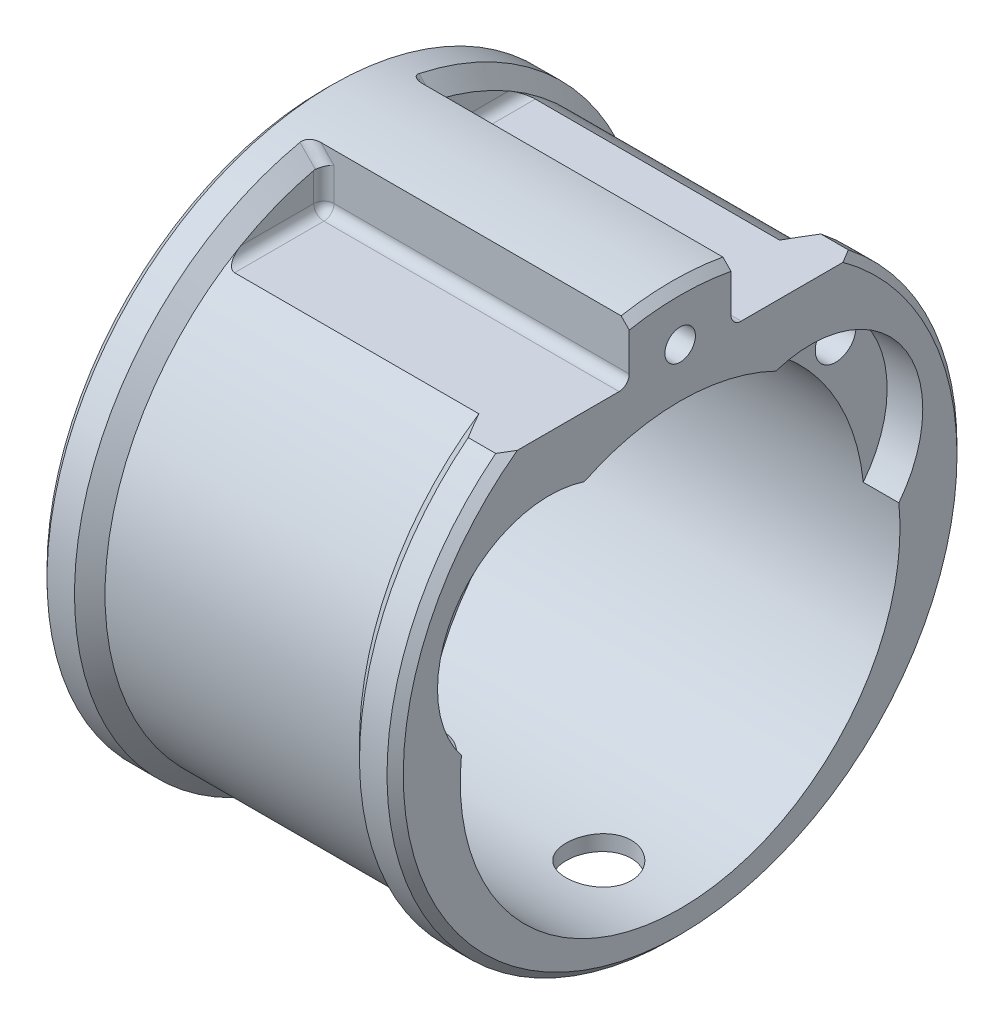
ISO-10303-21;
HEADER;
FILE_DESCRIPTION(('STEP AP214'),'2;1');
FILE_NAME('part.step','',(''),(''),'','','');
FILE_SCHEMA(('AUTOMOTIVE_DESIGN { 1 0 10303 214 1 1 1 1 }'));
ENDSEC;
DATA;
#1=APPLICATION_CONTEXT('core data for automotive mechanical design processes');
#2=APPLICATION_PROTOCOL_DEFINITION('international standard','automotive_design',2000,#1);
#3=PRODUCT_CONTEXT('',#1,'mechanical');
#4=PRODUCT('Part','Part','',(#3));
#5=PRODUCT_RELATED_PRODUCT_CATEGORY('part','',(#4));
#6=PRODUCT_DEFINITION_FORMATION('','',#4);
#7=PRODUCT_DEFINITION_CONTEXT('part definition',#1,'design');
#8=PRODUCT_DEFINITION('design','',#6,#7);
#9=PRODUCT_DEFINITION_SHAPE('','',#8);
#10=(LENGTH_UNIT() NAMED_UNIT(*) SI_UNIT(.MILLI.,.METRE.));
#11=(NAMED_UNIT(*) PLANE_ANGLE_UNIT() SI_UNIT($,.RADIAN.));
#12=(NAMED_UNIT(*) SI_UNIT($,.STERADIAN.) SOLID_ANGLE_UNIT());
#13=UNCERTAINTY_MEASURE_WITH_UNIT(LENGTH_MEASURE(1.E-05),#10,'distance_accuracy_value','');
#14=(GEOMETRIC_REPRESENTATION_CONTEXT(3) GLOBAL_UNCERTAINTY_ASSIGNED_CONTEXT((#13)) GLOBAL_UNIT_ASSIGNED_CONTEXT((#10,
#11,#12)) REPRESENTATION_CONTEXT('',''));
#15=CARTESIAN_POINT('',(0.,0.,0.));
#16=DIRECTION('',(0.,0.,1.));
#17=DIRECTION('',(1.,0.,0.));
#18=AXIS2_PLACEMENT_3D('',#15,#16,#17);
#19=CARTESIAN_POINT('',(-140.,0.,0.));
#20=DIRECTION('',(-1.,0.,0.));
#21=DIRECTION('',(0.,0.,1.));
#22=AXIS2_PLACEMENT_3D('',#19,#20,#21);
#23=CYLINDRICAL_SURFACE('',#22,28.);
#24=DIRECTION('',(-1.,0.,0.));
#25=VECTOR('',#24,1.);
#26=CARTESIAN_POINT('',(-140.,22.,-17.3205080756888));
#27=LINE('',#26,#25);
#28=CARTESIAN_POINT('',(-3.50000000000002,22.,-17.3205080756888));
#29=VERTEX_POINT('',#28);
#30=CARTESIAN_POINT('',(-0.800000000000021,22.,-17.3205080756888));
#31=VERTEX_POINT('',#30);
#32=EDGE_CURVE('E832',#29,#31,#27,.F.);
#33=ORIENTED_EDGE('',*,*,#32,.T.);
#34=CARTESIAN_POINT('',(-0.800000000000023,0.,0.));
#35=DIRECTION('',(-1.,0.,0.));
#36=DIRECTION('',(0.,0.,1.));
#37=AXIS2_PLACEMENT_3D('',#34,#35,#36);
#38=CIRCLE('',#37,28.);
#39=CARTESIAN_POINT('',(-0.800000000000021,22.,17.3205080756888));
#40=VERTEX_POINT('',#39);
#41=EDGE_CURVE('E620',#31,#40,#38,.T.);
#42=ORIENTED_EDGE('',*,*,#41,.T.);
#43=DIRECTION('',(-1.,0.,0.));
#44=VECTOR('',#43,1.);
#45=CARTESIAN_POINT('',(-140.,22.,17.3205080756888));
#46=LINE('',#45,#44);
#47=CARTESIAN_POINT('',(-3.50000000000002,22.,17.3205080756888));
#48=VERTEX_POINT('',#47);
#49=EDGE_CURVE('E809',#40,#48,#46,.T.);
#50=ORIENTED_EDGE('',*,*,#49,.T.);
#51=CARTESIAN_POINT('',(-3.5,0.,0.));
#52=DIRECTION('',(-1.,0.,0.));
#53=DIRECTION('',(0.,0.,1.));
#54=AXIS2_PLACEMENT_3D('',#51,#52,#53);
#55=CIRCLE('',#54,28.);
#56=EDGE_CURVE('E792',#29,#48,#55,.T.);
#57=ORIENTED_EDGE('',*,*,#56,.F.);
#58=EDGE_LOOP('',(#33,#42,#50,#57));
#59=FACE_BOUND('',#58,.T.);
#60=ADVANCED_FACE('F359',(#59),#23,.T.);
#61=CARTESIAN_POINT('',(-140.,0.,0.));
#62=DIRECTION('',(-1.,0.,0.));
#63=DIRECTION('',(0.,0.,1.));
#64=AXIS2_PLACEMENT_3D('',#61,#62,#63);
#65=CYLINDRICAL_SURFACE('',#64,26.5);
#66=CARTESIAN_POINT('',(-26.4880765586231,-26.3060829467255,3.2));
#67=CARTESIAN_POINT('',(-26.3090356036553,-26.3060854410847,3.19999235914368));
#68=CARTESIAN_POINT('',(-26.1298815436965,-26.3079305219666,3.1849232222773));
#69=CARTESIAN_POINT('',(-25.7765558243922,-26.3151090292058,3.12504574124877));
#70=CARTESIAN_POINT('',(-25.6023896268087,-26.3204461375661,3.08020600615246));
#71=CARTESIAN_POINT('',(-25.2642065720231,-26.3339955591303,2.96212546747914));
#72=CARTESIAN_POINT('',(-25.1001830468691,-26.3422059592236,2.88890355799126));
#73=CARTESIAN_POINT('',(-24.7867835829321,-26.3605745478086,2.71617689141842));
#74=CARTESIAN_POINT('',(-24.6374050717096,-26.3707323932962,2.61667676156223));
#75=CARTESIAN_POINT('',(-24.3567228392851,-26.3919108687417,2.39366014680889));
#76=CARTESIAN_POINT('',(-24.2255067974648,-26.4029353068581,2.27003366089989));
#77=CARTESIAN_POINT('',(-23.9856312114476,-26.424570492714,2.00251019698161));
#78=CARTESIAN_POINT('',(-23.8769727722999,-26.4351812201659,1.85861222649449));
#79=CARTESIAN_POINT('',(-23.684984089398,-26.4548322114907,1.55408160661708));
#80=CARTESIAN_POINT('',(-23.6017329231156,-26.4638675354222,1.3933987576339));
#81=CARTESIAN_POINT('',(-23.4634283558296,-26.4793078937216,1.06020583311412));
#82=CARTESIAN_POINT('',(-23.4083739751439,-26.4857130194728,0.887696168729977));
#83=CARTESIAN_POINT('',(-23.3282869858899,-26.4951444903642,0.536641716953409));
#84=CARTESIAN_POINT('',(-23.303108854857,-26.498187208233,0.358130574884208));
#85=CARTESIAN_POINT('',(-23.2830382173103,-26.5006069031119,-0.000607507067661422));
#86=CARTESIAN_POINT('',(-23.2881445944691,-26.4999840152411,-0.180834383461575));
#87=CARTESIAN_POINT('',(-23.3283811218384,-26.4951559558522,-0.536898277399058));
#88=CARTESIAN_POINT('',(-23.3633547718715,-26.4909694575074,-0.712753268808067));
#89=CARTESIAN_POINT('',(-23.4620885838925,-26.4795056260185,-1.05607951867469));
#90=CARTESIAN_POINT('',(-23.5258492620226,-26.4722282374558,-1.2235506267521));
#91=CARTESIAN_POINT('',(-23.6805145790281,-26.4553682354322,-1.54584134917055));
#92=CARTESIAN_POINT('',(-23.7714872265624,-26.4457798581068,-1.70062801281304));
#93=CARTESIAN_POINT('',(-23.9779446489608,-26.4253712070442,-1.99279655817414));
#94=CARTESIAN_POINT('',(-24.0934304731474,-26.4145508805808,-2.13017769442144));
#95=CARTESIAN_POINT('',(-24.3465132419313,-26.3928084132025,-2.38455436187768));
#96=CARTESIAN_POINT('',(-24.4842465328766,-26.3818860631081,-2.50141426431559));
#97=CARTESIAN_POINT('',(-24.7774453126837,-26.3612388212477,-2.71037789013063));
#98=CARTESIAN_POINT('',(-24.9329108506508,-26.3515139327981,-2.80248154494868));
#99=CARTESIAN_POINT('',(-25.2572787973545,-26.3343626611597,-2.95932438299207));
#100=CARTESIAN_POINT('',(-25.4261862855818,-26.3269371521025,-3.02405316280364));
#101=CARTESIAN_POINT('',(-25.7725827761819,-26.3152426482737,-3.12419097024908));
#102=CARTESIAN_POINT('',(-25.9500713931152,-26.310973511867,-3.15960131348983));
#103=CARTESIAN_POINT('',(-26.3073953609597,-26.3061007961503,-3.19991841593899));
#104=CARTESIAN_POINT('',(-26.4872088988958,-26.3054743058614,-3.20501583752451));
#105=CARTESIAN_POINT('',(-26.84512741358,-26.3078972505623,-3.18506503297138));
#106=CARTESIAN_POINT('',(-27.023232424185,-26.3109466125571,-3.16001740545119));
#107=CARTESIAN_POINT('',(-27.3721096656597,-26.3203567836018,-3.08064786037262));
#108=CARTESIAN_POINT('',(-27.542903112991,-26.3267071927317,-3.02641786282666));
#109=CARTESIAN_POINT('',(-27.8729719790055,-26.341995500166,-2.89031744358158));
#110=CARTESIAN_POINT('',(-28.032247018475,-26.3509334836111,-2.80844611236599));
#111=CARTESIAN_POINT('',(-28.335621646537,-26.3704448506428,-2.61891663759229));
#112=CARTESIAN_POINT('',(-28.4796424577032,-26.3810260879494,-2.51113321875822));
#113=CARTESIAN_POINT('',(-28.7476175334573,-26.4026068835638,-2.27301668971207));
#114=CARTESIAN_POINT('',(-28.8715710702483,-26.4136064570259,-2.14268276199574));
#115=CARTESIAN_POINT('',(-29.0965605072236,-26.4348547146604,-1.86233308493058));
#116=CARTESIAN_POINT('',(-29.1974712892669,-26.4450991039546,-1.71221655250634));
#117=CARTESIAN_POINT('',(-29.3726458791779,-26.4636188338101,-1.3970544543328));
#118=CARTESIAN_POINT('',(-29.4469101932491,-26.4718942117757,-1.23200917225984));
#119=CARTESIAN_POINT('',(-29.5664761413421,-26.4855243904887,-0.892094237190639));
#120=CARTESIAN_POINT('',(-29.6118506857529,-26.4908865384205,-0.717250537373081));
#121=CARTESIAN_POINT('',(-29.6725864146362,-26.498116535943,-0.36235734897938));
#122=CARTESIAN_POINT('',(-29.687948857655,-26.4999845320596,-0.182308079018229));
#123=CARTESIAN_POINT('',(-29.6882018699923,-26.5000151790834,0.176662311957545));
#124=CARTESIAN_POINT('',(-29.6732856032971,-26.4982013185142,0.35558332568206));
#125=CARTESIAN_POINT('',(-29.6138129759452,-26.4911186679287,0.708356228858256));
#126=CARTESIAN_POINT('',(-29.5692566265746,-26.485849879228,0.882208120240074));
#127=CARTESIAN_POINT('',(-29.4518280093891,-26.4724468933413,1.21988677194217));
#128=CARTESIAN_POINT('',(-29.378964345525,-26.4643135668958,1.38371656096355));
#129=CARTESIAN_POINT('',(-29.2070094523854,-26.4460832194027,1.69685350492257));
#130=CARTESIAN_POINT('',(-29.1079179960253,-26.4359861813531,1.84616053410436));
#131=CARTESIAN_POINT('',(-28.8856035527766,-26.4148793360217,2.12700133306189));
#132=CARTESIAN_POINT('',(-28.7622367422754,-26.4038643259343,2.25842086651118));
#133=CARTESIAN_POINT('',(-28.49517059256,-26.3822052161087,2.49876972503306));
#134=CARTESIAN_POINT('',(-28.3514664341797,-26.3715612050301,2.60769370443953));
#135=CARTESIAN_POINT('',(-28.0472137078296,-26.3518082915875,2.80029198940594));
#136=CARTESIAN_POINT('',(-27.8866062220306,-26.3427050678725,2.88387375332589));
#137=CARTESIAN_POINT('',(-27.5536173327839,-26.327131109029,3.02276293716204));
#138=CARTESIAN_POINT('',(-27.3812490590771,-26.3206574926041,3.07810132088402));
#139=CARTESIAN_POINT('',(-27.0879897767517,-26.3126588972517,3.14558149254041));
#140=CARTESIAN_POINT('',(-26.9689535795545,-26.3102050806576,3.16595936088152));
#141=CARTESIAN_POINT('',(-26.7293208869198,-26.3069162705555,3.19317114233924));
#142=CARTESIAN_POINT('',(-26.6087244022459,-26.3060812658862,3.20000514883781));
#143=CARTESIAN_POINT('',(-26.4880765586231,-26.3060829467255,3.2));
#144=B_SPLINE_CURVE_WITH_KNOTS('',3,(#66,#67,#68,#69,#70,#71,#72,#73,#74,#75,#76,#77,#78,#79,
#80,#81,#82,#83,#84,#85,#86,#87,#88,#89,#90,#91,#92,#93,#94,#95,#96,#97,#98,#99,#100,#101,#102,
#103,#104,#105,#106,#107,#108,#109,#110,#111,#112,#113,#114,#115,#116,#117,#118,#119,#120,#121,
#122,#123,#124,#125,#126,#127,#128,#129,#130,#131,#132,#133,#134,#135,#136,#137,#138,#139,#140,
#141,#142,#143),.UNSPECIFIED.,.T.,.F.,(4,2,2,2,2,2,2,2,2,2,2,2,2,2,2,2,2,2,2,2,2,2,2,2,2,2,2,2,
2,2,2,2,2,2,2,2,2,2,4),(0.,0.53668214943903,1.07393109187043,1.6108229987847,2.14762042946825,
2.68692504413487,3.22625607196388,3.76724898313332,4.30822309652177,4.84655125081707,
5.38485956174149,5.92036440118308,6.45587884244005,6.99274299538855,7.52963013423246,
8.06994204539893,8.61025545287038,9.15077401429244,9.69126831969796,10.2283593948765,
10.765439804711,11.3008383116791,11.8362544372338,12.3743130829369,12.912391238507,
13.4533250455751,13.9942485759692,14.5338014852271,15.0733317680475,15.6094309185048,
16.1455298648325,16.6814659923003,17.2174067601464,17.7566239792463,18.295969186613,
18.83726082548,19.3779577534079,19.7396067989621,20.1012533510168),.UNSPECIFIED.);
#145=CARTESIAN_POINT('',(-26.4880765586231,-26.3060829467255,3.2));
#146=VERTEX_POINT('',#145);
#147=EDGE_CURVE('E728',#146,#146,#144,.T.);
#148=ORIENTED_EDGE('',*,*,#147,.T.);
#149=EDGE_LOOP('',(#148));
#150=FACE_BOUND('',#149,.T.);
#151=CARTESIAN_POINT('',(-5.,0.,0.));
#152=DIRECTION('',(1.,0.,0.));
#153=DIRECTION('',(0.,0.,-1.));
#154=AXIS2_PLACEMENT_3D('',#151,#152,#153);
#155=CIRCLE('',#154,26.5);
#156=CARTESIAN_POINT('',(-5.,22.,-14.7732867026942));
#157=VERTEX_POINT('',#156);
#158=CARTESIAN_POINT('',(-5.,-26.4759040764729,-1.12982447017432));
#159=VERTEX_POINT('',#158);
#160=EDGE_CURVE('E565',#157,#159,#155,.F.);
#161=ORIENTED_EDGE('',*,*,#160,.T.);
#162=CARTESIAN_POINT('',(-7.99390992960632,-26.3060829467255,3.2));
#163=CARTESIAN_POINT('',(-7.81486897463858,-26.3060854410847,3.19999235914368));
#164=CARTESIAN_POINT('',(-7.63571491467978,-26.3079305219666,3.1849232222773));
#165=CARTESIAN_POINT('',(-7.28238919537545,-26.3151090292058,3.12504574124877));
#166=CARTESIAN_POINT('',(-7.10822299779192,-26.3204461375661,3.08020600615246));
#167=CARTESIAN_POINT('',(-6.77003994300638,-26.3339955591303,2.96212546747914));
#168=CARTESIAN_POINT('',(-6.60601641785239,-26.3422059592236,2.88890355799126));
#169=CARTESIAN_POINT('',(-6.29261695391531,-26.3605745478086,2.71617689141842));
#170=CARTESIAN_POINT('',(-6.14323844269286,-26.3707323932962,2.61667676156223));
#171=CARTESIAN_POINT('',(-5.8625562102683,-26.3919108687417,2.39366014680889));
#172=CARTESIAN_POINT('',(-5.73134016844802,-26.4029353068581,2.27003366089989));
#173=CARTESIAN_POINT('',(-5.4914645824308,-26.424570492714,2.0025101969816));
#174=CARTESIAN_POINT('',(-5.38280614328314,-26.4351812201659,1.85861222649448));
#175=CARTESIAN_POINT('',(-5.19081746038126,-26.4548322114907,1.55408160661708));
#176=CARTESIAN_POINT('',(-5.10756629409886,-26.4638675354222,1.3933987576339));
#177=CARTESIAN_POINT('',(-4.96926172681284,-26.4793078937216,1.06020583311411));
#178=CARTESIAN_POINT('',(-4.91420734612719,-26.4857130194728,0.887696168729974));
#179=CARTESIAN_POINT('',(-4.83412035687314,-26.4951444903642,0.536641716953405));
#180=CARTESIAN_POINT('',(-4.80894222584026,-26.498187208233,0.358130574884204));
#181=CARTESIAN_POINT('',(-4.78887158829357,-26.5006069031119,-0.000607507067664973));
#182=CARTESIAN_POINT('',(-4.79397796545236,-26.4999840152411,-0.180834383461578));
#183=CARTESIAN_POINT('',(-4.83421449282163,-26.4951559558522,-0.536898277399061));
#184=CARTESIAN_POINT('',(-4.8691881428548,-26.4909694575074,-0.71275326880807));
#185=CARTESIAN_POINT('',(-4.96792195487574,-26.4795056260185,-1.0560795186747));
#186=CARTESIAN_POINT('',(-5.0316826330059,-26.4722282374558,-1.2235506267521));
#187=CARTESIAN_POINT('',(-5.18634795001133,-26.4553682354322,-1.54584134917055));
#188=CARTESIAN_POINT('',(-5.27732059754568,-26.4457798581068,-1.70062801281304));
#189=CARTESIAN_POINT('',(-5.48377801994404,-26.4253712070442,-1.99279655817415));
#190=CARTESIAN_POINT('',(-5.59926384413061,-26.4145508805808,-2.13017769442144));
#191=CARTESIAN_POINT('',(-5.85234661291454,-26.3928084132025,-2.38455436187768));
#192=CARTESIAN_POINT('',(-5.99007990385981,-26.3818860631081,-2.50141426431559));
#193=CARTESIAN_POINT('',(-6.28327868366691,-26.3612388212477,-2.71037789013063));
#194=CARTESIAN_POINT('',(-6.43874422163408,-26.3515139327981,-2.80248154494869));
#195=CARTESIAN_POINT('',(-6.76311216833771,-26.3343626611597,-2.95932438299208));
#196=CARTESIAN_POINT('',(-6.93201965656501,-26.3269371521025,-3.02405316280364));
#197=CARTESIAN_POINT('',(-7.27841614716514,-26.3152426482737,-3.12419097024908));
#198=CARTESIAN_POINT('',(-7.45590476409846,-26.310973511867,-3.15960131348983));
#199=CARTESIAN_POINT('',(-7.81322873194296,-26.3061007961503,-3.19991841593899));
#200=CARTESIAN_POINT('',(-7.9930422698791,-26.3054743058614,-3.20501583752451));
#201=CARTESIAN_POINT('',(-8.35096078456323,-26.3078972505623,-3.18506503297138));
#202=CARTESIAN_POINT('',(-8.52906579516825,-26.3109466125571,-3.16001740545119));
#203=CARTESIAN_POINT('',(-8.87794303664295,-26.3203567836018,-3.08064786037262));
#204=CARTESIAN_POINT('',(-9.04873648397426,-26.3267071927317,-3.02641786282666));
#205=CARTESIAN_POINT('',(-9.37880534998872,-26.341995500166,-2.89031744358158));
#206=CARTESIAN_POINT('',(-9.53808038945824,-26.3509334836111,-2.80844611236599));
#207=CARTESIAN_POINT('',(-9.84145501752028,-26.3704448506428,-2.61891663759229));
#208=CARTESIAN_POINT('',(-9.98547582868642,-26.3810260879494,-2.51113321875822));
#209=CARTESIAN_POINT('',(-10.2534509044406,-26.4026068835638,-2.27301668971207));
#210=CARTESIAN_POINT('',(-10.3774044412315,-26.4136064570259,-2.14268276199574));
#211=CARTESIAN_POINT('',(-10.6023938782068,-26.4348547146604,-1.86233308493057));
#212=CARTESIAN_POINT('',(-10.7033046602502,-26.4450991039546,-1.71221655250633));
#213=CARTESIAN_POINT('',(-10.8784792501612,-26.4636188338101,-1.3970544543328));
#214=CARTESIAN_POINT('',(-10.9527435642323,-26.4718942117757,-1.23200917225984));
#215=CARTESIAN_POINT('',(-11.0723095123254,-26.4855243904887,-0.892094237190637));
#216=CARTESIAN_POINT('',(-11.1176840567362,-26.4908865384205,-0.717250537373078));
#217=CARTESIAN_POINT('',(-11.1784197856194,-26.498116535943,-0.362357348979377));
#218=CARTESIAN_POINT('',(-11.1937822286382,-26.4999845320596,-0.182308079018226));
#219=CARTESIAN_POINT('',(-11.1940352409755,-26.5000151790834,0.176662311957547));
#220=CARTESIAN_POINT('',(-11.1791189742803,-26.4982013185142,0.355583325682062));
#221=CARTESIAN_POINT('',(-11.1196463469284,-26.4911186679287,0.708356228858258));
#222=CARTESIAN_POINT('',(-11.0750899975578,-26.485849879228,0.882208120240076));
#223=CARTESIAN_POINT('',(-10.9576613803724,-26.4724468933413,1.21988677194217));
#224=CARTESIAN_POINT('',(-10.8847977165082,-26.4643135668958,1.38371656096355));
#225=CARTESIAN_POINT('',(-10.7128428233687,-26.4460832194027,1.69685350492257));
#226=CARTESIAN_POINT('',(-10.6137513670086,-26.4359861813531,1.84616053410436));
#227=CARTESIAN_POINT('',(-10.3914369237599,-26.4148793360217,2.12700133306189));
#228=CARTESIAN_POINT('',(-10.2680701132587,-26.4038643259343,2.25842086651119));
#229=CARTESIAN_POINT('',(-10.0010039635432,-26.3822052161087,2.49876972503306));
#230=CARTESIAN_POINT('',(-9.85729980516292,-26.3715612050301,2.60769370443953));
#231=CARTESIAN_POINT('',(-9.55304707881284,-26.3518082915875,2.80029198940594));
#232=CARTESIAN_POINT('',(-9.3924395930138,-26.3427050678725,2.88387375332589));
#233=CARTESIAN_POINT('',(-9.05945070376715,-26.327131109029,3.02276293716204));
#234=CARTESIAN_POINT('',(-8.8870824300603,-26.3206574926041,3.07810132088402));
#235=CARTESIAN_POINT('',(-8.59382314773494,-26.3126588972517,3.14558149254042));
#236=CARTESIAN_POINT('',(-8.47478695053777,-26.3102050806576,3.16595936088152));
#237=CARTESIAN_POINT('',(-8.23515425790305,-26.3069162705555,3.19317114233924));
#238=CARTESIAN_POINT('',(-8.11455777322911,-26.3060812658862,3.20000514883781));
#239=CARTESIAN_POINT('',(-7.99390992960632,-26.3060829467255,3.2));
#240=B_SPLINE_CURVE_WITH_KNOTS('',3,(#162,#163,#164,#165,#166,#167,#168,#169,#170,#171,#172,
#173,#174,#175,#176,#177,#178,#179,#180,#181,#182,#183,#184,#185,#186,#187,#188,#189,#190,#191,
#192,#193,#194,#195,#196,#197,#198,#199,#200,#201,#202,#203,#204,#205,#206,#207,#208,#209,#210,
#211,#212,#213,#214,#215,#216,#217,#218,#219,#220,#221,#222,#223,#224,#225,#226,#227,#228,#229,
#230,#231,#232,#233,#234,#235,#236,#237,#238,#239),.UNSPECIFIED.,.T.,.F.,(4,2,2,2,2,2,2,2,2,2,2,
2,2,2,2,2,2,2,2,2,2,2,2,2,2,2,2,2,2,2,2,2,2,2,2,2,2,2,4),(0.,0.536682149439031,1.07393109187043,
1.6108229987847,2.14762042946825,2.68692504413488,3.22625607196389,3.76724898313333,
4.30822309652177,4.84655125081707,5.38485956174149,5.92036440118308,6.45587884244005,
6.99274299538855,7.52963013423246,8.06994204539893,8.61025545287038,9.15077401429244,
9.69126831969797,10.2283593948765,10.765439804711,11.3008383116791,11.8362544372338,
12.3743130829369,12.912391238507,13.4533250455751,13.9942485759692,14.5338014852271,
15.0733317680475,15.6094309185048,16.1455298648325,16.6814659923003,17.2174067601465,
17.7566239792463,18.295969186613,18.83726082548,19.3779577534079,19.7396067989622,
20.1012533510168),.UNSPECIFIED.);
#241=CARTESIAN_POINT('',(-5.,-26.4759040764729,1.12982447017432));
#242=VERTEX_POINT('',#241);
#243=EDGE_CURVE('E380',#159,#242,#240,.T.);
#244=ORIENTED_EDGE('',*,*,#243,.T.);
#245=CARTESIAN_POINT('',(-5.00000000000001,22.,14.7732867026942));
#246=VERTEX_POINT('',#245);
#247=EDGE_CURVE('E563',#242,#246,#155,.F.);
#248=ORIENTED_EDGE('',*,*,#247,.T.);
#249=DIRECTION('',(-1.,0.,0.));
#250=VECTOR('',#249,1.);
#251=CARTESIAN_POINT('',(-140.,22.,14.7732867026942));
#252=LINE('',#251,#250);
#253=CARTESIAN_POINT('',(-29.,22.,14.7732867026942));
#254=VERTEX_POINT('',#253);
#255=EDGE_CURVE('E806',#246,#254,#252,.T.);
#256=ORIENTED_EDGE('',*,*,#255,.T.);
#257=CARTESIAN_POINT('',(-29.,22.,14.7732867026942));
#258=CARTESIAN_POINT('',(-29.0197443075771,21.999995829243,14.7732925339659));
#259=CARTESIAN_POINT('',(-29.0394728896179,22.0005853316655,14.7724150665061));
#260=CARTESIAN_POINT('',(-29.0786840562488,22.0029079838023,14.7689555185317));
#261=CARTESIAN_POINT('',(-29.0981669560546,22.0046394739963,14.7663759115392));
#262=CARTESIAN_POINT('',(-29.1554721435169,22.0114202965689,14.7562679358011));
#263=CARTESIAN_POINT('',(-29.1927134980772,22.0180586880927,14.7463665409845));
#264=CARTESIAN_POINT('',(-29.264201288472,22.0348335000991,14.7212884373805));
#265=CARTESIAN_POINT('',(-29.2984627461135,22.044950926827,14.7061403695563));
#266=CARTESIAN_POINT('',(-29.3639202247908,22.0679219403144,14.6716479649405));
#267=CARTESIAN_POINT('',(-29.395104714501,22.0807852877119,14.6522886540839));
#268=CARTESIAN_POINT('',(-29.4714312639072,22.1165834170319,14.5982292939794));
#269=CARTESIAN_POINT('',(-29.514163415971,22.1410291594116,14.5611488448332));
#270=CARTESIAN_POINT('',(-29.5923606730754,22.1929562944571,14.4818836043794));
#271=CARTESIAN_POINT('',(-29.6278107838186,22.2204437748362,14.4396885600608));
#272=CARTESIAN_POINT('',(-29.6878602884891,22.2732203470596,14.358122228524));
#273=CARTESIAN_POINT('',(-29.7132850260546,22.298271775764,14.3191935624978));
#274=CARTESIAN_POINT('',(-29.7600791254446,22.3492497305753,14.2394972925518));
#275=CARTESIAN_POINT('',(-29.7814454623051,22.3751768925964,14.1987283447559));
#276=CARTESIAN_POINT('',(-29.8403345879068,22.4539548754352,14.0740737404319));
#277=CARTESIAN_POINT('',(-29.8724503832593,22.5076169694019,13.9881258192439));
#278=CARTESIAN_POINT('',(-29.9167941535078,22.5985341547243,13.8405665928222));
#279=CARTESIAN_POINT('',(-29.9321007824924,22.6356777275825,13.779740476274));
#280=CARTESIAN_POINT('',(-29.9578188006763,22.7099493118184,13.6569887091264));
#281=CARTESIAN_POINT('',(-29.9682271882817,22.7470772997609,13.5950624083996));
#282=CARTESIAN_POINT('',(-29.9844509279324,22.8204316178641,13.4715615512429));
#283=CARTESIAN_POINT('',(-29.9903423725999,22.8566624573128,13.4099993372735));
#284=CARTESIAN_POINT('',(-29.9981050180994,22.9286819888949,13.2864842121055));
#285=CARTESIAN_POINT('',(-29.999982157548,22.9644712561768,13.2245320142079));
#286=CARTESIAN_POINT('',(-30.,23.,13.1624465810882));
#287=B_SPLINE_CURVE_WITH_KNOTS('',3,(#257,#258,#259,#260,#261,#262,#263,#264,#265,#266,#267,
#268,#269,#270,#271,#272,#273,#274,#275,#276,#277,#278,#279,#280,#281,#282,#283,#284,#285,#286),
.UNSPECIFIED.,.F.,.F.,(4,2,2,2,2,2,2,2,2,2,2,2,2,2,4),(0.,0.0591757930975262,0.118265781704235,
0.23479028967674,0.350688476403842,0.467005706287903,0.650864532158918,0.835098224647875,
0.993316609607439,1.15165246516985,1.46949158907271,1.6880381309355,1.90671842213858,
2.1216285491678,2.33622052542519),.UNSPECIFIED.);
#288=CARTESIAN_POINT('',(-30.,23.,13.1624465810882));
#289=VERTEX_POINT('',#288);
#290=EDGE_CURVE('E720',#254,#289,#287,.T.);
#291=ORIENTED_EDGE('',*,*,#290,.T.);
#292=CARTESIAN_POINT('',(-30.,0.,0.));
#293=DIRECTION('',(-1.,0.,0.));
#294=DIRECTION('',(0.,0.,1.));
#295=AXIS2_PLACEMENT_3D('',#292,#293,#294);
#296=CIRCLE('',#295,26.5);
#297=CARTESIAN_POINT('',(-30.,23.,-13.1624465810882));
#298=VERTEX_POINT('',#297);
#299=EDGE_CURVE('E577',#289,#298,#296,.F.);
#300=ORIENTED_EDGE('',*,*,#299,.T.);
#301=CARTESIAN_POINT('',(-30.,23.,-13.1624465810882));
#302=CARTESIAN_POINT('',(-29.9999649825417,22.9582540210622,-13.2353992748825));
#303=CARTESIAN_POINT('',(-29.9973821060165,22.9161377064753,-13.308182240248));
#304=CARTESIAN_POINT('',(-29.986602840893,22.8312680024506,-13.4532614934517));
#305=CARTESIAN_POINT('',(-29.978388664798,22.7885130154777,-13.5255555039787));
#306=CARTESIAN_POINT('',(-29.9557534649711,22.702473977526,-13.6694826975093));
#307=CARTESIAN_POINT('',(-29.9412946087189,22.65918828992,-13.7411090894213));
#308=CARTESIAN_POINT('',(-29.9053613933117,22.5727872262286,-13.8825834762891));
#309=CARTESIAN_POINT('',(-29.8838974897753,22.5296716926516,-13.9524339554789));
#310=CARTESIAN_POINT('',(-29.8388169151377,22.4542601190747,-14.0733798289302));
#311=CARTESIAN_POINT('',(-29.8169033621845,22.4218117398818,-14.1250114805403));
#312=CARTESIAN_POINT('',(-29.7675762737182,22.3577685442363,-14.2261646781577));
#313=CARTESIAN_POINT('',(-29.7401639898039,22.3261735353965,-14.2756867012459));
#314=CARTESIAN_POINT('',(-29.6786804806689,22.2642589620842,-14.3720589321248));
#315=CARTESIAN_POINT('',(-29.6445579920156,22.2339515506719,-14.4188847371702));
#316=CARTESIAN_POINT('',(-29.5686388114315,22.1760316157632,-14.507805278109));
#317=CARTESIAN_POINT('',(-29.5268570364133,22.1484140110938,-14.5499089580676));
#318=CARTESIAN_POINT('',(-29.4517982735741,22.1072735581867,-14.6122994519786));
#319=CARTESIAN_POINT('',(-29.4211898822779,22.0923437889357,-14.634854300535));
#320=CARTESIAN_POINT('',(-29.3563805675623,22.0649993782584,-14.6760488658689));
#321=CARTESIAN_POINT('',(-29.322182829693,22.0525825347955,-14.6946920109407));
#322=CARTESIAN_POINT('',(-29.2557625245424,22.0327347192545,-14.7244311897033));
#323=CARTESIAN_POINT('',(-29.224001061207,22.0248371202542,-14.7362369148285));
#324=CARTESIAN_POINT('',(-29.1585713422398,22.012094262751,-14.7552648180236));
#325=CARTESIAN_POINT('',(-29.1249078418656,22.0072417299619,-14.762497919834));
#326=CARTESIAN_POINT('',(-29.0757705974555,22.0027600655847,-14.7691758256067));
#327=CARTESIAN_POINT('',(-29.060681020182,22.001727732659,-14.7707135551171));
#328=CARTESIAN_POINT('',(-29.0303970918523,22.000347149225,-14.7727697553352));
#329=CARTESIAN_POINT('',(-29.015202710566,21.9999991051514,-14.7732879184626));
#330=CARTESIAN_POINT('',(-29.0000000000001,21.9999999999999,-14.7732867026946));
#331=B_SPLINE_CURVE_WITH_KNOTS('',3,(#301,#302,#303,#304,#305,#306,#307,#308,#309,#310,#311,
#312,#313,#314,#315,#316,#317,#318,#319,#320,#321,#322,#323,#324,#325,#326,#327,#328,#329,#330),
.UNSPECIFIED.,.F.,.F.,(4,2,2,2,2,2,2,2,2,2,2,2,2,2,4),(0.,0.252174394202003,0.50514902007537,
0.759678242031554,1.01382928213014,1.20800871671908,1.40214400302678,1.5978244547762,
1.79312777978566,1.91534372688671,2.03745210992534,2.14142322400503,2.24514500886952,
2.29071062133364,2.33628997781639),.UNSPECIFIED.);
#332=CARTESIAN_POINT('',(-29.,22.,-14.7732867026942));
#333=VERTEX_POINT('',#332);
#334=EDGE_CURVE('E693',#298,#333,#331,.T.);
#335=ORIENTED_EDGE('',*,*,#334,.T.);
#336=DIRECTION('',(-1.,0.,0.));
#337=VECTOR('',#336,1.);
#338=CARTESIAN_POINT('',(-140.,22.,-14.7732867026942));
#339=LINE('',#338,#337);
#340=EDGE_CURVE('E1056',#333,#157,#339,.F.);
#341=ORIENTED_EDGE('',*,*,#340,.T.);
#342=EDGE_LOOP('',(#161,#244,#248,#256,#291,#300,#335,#341));
#343=FACE_BOUND('',#342,.T.);
#344=ADVANCED_FACE('F561',(#150,#343),#65,.T.);
#345=CARTESIAN_POINT('',(0.,28.,0.));
#346=DIRECTION('',(-1.,0.,0.));
#347=DIRECTION('',(0.,0.,1.));
#348=AXIS2_PLACEMENT_3D('',#345,#346,#347);
#349=PLANE('',#348);
#350=CARTESIAN_POINT('',(0.,23.,0.));
#351=DIRECTION('',(1.,0.,0.));
#352=DIRECTION('',(0.,0.,-1.));
#353=AXIS2_PLACEMENT_3D('',#350,#351,#352);
#354=CIRCLE('',#353,1.5);
#355=CARTESIAN_POINT('',(0.,23.,-1.5));
#356=VERTEX_POINT('',#355);
#357=EDGE_CURVE('E1005',#356,#356,#354,.T.);
#358=ORIENTED_EDGE('',*,*,#357,.F.);
#359=EDGE_LOOP('',(#358));
#360=FACE_BOUND('',#359,.T.);
#361=DIRECTION('',(0.,-1.,0.));
#362=VECTOR('',#361,1.);
#363=CARTESIAN_POINT('',(0.,32.,-5.));
#364=LINE('',#363,#362);
#365=CARTESIAN_POINT('',(0.,26.73649191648,-5.));
#366=VERTEX_POINT('',#365);
#367=CARTESIAN_POINT('',(0.,23.,-5.));
#368=VERTEX_POINT('',#367);
#369=EDGE_CURVE('E1029',#366,#368,#364,.T.);
#370=ORIENTED_EDGE('',*,*,#369,.F.);
#371=CARTESIAN_POINT('',(0.,0.,0.));
#372=DIRECTION('',(-1.,0.,0.));
#373=DIRECTION('',(0.,0.,1.));
#374=AXIS2_PLACEMENT_3D('',#371,#372,#373);
#375=CIRCLE('',#374,27.2);
#376=CARTESIAN_POINT('',(0.,26.73649191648,5.));
#377=VERTEX_POINT('',#376);
#378=EDGE_CURVE('E621',#366,#377,#375,.F.);
#379=ORIENTED_EDGE('',*,*,#378,.T.);
#380=DIRECTION('',(0.,1.,0.));
#381=VECTOR('',#380,1.);
#382=CARTESIAN_POINT('',(0.,32.,5.));
#383=LINE('',#382,#381);
#384=CARTESIAN_POINT('',(0.,23.,5.));
#385=VERTEX_POINT('',#384);
#386=EDGE_CURVE('E815',#385,#377,#383,.T.);
#387=ORIENTED_EDGE('',*,*,#386,.F.);
#388=CARTESIAN_POINT('',(0.,23.,6.));
#389=DIRECTION('',(-1.,0.,0.));
#390=DIRECTION('',(0.,0.,1.));
#391=AXIS2_PLACEMENT_3D('',#388,#389,#390);
#392=CIRCLE('',#391,1.);
#393=CARTESIAN_POINT('',(0.,22.,6.));
#394=VERTEX_POINT('',#393);
#395=EDGE_CURVE('E887',#385,#394,#392,.T.);
#396=ORIENTED_EDGE('',*,*,#395,.T.);
#397=DIRECTION('',(0.,0.,-1.));
#398=VECTOR('',#397,1.);
#399=CARTESIAN_POINT('',(0.,22.,30.));
#400=LINE('',#399,#398);
#401=CARTESIAN_POINT('',(0.,22.,15.9949992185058));
#402=VERTEX_POINT('',#401);
#403=EDGE_CURVE('E1049',#402,#394,#400,.T.);
#404=ORIENTED_EDGE('',*,*,#403,.F.);
#405=CARTESIAN_POINT('',(0.,0.,0.));
#406=DIRECTION('',(-1.,0.,0.));
#407=DIRECTION('',(0.,0.,1.));
#408=AXIS2_PLACEMENT_3D('',#405,#406,#407);
#409=CIRCLE('',#408,27.2);
#410=CARTESIAN_POINT('',(0.,22.,-15.9949992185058));
#411=VERTEX_POINT('',#410);
#412=EDGE_CURVE('E596',#402,#411,#409,.F.);
#413=ORIENTED_EDGE('',*,*,#412,.T.);
#414=DIRECTION('',(0.,0.,-1.));
#415=VECTOR('',#414,1.);
#416=CARTESIAN_POINT('',(0.,22.,-30.));
#417=LINE('',#416,#415);
#418=CARTESIAN_POINT('',(0.,22.,-6.));
#419=VERTEX_POINT('',#418);
#420=EDGE_CURVE('E1031',#419,#411,#417,.T.);
#421=ORIENTED_EDGE('',*,*,#420,.F.);
#422=CARTESIAN_POINT('',(0.,23.,-6.));
#423=DIRECTION('',(-1.,0.,0.));
#424=DIRECTION('',(0.,0.,1.));
#425=AXIS2_PLACEMENT_3D('',#422,#423,#424);
#426=CIRCLE('',#425,1.);
#427=EDGE_CURVE('E891',#419,#368,#426,.T.);
#428=ORIENTED_EDGE('',*,*,#427,.T.);
#429=EDGE_LOOP('',(#370,#379,#387,#396,#404,#413,#421,#428));
#430=FACE_BOUND('',#429,.T.);
#431=CARTESIAN_POINT('',(0.,-3.4,0.));
#432=DIRECTION('',(1.,0.,0.));
#433=DIRECTION('',(0.,0.,-1.));
#434=AXIS2_PLACEMENT_3D('',#431,#432,#433);
#435=CIRCLE('',#434,21.6);
#436=CARTESIAN_POINT('',(0.,-1.20498292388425,21.4881804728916));
#437=VERTEX_POINT('',#436);
#438=CARTESIAN_POINT('',(0.,-1.20498292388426,-21.4881804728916));
#439=VERTEX_POINT('',#438);
#440=EDGE_CURVE('E802',#437,#439,#435,.T.);
#441=ORIENTED_EDGE('',*,*,#440,.F.);
#442=CARTESIAN_POINT('',(0.,5.58813319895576,12.8363845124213));
#443=DIRECTION('',(1.,0.,0.));
#444=DIRECTION('',(0.,0.,1.));
#445=AXIS2_PLACEMENT_3D('',#442,#443,#444);
#446=CIRCLE('',#445,11.);
#447=CARTESIAN_POINT('',(0.,16.0415445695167,9.41203191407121));
#448=VERTEX_POINT('',#447);
#449=EDGE_CURVE('E994',#448,#437,#446,.T.);
#450=ORIENTED_EDGE('',*,*,#449,.F.);
#451=CARTESIAN_POINT('',(0.,16.0415445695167,-9.4120319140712));
#452=VERTEX_POINT('',#451);
#453=EDGE_CURVE('E799',#452,#448,#435,.T.);
#454=ORIENTED_EDGE('',*,*,#453,.F.);
#455=CARTESIAN_POINT('',(0.,5.58813319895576,-12.8363845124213));
#456=DIRECTION('',(1.,0.,0.));
#457=DIRECTION('',(0.,0.,-1.));
#458=AXIS2_PLACEMENT_3D('',#455,#456,#457);
#459=CIRCLE('',#458,11.);
#460=EDGE_CURVE('E999',#439,#452,#459,.T.);
#461=ORIENTED_EDGE('',*,*,#460,.F.);
#462=EDGE_LOOP('',(#441,#450,#454,#461));
#463=FACE_BOUND('',#462,.T.);
#464=ADVANCED_FACE('F713',(#360,#430,#463),#349,.F.);
#465=CARTESIAN_POINT('',(-35.,28.,0.));
#466=DIRECTION('',(1.,0.,0.));
#467=DIRECTION('',(0.,0.,-1.));
#468=AXIS2_PLACEMENT_3D('',#465,#466,#467);
#469=PLANE('',#468);
#470=CARTESIAN_POINT('',(-35.,23.,0.));
#471=DIRECTION('',(1.,0.,0.));
#472=DIRECTION('',(0.,0.,-1.));
#473=AXIS2_PLACEMENT_3D('',#470,#471,#472);
#474=CIRCLE('',#473,1.5);
#475=CARTESIAN_POINT('',(-35.,23.,-1.5));
#476=VERTEX_POINT('',#475);
#477=EDGE_CURVE('E1007',#476,#476,#474,.T.);
#478=ORIENTED_EDGE('',*,*,#477,.T.);
#479=EDGE_LOOP('',(#478));
#480=FACE_BOUND('',#479,.T.);
#481=CARTESIAN_POINT('',(-35.,0.,0.));
#482=DIRECTION('',(1.,0.,0.));
#483=DIRECTION('',(0.,0.,-1.));
#484=AXIS2_PLACEMENT_3D('',#481,#482,#483);
#485=CIRCLE('',#484,27.2);
#486=CARTESIAN_POINT('',(-35.,0.,-27.2));
#487=VERTEX_POINT('',#486);
#488=EDGE_CURVE('E575',#487,#487,#485,.F.);
#489=ORIENTED_EDGE('',*,*,#488,.T.);
#490=EDGE_LOOP('',(#489));
#491=FACE_BOUND('',#490,.T.);
#492=CARTESIAN_POINT('',(-35.,-3.4,0.));
#493=DIRECTION('',(1.,0.,0.));
#494=DIRECTION('',(0.,0.,-1.));
#495=AXIS2_PLACEMENT_3D('',#492,#493,#494);
#496=CIRCLE('',#495,21.6);
#497=CARTESIAN_POINT('',(-35.,16.0415445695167,-9.4120319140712));
#498=VERTEX_POINT('',#497);
#499=CARTESIAN_POINT('',(-35.,16.0415445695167,9.41203191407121));
#500=VERTEX_POINT('',#499);
#501=EDGE_CURVE('E793',#498,#500,#496,.T.);
#502=ORIENTED_EDGE('',*,*,#501,.T.);
#503=CARTESIAN_POINT('',(-35.,5.58813319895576,12.8363845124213));
#504=DIRECTION('',(1.,0.,0.));
#505=DIRECTION('',(0.,0.,1.));
#506=AXIS2_PLACEMENT_3D('',#503,#504,#505);
#507=CIRCLE('',#506,11.);
#508=CARTESIAN_POINT('',(-35.,-1.20498292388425,21.4881804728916));
#509=VERTEX_POINT('',#508);
#510=EDGE_CURVE('E986',#500,#509,#507,.T.);
#511=ORIENTED_EDGE('',*,*,#510,.T.);
#512=CARTESIAN_POINT('',(-35.,-1.20498292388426,-21.4881804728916));
#513=VERTEX_POINT('',#512);
#514=EDGE_CURVE('E796',#509,#513,#496,.T.);
#515=ORIENTED_EDGE('',*,*,#514,.T.);
#516=CARTESIAN_POINT('',(-35.,5.58813319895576,-12.8363845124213));
#517=DIRECTION('',(1.,0.,0.));
#518=DIRECTION('',(0.,0.,-1.));
#519=AXIS2_PLACEMENT_3D('',#516,#517,#518);
#520=CIRCLE('',#519,11.);
#521=EDGE_CURVE('E992',#513,#498,#520,.T.);
#522=ORIENTED_EDGE('',*,*,#521,.T.);
#523=EDGE_LOOP('',(#502,#511,#515,#522));
#524=FACE_BOUND('',#523,.T.);
#525=ADVANCED_FACE('F773',(#480,#491,#524),#469,.F.);
#526=CARTESIAN_POINT('',(-34.2,0.,0.));
#527=DIRECTION('',(1.,0.,0.));
#528=DIRECTION('',(0.,0.,-1.));
#529=AXIS2_PLACEMENT_3D('',#526,#527,#528);
#530=CIRCLE('',#529,28.);
#531=CARTESIAN_POINT('',(-34.2,0.,-28.));
#532=VERTEX_POINT('',#531);
#533=EDGE_CURVE('E586',#532,#532,#530,.T.);
#534=ORIENTED_EDGE('',*,*,#533,.T.);
#535=EDGE_LOOP('',(#534));
#536=FACE_BOUND('',#535,.T.);
#537=CARTESIAN_POINT('',(-31.5,0.,0.));
#538=DIRECTION('',(-1.,0.,0.));
#539=DIRECTION('',(0.,0.,1.));
#540=AXIS2_PLACEMENT_3D('',#537,#538,#539);
#541=CIRCLE('',#540,28.);
#542=CARTESIAN_POINT('',(-31.5,27.3815931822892,-5.85220939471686));
#543=VERTEX_POINT('',#542);
#544=CARTESIAN_POINT('',(-31.5,27.3815931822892,5.85220939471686));
#545=VERTEX_POINT('',#544);
#546=EDGE_CURVE('E783',#543,#545,#541,.T.);
#547=ORIENTED_EDGE('',*,*,#546,.T.);
#548=CARTESIAN_POINT('',(-52.7774024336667,50.3352752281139,5.));
#549=CARTESIAN_POINT('',(-53.4298984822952,49.6873659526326,5.));
#550=CARTESIAN_POINT('',(-53.4845092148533,49.6331391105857,5.9163048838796));
#551=CARTESIAN_POINT('',(-51.8208100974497,49.3719059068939,5.));
#552=CARTESIAN_POINT('',(-52.4730280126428,48.7257917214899,5.));
#553=CARTESIAN_POINT('',(-52.5279168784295,48.6699584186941,5.91472439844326));
#554=CARTESIAN_POINT('',(-50.864406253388,48.4083493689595,5.));
#555=CARTESIAN_POINT('',(-51.5157273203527,47.7635197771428,5.));
#556=CARTESIAN_POINT('',(-51.5715130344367,47.7066057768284,5.91305711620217));
#557=CARTESIAN_POINT('',(-48.9520622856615,46.4807757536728,5.));
#558=CARTESIAN_POINT('',(-49.6012738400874,45.8384644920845,5.));
#559=CARTESIAN_POINT('',(-49.6591690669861,45.7794806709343,5.90950986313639));
#560=CARTESIAN_POINT('',(-47.9961221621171,45.5167586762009,5.));
#561=CARTESIAN_POINT('',(-48.6443036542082,44.8758658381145,5.));
#562=CARTESIAN_POINT('',(-48.7032289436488,44.8157082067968,5.90762989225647));
#563=CARTESIAN_POINT('',(-45.1292544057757,42.6240155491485,5.));
#564=CARTESIAN_POINT('',(-45.7765312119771,41.9900491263,5.));
#565=CARTESIAN_POINT('',(-45.8363611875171,41.9237752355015,5.90161257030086));
#566=CARTESIAN_POINT('',(-43.2191530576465,40.6944704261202,5.));
#567=CARTESIAN_POINT('',(-43.8647690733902,40.064695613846,5.));
#568=CARTESIAN_POINT('',(-43.9262598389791,39.9948719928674,5.89709761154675));
#569=CARTESIAN_POINT('',(-39.4027906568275,36.832690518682,5.));
#570=CARTESIAN_POINT('',(-40.0424249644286,36.2104486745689,5.));
#571=CARTESIAN_POINT('',(-40.1098974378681,36.1347179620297,5.8865801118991));
#572=CARTESIAN_POINT('',(-37.4965286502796,34.9004566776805,5.));
#573=CARTESIAN_POINT('',(-38.1343367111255,34.2840934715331,5.));
#574=CARTESIAN_POINT('',(-38.2036354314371,34.2034680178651,5.88057800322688));
#575=CARTESIAN_POINT('',(-34.6410926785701,31.998084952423,5.));
#576=CARTESIAN_POINT('',(-35.2682199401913,31.3846595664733,5.));
#577=CARTESIAN_POINT('',(-35.3481994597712,31.3030625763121,5.86978236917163));
#578=CARTESIAN_POINT('',(-33.6899084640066,31.0299251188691,5.));
#579=CARTESIAN_POINT('',(-34.3151752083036,30.4195666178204,5.));
#580=CARTESIAN_POINT('',(-34.3970152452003,30.3356399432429,5.86588491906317));
#581=CARTESIAN_POINT('',(-31.7893218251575,29.0918584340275,5.));
#582=CARTESIAN_POINT('',(-32.4099213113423,28.4876100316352,5.));
#583=CARTESIAN_POINT('',(-32.4964286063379,28.3992851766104,5.85730524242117));
#584=CARTESIAN_POINT('',(-30.8399193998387,28.1219515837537,5.));
#585=CARTESIAN_POINT('',(-31.4583433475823,27.5213962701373,5.));
#586=CARTESIAN_POINT('',(-31.5470261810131,27.4303530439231,5.85262301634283));
#587=CARTESIAN_POINT('',(-29.1087711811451,26.3490335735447,5.));
#588=CARTESIAN_POINT('',(-29.7214407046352,25.7545272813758,5.));
#589=CARTESIAN_POINT('',(-29.8158779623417,25.6595345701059,5.843123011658));
#590=CARTESIAN_POINT('',(-28.3266432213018,25.5463956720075,5.));
#591=CARTESIAN_POINT('',(-28.9371211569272,24.9554712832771,5.));
#592=CARTESIAN_POINT('',(-29.0337500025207,24.8579657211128,5.83847107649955));
#593=CARTESIAN_POINT('',(-26.7645516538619,23.9390355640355,5.));
#594=CARTESIAN_POINT('',(-27.3697176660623,23.355398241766,5.));
#595=CARTESIAN_POINT('',(-27.471658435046,23.2530843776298,5.82824752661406));
#596=CARTESIAN_POINT('',(-25.984588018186,23.1343133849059,5.));
#597=CARTESIAN_POINT('',(-26.5872214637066,22.5549952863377,5.));
#598=CARTESIAN_POINT('',(-26.6916947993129,22.4497719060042,5.82267592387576));
#599=CARTESIAN_POINT('',(-24.4276966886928,21.5221915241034,5.));
#600=CARTESIAN_POINT('',(-25.0240826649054,20.9516938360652,5.));
#601=CARTESIAN_POINT('',(-25.134803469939,20.8409704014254,5.81031928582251));
#602=CARTESIAN_POINT('',(-23.6507685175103,20.7147923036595,5.));
#603=CARTESIAN_POINT('',(-24.2441978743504,20.149596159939,5.));
#604=CARTESIAN_POINT('',(-24.3578752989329,20.0354817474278,5.80353444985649));
#605=CARTESIAN_POINT('',(-22.1009157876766,19.0960814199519,5.));
#606=CARTESIAN_POINT('',(-22.6869315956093,18.5418044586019,5.));
#607=CARTESIAN_POINT('',(-22.8080225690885,18.4213533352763,5.78832420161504));
#608=CARTESIAN_POINT('',(-21.327991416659,18.2847695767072,5.));
#609=CARTESIAN_POINT('',(-21.9105432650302,17.7371743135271,5.));
#610=CARTESIAN_POINT('',(-22.0350981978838,17.6127134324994,5.77989871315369));
#611=CARTESIAN_POINT('',(-20.1728388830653,17.0633750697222,5.));
#612=CARTESIAN_POINT('',(-20.7463805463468,16.5237536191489,5.));
#613=CARTESIAN_POINT('',(-20.8799456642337,16.3962542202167,5.76553324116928));
#614=CARTESIAN_POINT('',(-19.788389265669,16.6553937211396,5.));
#615=CARTESIAN_POINT('',(-20.3596761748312,16.1195466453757,5.));
#616=CARTESIAN_POINT('',(-20.495496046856,15.9900731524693,5.76045525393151));
#617=CARTESIAN_POINT('',(-19.0213337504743,15.8377047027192,5.));
#618=CARTESIAN_POINT('',(-19.5876712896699,15.3097194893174,5.));
#619=CARTESIAN_POINT('',(-19.7284405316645,15.1763903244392,5.74960626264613));
#620=CARTESIAN_POINT('',(-18.6387278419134,15.427997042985,5.));
#621=CARTESIAN_POINT('',(-19.2025677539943,14.9043184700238,5.));
#622=CARTESIAN_POINT('',(-19.3458346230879,14.7688885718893,5.74383526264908));
#623=CARTESIAN_POINT('',(-17.8758658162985,14.6064996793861,5.));
#624=CARTESIAN_POINT('',(-18.4342089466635,14.0918326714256,5.));
#625=CARTESIAN_POINT('',(-18.5829725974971,13.9523358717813,5.73145917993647));
#626=CARTESIAN_POINT('',(-17.4956093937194,14.1947102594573,4.99999999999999));
#627=CARTESIAN_POINT('',(-18.0511840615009,13.685009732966,4.99999999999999));
#628=CARTESIAN_POINT('',(-18.2027161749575,13.5432851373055,5.72485420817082));
#629=CARTESIAN_POINT('',(-16.7380151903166,13.3684345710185,4.99999999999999));
#630=CARTESIAN_POINT('',(-17.2874668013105,12.8691691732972,4.99999999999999));
#631=CARTESIAN_POINT('',(-17.4451219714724,12.7232025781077,5.71062800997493));
#632=CARTESIAN_POINT('',(-16.3606774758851,12.9539482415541,4.99999999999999));
#633=CARTESIAN_POINT('',(-16.9070451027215,12.4604664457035,4.99999999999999));
#634=CARTESIAN_POINT('',(-17.0677842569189,12.3121707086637,5.70300676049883));
#635=CARTESIAN_POINT('',(-15.6095813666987,12.1212774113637,4.99999999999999));
#636=CARTESIAN_POINT('',(-16.1490972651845,11.6400125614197,4.99999999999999));
#637=CARTESIAN_POINT('',(-16.3166881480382,11.4873930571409,5.68651248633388));
#638=CARTESIAN_POINT('',(-15.2358253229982,11.7030907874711,4.99999999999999));
#639=CARTESIAN_POINT('',(-15.7718897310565,11.2286413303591,5.));
#640=CARTESIAN_POINT('',(-15.9429321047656,11.0736457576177,5.67763869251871));
#641=CARTESIAN_POINT('',(-14.4934146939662,10.8622443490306,4.99999999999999));
#642=CARTESIAN_POINT('',(-15.0217834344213,10.4022752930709,4.99999999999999));
#643=CARTESIAN_POINT('',(-15.2005214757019,10.2430541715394,5.65835067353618));
#644=CARTESIAN_POINT('',(-14.1247597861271,10.4395848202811,4.99999999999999));
#645=CARTESIAN_POINT('',(-14.6492556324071,9.98774983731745,4.99999999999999));
#646=CARTESIAN_POINT('',(-14.8318665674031,9.82621008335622,5.64793654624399));
#647=CARTESIAN_POINT('',(-13.5769641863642,9.8009721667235,4.99999999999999));
#648=CARTESIAN_POINT('',(-14.0938074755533,9.36088024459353,4.99999999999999));
#649=CARTESIAN_POINT('',(-14.284070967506,9.19781817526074,5.63088156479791));
#650=CARTESIAN_POINT('',(-13.3951879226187,9.58727986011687,4.99999999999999));
#651=CARTESIAN_POINT('',(-13.9098314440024,9.15178877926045,4.99999999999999));
#652=CARTESIAN_POINT('',(-14.1022947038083,8.98778341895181,5.62495604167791));
#653=CARTESIAN_POINT('',(-13.0337458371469,9.15812260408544,4.99999999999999));
#654=CARTESIAN_POINT('',(-13.5437988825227,8.7322337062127,4.99999999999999));
#655=CARTESIAN_POINT('',(-13.740852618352,8.5665522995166,5.61257428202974));
#656=CARTESIAN_POINT('',(-12.8540799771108,8.94265768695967,4.99999999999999));
#657=CARTESIAN_POINT('',(-13.3617983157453,8.52185024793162,4.99999999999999));
#658=CARTESIAN_POINT('',(-13.5611867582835,8.35535595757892,5.60611805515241));
#659=CARTESIAN_POINT('',(-12.4972309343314,8.50960014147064,4.99999999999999));
#660=CARTESIAN_POINT('',(-13.0000809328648,8.09942805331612,4.99999999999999));
#661=CARTESIAN_POINT('',(-13.2043377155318,7.93157963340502,5.59261789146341));
#662=CARTESIAN_POINT('',(-12.3200482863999,8.29200707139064,4.99999999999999));
#663=CARTESIAN_POINT('',(-12.8204224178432,7.88747722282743,4.99999999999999));
#664=CARTESIAN_POINT('',(-13.0271550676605,7.71899936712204,5.58557383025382));
#665=CARTESIAN_POINT('',(-11.9687761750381,7.85431793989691,4.99999999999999));
#666=CARTESIAN_POINT('',(-12.4639955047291,7.46161757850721,4.99999999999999));
#667=CARTESIAN_POINT('',(-12.6758829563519,7.29226245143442,5.57084360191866));
#668=CARTESIAN_POINT('',(-11.7946869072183,7.63422172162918,4.99999999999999));
#669=CARTESIAN_POINT('',(-12.2872851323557,7.2478056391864,4.99999999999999));
#670=CARTESIAN_POINT('',(-12.5017936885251,7.07810570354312,5.56315739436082));
#671=CARTESIAN_POINT('',(-11.6224413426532,7.41267743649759,4.99999999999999));
#672=CARTESIAN_POINT('',(-12.1118301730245,7.03228393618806,4.99999999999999));
#673=CARTESIAN_POINT('',(-12.3295481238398,6.86305552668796,5.55512276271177));
#674=(BOUNDED_SURFACE() B_SPLINE_SURFACE(3,2,((#548,#549,#550),(#551,#552,#553),(#554,#555,
#556),(#557,#558,#559),(#560,#561,#562),(#563,#564,#565),(#566,#567,#568),(#569,#570,#571),
(#572,#573,#574),(#575,#576,#577),(#578,#579,#580),(#581,#582,#583),(#584,#585,#586),(#587,#588,
#589),(#590,#591,#592),(#593,#594,#595),(#596,#597,#598),(#599,#600,#601),(#602,#603,#604),
(#605,#606,#607),(#608,#609,#610),(#611,#612,#613),(#614,#615,#616),(#617,#618,#619),(#620,#621,
#622),(#623,#624,#625),(#626,#627,#628),(#629,#630,#631),(#632,#633,#634),(#635,#636,#637),
(#638,#639,#640),(#641,#642,#643),(#644,#645,#646),(#647,#648,#649),(#650,#651,#652),(#653,#654,
#655),(#656,#657,#658),(#659,#660,#661),(#662,#663,#664),(#665,#666,#667),(#668,#669,#670),
(#671,#672,#673)),.UNSPECIFIED.,.F.,.F.,.F.) B_SPLINE_SURFACE_WITH_KNOTS((4,2,2,2,2,2,2,2,2,2,2,
2,2,2,2,2,2,2,2,2,4),(3,3),(0.,4.07287910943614,8.14575927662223,16.2909818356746,
24.4338398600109,28.5055411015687,32.5772399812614,35.9393147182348,39.3013456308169,
42.662824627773,46.0244597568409,47.7061963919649,49.3879231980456,51.0694265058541,
52.750967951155,54.433546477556,56.1160181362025,56.9576504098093,57.7992673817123,
58.6410629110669,59.4829114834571),(0.,1.),
.UNSPECIFIED.) GEOMETRIC_REPRESENTATION_ITEM() RATIONAL_B_SPLINE_SURFACE(((1.,0.736102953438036,
1.),(1.,0.73663970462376,1.),(1.,0.737205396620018,1.),(1.,0.738407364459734,1.),(1.,
0.739043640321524,1.),(1.,0.741077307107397,1.),(1.,0.742599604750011,1.),(1.,0.746132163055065,
1.),(1.,0.748142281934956,1.),(1.,0.751738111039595,1.),(1.,0.753033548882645,1.),(1.,
0.755876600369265,1.),(1.,0.757424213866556,1.),(1.,0.760552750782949,1.),(1.,0.762080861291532,
1.),(1.,0.765427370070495,1.),(1.,0.767245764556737,1.),(1.,0.77126156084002,1.),(1.,
0.773458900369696,1.),(1.,0.778359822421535,1.),(1.,0.781063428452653,1.),(1.,0.785643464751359,
1.),(1.,0.787258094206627,1.),(1.,0.790695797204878,1.),(1.,0.792518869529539,1.),(1.,
0.796413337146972,1.),(1.,0.798484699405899,1.),(1.,0.802926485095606,1.),(1.,0.805296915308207,
1.),(1.,0.810401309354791,1.),(1.,0.813135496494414,1.),(1.,0.819044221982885,1.),(1.,
0.822218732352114,1.),(1.,0.827382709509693,1.),(1.,0.829171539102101,1.),(1.,0.83289635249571,
1.),(1.,0.834832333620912,1.),(1.,0.838865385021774,1.),(1.,0.840962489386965,1.),(1.,
0.845330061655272,1.),(1.,0.847600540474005,1.),(1.,0.849963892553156,1.))) REPRESENTATION_ITEM('') SURFACE());
#675=CARTESIAN_POINT('',(-31.5,27.3815931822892,5.85220939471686));
#676=CARTESIAN_POINT('',(-31.5000004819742,27.3858841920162,5.83213312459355));
#677=CARTESIAN_POINT('',(-31.4990984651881,27.3901511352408,5.81205985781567));
#678=CARTESIAN_POINT('',(-31.4954741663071,27.3986074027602,5.77206453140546));
#679=CARTESIAN_POINT('',(-31.4927520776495,27.4027967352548,5.75214245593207));
#680=CARTESIAN_POINT('',(-31.481883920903,27.4151470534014,5.69309360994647));
#681=CARTESIAN_POINT('',(-31.471036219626,27.4231517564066,5.65439673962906));
#682=CARTESIAN_POINT('',(-31.4425868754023,27.438494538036,5.57947017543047));
#683=CARTESIAN_POINT('',(-31.4249844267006,27.4458325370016,5.54324077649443));
#684=CARTESIAN_POINT('',(-31.3839696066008,27.4597168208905,5.47404789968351));
#685=CARTESIAN_POINT('',(-31.3605501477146,27.4662621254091,5.44108847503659));
#686=CARTESIAN_POINT('',(-31.3018453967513,27.4802001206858,5.37031135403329));
#687=CARTESIAN_POINT('',(-31.265070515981,27.4873245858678,5.33368041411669));
#688=CARTESIAN_POINT('',(-31.1859764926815,27.5002316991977,5.2667277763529));
#689=CARTESIAN_POINT('',(-31.1436478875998,27.5060120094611,5.23641708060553));
#690=CARTESIAN_POINT('',(-31.0380275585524,27.5183414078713,5.1713038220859));
#691=CARTESIAN_POINT('',(-30.9729566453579,27.5243241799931,5.1392928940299));
#692=CARTESIAN_POINT('',(-30.8384300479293,27.5342731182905,5.08571876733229));
#693=CARTESIAN_POINT('',(-30.7689618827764,27.5382332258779,5.06418696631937));
#694=CARTESIAN_POINT('',(-30.6299187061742,27.5443009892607,5.03108043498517));
#695=CARTESIAN_POINT('',(-30.560411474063,27.5464614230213,5.01922224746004));
#696=CARTESIAN_POINT('',(-30.421073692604,27.5492758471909,5.00373818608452));
#697=CARTESIAN_POINT('',(-30.3512516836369,27.5499432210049,5.00003917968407));
#698=CARTESIAN_POINT('',(-30.2815307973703,27.5499546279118,5.));
#699=B_SPLINE_CURVE_WITH_KNOTS('',3,(#675,#676,#677,#678,#679,#680,#681,#682,#683,#684,#685,
#686,#687,#688,#689,#690,#691,#692,#693,#694,#695,#696,#697,#698),.UNSPECIFIED.,.F.,.F.,(4,2,2,
2,2,2,2,2,2,2,2,4),(0.,0.0615521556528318,0.123097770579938,0.245319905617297,0.367556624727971,
0.489943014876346,0.64626287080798,0.802852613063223,1.01996314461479,1.23772023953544,
1.44884086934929,1.65806135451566),.UNSPECIFIED.);
#700=CARTESIAN_POINT('',(-30.2815307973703,27.5499546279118,5.));
#701=VERTEX_POINT('',#700);
#702=EDGE_CURVE('E784',#545,#701,#699,.T.);
#703=ORIENTED_EDGE('',*,*,#702,.T.);
#704=DIRECTION('',(1.,0.,0.));
#705=VECTOR('',#704,1.);
#706=CARTESIAN_POINT('',(-49.4181459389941,27.5499546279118,5.));
#707=LINE('',#706,#705);
#708=CARTESIAN_POINT('',(-0.800000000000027,27.5499546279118,5.));
#709=VERTEX_POINT('',#708);
#710=EDGE_CURVE('E805',#701,#709,#707,.T.);
#711=ORIENTED_EDGE('',*,*,#710,.T.);
#712=CARTESIAN_POINT('',(-0.800000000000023,0.,0.));
#713=DIRECTION('',(-1.,0.,0.));
#714=DIRECTION('',(0.,0.,1.));
#715=AXIS2_PLACEMENT_3D('',#712,#713,#714);
#716=CIRCLE('',#715,28.);
#717=CARTESIAN_POINT('',(-0.800000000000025,27.5499546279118,-5.));
#718=VERTEX_POINT('',#717);
#719=EDGE_CURVE('E583',#709,#718,#716,.T.);
#720=ORIENTED_EDGE('',*,*,#719,.T.);
#721=DIRECTION('',(1.,0.,0.));
#722=VECTOR('',#721,1.);
#723=CARTESIAN_POINT('',(-49.4181459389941,27.5499546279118,-5.));
#724=LINE('',#723,#722);
#725=CARTESIAN_POINT('',(-30.2815307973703,27.5499546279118,-5.));
#726=VERTEX_POINT('',#725);
#727=EDGE_CURVE('E803',#726,#718,#724,.T.);
#728=ORIENTED_EDGE('',*,*,#727,.F.);
#729=CARTESIAN_POINT('',(-53.4845092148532,49.6331391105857,-5.9163048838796));
#730=CARTESIAN_POINT('',(-53.4298984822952,49.6873659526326,-5.));
#731=CARTESIAN_POINT('',(-52.7774024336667,50.3352752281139,-5.));
#732=CARTESIAN_POINT('',(-52.5279168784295,48.6699584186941,-5.91472439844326));
#733=CARTESIAN_POINT('',(-52.4730280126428,48.7257917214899,-5.));
#734=CARTESIAN_POINT('',(-51.8208100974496,49.3719059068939,-5.));
#735=CARTESIAN_POINT('',(-51.5715130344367,47.7066057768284,-5.91305711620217));
#736=CARTESIAN_POINT('',(-51.5157273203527,47.7635197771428,-5.));
#737=CARTESIAN_POINT('',(-50.864406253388,48.4083493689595,-5.));
#738=CARTESIAN_POINT('',(-49.6591690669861,45.7794806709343,-5.9095098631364));
#739=CARTESIAN_POINT('',(-49.6012738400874,45.8384644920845,-5.));
#740=CARTESIAN_POINT('',(-48.9520622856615,46.4807757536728,-5.));
#741=CARTESIAN_POINT('',(-48.7032289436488,44.8157082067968,-5.90762989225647));
#742=CARTESIAN_POINT('',(-48.6443036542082,44.8758658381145,-5.));
#743=CARTESIAN_POINT('',(-47.9961221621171,45.5167586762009,-5.));
#744=CARTESIAN_POINT('',(-45.8363611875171,41.9237752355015,-5.90161257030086));
#745=CARTESIAN_POINT('',(-45.7765312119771,41.9900491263,-5.));
#746=CARTESIAN_POINT('',(-45.1292544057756,42.6240155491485,-5.));
#747=CARTESIAN_POINT('',(-43.926259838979,39.9948719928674,-5.89709761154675));
#748=CARTESIAN_POINT('',(-43.8647690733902,40.064695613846,-5.));
#749=CARTESIAN_POINT('',(-43.2191530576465,40.6944704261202,-5.));
#750=CARTESIAN_POINT('',(-40.1098974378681,36.1347179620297,-5.8865801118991));
#751=CARTESIAN_POINT('',(-40.0424249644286,36.2104486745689,-5.));
#752=CARTESIAN_POINT('',(-39.4027906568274,36.832690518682,-5.));
#753=CARTESIAN_POINT('',(-38.2036354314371,34.2034680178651,-5.88057800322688));
#754=CARTESIAN_POINT('',(-38.1343367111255,34.2840934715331,-5.));
#755=CARTESIAN_POINT('',(-37.4965286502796,34.9004566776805,-5.));
#756=CARTESIAN_POINT('',(-35.3481994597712,31.3030625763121,-5.86978236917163));
#757=CARTESIAN_POINT('',(-35.2682199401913,31.3846595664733,-5.));
#758=CARTESIAN_POINT('',(-34.6410926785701,31.998084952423,-5.));
#759=CARTESIAN_POINT('',(-34.3970152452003,30.3356399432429,-5.86588491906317));
#760=CARTESIAN_POINT('',(-34.3151752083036,30.4195666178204,-5.));
#761=CARTESIAN_POINT('',(-33.6899084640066,31.0299251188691,-5.));
#762=CARTESIAN_POINT('',(-32.4964286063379,28.3992851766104,-5.85730524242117));
#763=CARTESIAN_POINT('',(-32.4099213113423,28.4876100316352,-5.));
#764=CARTESIAN_POINT('',(-31.7893218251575,29.0918584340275,-5.));
#765=CARTESIAN_POINT('',(-31.5470261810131,27.4303530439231,-5.85262301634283));
#766=CARTESIAN_POINT('',(-31.4583433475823,27.5213962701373,-5.));
#767=CARTESIAN_POINT('',(-30.8399193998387,28.1219515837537,-5.));
#768=CARTESIAN_POINT('',(-29.8158779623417,25.6595345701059,-5.843123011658));
#769=CARTESIAN_POINT('',(-29.7214407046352,25.7545272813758,-5.));
#770=CARTESIAN_POINT('',(-29.1087711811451,26.3490335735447,-5.));
#771=CARTESIAN_POINT('',(-29.0337500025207,24.8579657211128,-5.83847107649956));
#772=CARTESIAN_POINT('',(-28.9371211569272,24.9554712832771,-5.));
#773=CARTESIAN_POINT('',(-28.3266432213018,25.5463956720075,-5.));
#774=CARTESIAN_POINT('',(-27.471658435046,23.2530843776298,-5.82824752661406));
#775=CARTESIAN_POINT('',(-27.3697176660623,23.355398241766,-5.));
#776=CARTESIAN_POINT('',(-26.7645516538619,23.9390355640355,-5.));
#777=CARTESIAN_POINT('',(-26.6916947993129,22.4497719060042,-5.82267592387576));
#778=CARTESIAN_POINT('',(-26.5872214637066,22.5549952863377,-5.));
#779=CARTESIAN_POINT('',(-25.984588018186,23.1343133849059,-5.));
#780=CARTESIAN_POINT('',(-25.134803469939,20.8409704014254,-5.81031928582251));
#781=CARTESIAN_POINT('',(-25.0240826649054,20.9516938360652,-5.));
#782=CARTESIAN_POINT('',(-24.4276966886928,21.5221915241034,-5.));
#783=CARTESIAN_POINT('',(-24.357875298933,20.0354817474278,-5.80353444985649));
#784=CARTESIAN_POINT('',(-24.2441978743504,20.149596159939,-5.));
#785=CARTESIAN_POINT('',(-23.6507685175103,20.7147923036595,-5.));
#786=CARTESIAN_POINT('',(-22.8080225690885,18.4213533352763,-5.78832420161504));
#787=CARTESIAN_POINT('',(-22.6869315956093,18.5418044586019,-5.));
#788=CARTESIAN_POINT('',(-22.1009157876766,19.0960814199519,-5.));
#789=CARTESIAN_POINT('',(-22.0350981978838,17.6127134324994,-5.77989871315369));
#790=CARTESIAN_POINT('',(-21.9105432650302,17.7371743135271,-5.));
#791=CARTESIAN_POINT('',(-21.327991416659,18.2847695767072,-5.));
#792=CARTESIAN_POINT('',(-20.8799456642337,16.3962542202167,-5.76553324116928));
#793=CARTESIAN_POINT('',(-20.7463805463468,16.5237536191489,-5.));
#794=CARTESIAN_POINT('',(-20.1728388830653,17.0633750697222,-5.));
#795=CARTESIAN_POINT('',(-20.495496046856,15.9900731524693,-5.76045525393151));
#796=CARTESIAN_POINT('',(-20.3596761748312,16.1195466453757,-5.));
#797=CARTESIAN_POINT('',(-19.788389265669,16.6553937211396,-5.));
#798=CARTESIAN_POINT('',(-19.7284405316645,15.1763903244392,-5.74960626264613));
#799=CARTESIAN_POINT('',(-19.5876712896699,15.3097194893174,-5.));
#800=CARTESIAN_POINT('',(-19.0213337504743,15.8377047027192,-5.));
#801=CARTESIAN_POINT('',(-19.3458346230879,14.7688885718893,-5.74383526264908));
#802=CARTESIAN_POINT('',(-19.2025677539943,14.9043184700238,-5.));
#803=CARTESIAN_POINT('',(-18.6387278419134,15.427997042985,-5.));
#804=CARTESIAN_POINT('',(-18.5829725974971,13.9523358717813,-5.73145917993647));
#805=CARTESIAN_POINT('',(-18.4342089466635,14.0918326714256,-5.));
#806=CARTESIAN_POINT('',(-17.8758658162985,14.606499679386,-5.));
#807=CARTESIAN_POINT('',(-18.2027161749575,13.5432851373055,-5.72485420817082));
#808=CARTESIAN_POINT('',(-18.0511840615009,13.685009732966,-4.99999999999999));
#809=CARTESIAN_POINT('',(-17.4956093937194,14.1947102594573,-4.99999999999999));
#810=CARTESIAN_POINT('',(-17.4451219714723,12.7232025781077,-5.71062800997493));
#811=CARTESIAN_POINT('',(-17.2874668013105,12.8691691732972,-4.99999999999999));
#812=CARTESIAN_POINT('',(-16.7380151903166,13.3684345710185,-4.99999999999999));
#813=CARTESIAN_POINT('',(-17.0677842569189,12.3121707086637,-5.70300676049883));
#814=CARTESIAN_POINT('',(-16.9070451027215,12.4604664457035,-4.99999999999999));
#815=CARTESIAN_POINT('',(-16.3606774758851,12.9539482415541,-4.99999999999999));
#816=CARTESIAN_POINT('',(-16.3166881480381,11.4873930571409,-5.68651248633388));
#817=CARTESIAN_POINT('',(-16.1490972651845,11.6400125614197,-4.99999999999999));
#818=CARTESIAN_POINT('',(-15.6095813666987,12.1212774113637,-4.99999999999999));
#819=CARTESIAN_POINT('',(-15.9429321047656,11.0736457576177,-5.67763869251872));
#820=CARTESIAN_POINT('',(-15.7718897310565,11.2286413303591,-4.99999999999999));
#821=CARTESIAN_POINT('',(-15.2358253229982,11.7030907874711,-4.99999999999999));
#822=CARTESIAN_POINT('',(-15.2005214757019,10.2430541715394,-5.65835067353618));
#823=CARTESIAN_POINT('',(-15.0217834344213,10.4022752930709,-5.));
#824=CARTESIAN_POINT('',(-14.4934146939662,10.8622443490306,-4.99999999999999));
#825=CARTESIAN_POINT('',(-14.8318665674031,9.82621008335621,-5.64793654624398));
#826=CARTESIAN_POINT('',(-14.649255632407,9.98774983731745,-5.));
#827=CARTESIAN_POINT('',(-14.1247597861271,10.4395848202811,-4.99999999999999));
#828=CARTESIAN_POINT('',(-14.284070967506,9.19781817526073,-5.63088156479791));
#829=CARTESIAN_POINT('',(-14.0938074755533,9.36088024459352,-4.99999999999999));
#830=CARTESIAN_POINT('',(-13.5769641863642,9.8009721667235,-4.99999999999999));
#831=CARTESIAN_POINT('',(-14.1022947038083,8.9877834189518,-5.62495604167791));
#832=CARTESIAN_POINT('',(-13.9098314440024,9.15178877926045,-4.99999999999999));
#833=CARTESIAN_POINT('',(-13.3951879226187,9.58727986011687,-4.99999999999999));
#834=CARTESIAN_POINT('',(-13.740852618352,8.5665522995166,-5.61257428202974));
#835=CARTESIAN_POINT('',(-13.5437988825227,8.7322337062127,-4.99999999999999));
#836=CARTESIAN_POINT('',(-13.0337458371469,9.15812260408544,-4.99999999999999));
#837=CARTESIAN_POINT('',(-13.5611867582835,8.35535595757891,-5.60611805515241));
#838=CARTESIAN_POINT('',(-13.3617983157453,8.52185024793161,-4.99999999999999));
#839=CARTESIAN_POINT('',(-12.8540799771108,8.94265768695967,-4.99999999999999));
#840=CARTESIAN_POINT('',(-13.2043377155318,7.93157963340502,-5.59261789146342));
#841=CARTESIAN_POINT('',(-13.0000809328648,8.09942805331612,-4.99999999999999));
#842=CARTESIAN_POINT('',(-12.4972309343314,8.50960014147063,-4.99999999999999));
#843=CARTESIAN_POINT('',(-13.0271550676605,7.71899936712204,-5.58557383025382));
#844=CARTESIAN_POINT('',(-12.8204224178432,7.88747722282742,-4.99999999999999));
#845=CARTESIAN_POINT('',(-12.3200482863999,8.29200707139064,-4.99999999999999));
#846=CARTESIAN_POINT('',(-12.6758829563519,7.29226245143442,-5.57084360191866));
#847=CARTESIAN_POINT('',(-12.4639955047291,7.46161757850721,-4.99999999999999));
#848=CARTESIAN_POINT('',(-11.9687761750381,7.85431793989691,-4.99999999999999));
#849=CARTESIAN_POINT('',(-12.5017936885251,7.07810570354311,-5.56315739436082));
#850=CARTESIAN_POINT('',(-12.2872851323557,7.24780563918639,-4.99999999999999));
#851=CARTESIAN_POINT('',(-11.7946869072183,7.63422172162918,-4.99999999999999));
#852=CARTESIAN_POINT('',(-12.3295481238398,6.86305552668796,-5.55512276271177));
#853=CARTESIAN_POINT('',(-12.1118301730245,7.03228393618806,-4.99999999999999));
#854=CARTESIAN_POINT('',(-11.6224413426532,7.41267743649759,-4.99999999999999));
#855=(BOUNDED_SURFACE() B_SPLINE_SURFACE(3,2,((#729,#730,#731),(#732,#733,#734),(#735,#736,
#737),(#738,#739,#740),(#741,#742,#743),(#744,#745,#746),(#747,#748,#749),(#750,#751,#752),
(#753,#754,#755),(#756,#757,#758),(#759,#760,#761),(#762,#763,#764),(#765,#766,#767),(#768,#769,
#770),(#771,#772,#773),(#774,#775,#776),(#777,#778,#779),(#780,#781,#782),(#783,#784,#785),
(#786,#787,#788),(#789,#790,#791),(#792,#793,#794),(#795,#796,#797),(#798,#799,#800),(#801,#802,
#803),(#804,#805,#806),(#807,#808,#809),(#810,#811,#812),(#813,#814,#815),(#816,#817,#818),
(#819,#820,#821),(#822,#823,#824),(#825,#826,#827),(#828,#829,#830),(#831,#832,#833),(#834,#835,
#836),(#837,#838,#839),(#840,#841,#842),(#843,#844,#845),(#846,#847,#848),(#849,#850,#851),
(#852,#853,#854)),.UNSPECIFIED.,.F.,.F.,.F.) B_SPLINE_SURFACE_WITH_KNOTS((4,2,2,2,2,2,2,2,2,2,2,
2,2,2,2,2,2,2,2,2,4),(3,3),(0.,4.07287910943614,8.14575927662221,16.2909818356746,
24.4338398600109,28.5055411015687,32.5772399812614,35.9393147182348,39.3013456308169,
42.662824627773,46.0244597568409,47.7061963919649,49.3879231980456,51.0694265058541,
52.750967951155,54.433546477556,56.1160181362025,56.9576504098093,57.7992673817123,
58.6410629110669,59.4829114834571),(0.,1.),
.UNSPECIFIED.) GEOMETRIC_REPRESENTATION_ITEM() RATIONAL_B_SPLINE_SURFACE(((1.,0.736102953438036,
1.),(1.,0.73663970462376,1.),(1.,0.737205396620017,1.),(1.,0.738407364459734,1.),(1.,
0.739043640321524,1.),(1.,0.741077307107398,1.),(1.,0.742599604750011,1.),(1.,0.746132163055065,
1.),(1.,0.748142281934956,1.),(1.,0.751738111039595,1.),(1.,0.753033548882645,1.),(1.,
0.755876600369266,1.),(1.,0.757424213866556,1.),(1.,0.760552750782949,1.),(1.,0.762080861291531,
1.),(1.,0.765427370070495,1.),(1.,0.767245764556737,1.),(1.,0.77126156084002,1.),(1.,
0.773458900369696,1.),(1.,0.778359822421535,1.),(1.,0.781063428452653,1.),(1.,0.785643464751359,
1.),(1.,0.787258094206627,1.),(1.,0.790695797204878,1.),(1.,0.792518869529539,1.),(1.,
0.796413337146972,1.),(1.,0.798484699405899,1.),(1.,0.802926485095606,1.),(1.,0.805296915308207,
1.),(1.,0.810401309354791,1.),(1.,0.813135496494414,1.),(1.,0.819044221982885,1.),(1.,
0.822218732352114,1.),(1.,0.827382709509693,1.),(1.,0.829171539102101,1.),(1.,0.83289635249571,
1.),(1.,0.834832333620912,1.),(1.,0.838865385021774,1.),(1.,0.840962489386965,1.),(1.,
0.845330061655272,1.),(1.,0.847600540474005,1.),(1.,0.849963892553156,1.))) REPRESENTATION_ITEM('') SURFACE());
#856=CARTESIAN_POINT('',(-30.2815307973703,27.5499546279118,-5.));
#857=CARTESIAN_POINT('',(-30.3235302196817,27.5499531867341,-5.00000636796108));
#858=CARTESIAN_POINT('',(-30.3655146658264,27.5497089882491,-5.0013539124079));
#859=CARTESIAN_POINT('',(-30.4493432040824,27.5487078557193,-5.00686577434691));
#860=CARTESIAN_POINT('',(-30.4911870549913,27.5479502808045,-5.01103361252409));
#861=CARTESIAN_POINT('',(-30.6169201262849,27.5448492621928,-5.02806463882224));
#862=CARTESIAN_POINT('',(-30.7002617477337,27.5416765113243,-5.04546039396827));
#863=CARTESIAN_POINT('',(-30.8438211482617,27.533834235,-5.08805605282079));
#864=CARTESIAN_POINT('',(-30.9048939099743,27.5296872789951,-5.1104847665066));
#865=CARTESIAN_POINT('',(-31.022860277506,27.5196930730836,-5.16403336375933));
#866=CARTESIAN_POINT('',(-31.0797665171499,27.5138512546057,-5.19512547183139));
#867=CARTESIAN_POINT('',(-31.1744906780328,27.5018152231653,-5.2584155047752));
#868=CARTESIAN_POINT('',(-31.2136610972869,27.4960226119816,-5.2886559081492));
#869=CARTESIAN_POINT('',(-31.2865996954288,27.4832013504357,-5.35488356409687));
#870=CARTESIAN_POINT('',(-31.3203746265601,27.4761742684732,-5.39086351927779));
#871=CARTESIAN_POINT('',(-31.3753027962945,27.4622194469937,-5.46146093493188));
#872=CARTESIAN_POINT('',(-31.3976314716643,27.4554926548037,-5.49520005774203));
#873=CARTESIAN_POINT('',(-31.436235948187,27.4412622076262,-5.56582636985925));
#874=CARTESIAN_POINT('',(-31.45251866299,27.4337594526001,-5.60270990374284));
#875=CARTESIAN_POINT('',(-31.4767995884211,27.4189520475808,-5.6747038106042));
#876=CARTESIAN_POINT('',(-31.4854868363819,27.4117089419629,-5.70959533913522));
#877=CARTESIAN_POINT('',(-31.4971298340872,27.3968681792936,-5.7803948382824));
#878=CARTESIAN_POINT('',(-31.5000628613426,27.389269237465,-5.81630627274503));
#879=CARTESIAN_POINT('',(-31.5,27.3815931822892,-5.85220939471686));
#880=B_SPLINE_CURVE_WITH_KNOTS('',3,(#856,#857,#858,#859,#860,#861,#862,#863,#864,#865,#866,
#867,#868,#869,#870,#871,#872,#873,#874,#875,#876,#877,#878,#879),.UNSPECIFIED.,.F.,.F.,(4,2,2,
2,2,2,2,2,2,2,2,4),(0.,0.125941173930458,0.252039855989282,0.506466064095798,0.701476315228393,
0.895868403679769,1.04481894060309,1.19358158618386,1.31611438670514,1.43850663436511,
1.54808083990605,1.65808687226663),.UNSPECIFIED.);
#881=EDGE_CURVE('E788',#726,#543,#880,.T.);
#882=ORIENTED_EDGE('',*,*,#881,.T.);
#883=EDGE_LOOP('',(#547,#703,#711,#720,#728,#882));
#884=FACE_BOUND('',#883,.T.);
#885=ADVANCED_FACE('F766',(#536,#884),#23,.T.);
#886=CARTESIAN_POINT('',(-5.,0.,0.));
#887=DIRECTION('',(1.,0.,0.));
#888=DIRECTION('',(0.,0.,-1.));
#889=AXIS2_PLACEMENT_3D('',#886,#887,#888);
#890=CONICAL_SURFACE('',#889,26.5,0.785398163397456);
#891=ORIENTED_EDGE('',*,*,#247,.F.);
#892=CARTESIAN_POINT('',(-5.00020000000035,-26.4756812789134,1.13035430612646));
#893=CARTESIAN_POINT('',(-4.97932821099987,-26.4989322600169,1.07508968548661));
#894=CARTESIAN_POINT('',(-4.95978557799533,-26.5207210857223,1.01868610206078));
#895=CARTESIAN_POINT('',(-4.92360139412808,-26.5610901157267,0.903786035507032));
#896=CARTESIAN_POINT('',(-4.90696215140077,-26.5796677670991,0.845287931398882));
#897=CARTESIAN_POINT('',(-4.87683447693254,-26.6133224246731,0.726365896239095));
#898=CARTESIAN_POINT('',(-4.86335172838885,-26.6283931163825,0.66593871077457));
#899=CARTESIAN_POINT('',(-4.83981002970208,-26.6547176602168,0.543636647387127));
#900=CARTESIAN_POINT('',(-4.8297501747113,-26.6659725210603,0.481762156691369));
#901=CARTESIAN_POINT('',(-4.80493731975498,-26.6937388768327,0.293913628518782));
#902=CARTESIAN_POINT('',(-4.79567138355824,-26.704117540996,0.166181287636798));
#903=CARTESIAN_POINT('',(-4.79260840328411,-26.7075475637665,-0.0894555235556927));
#904=CARTESIAN_POINT('',(-4.79878767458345,-26.7006254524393,-0.217359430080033));
#905=CARTESIAN_POINT('',(-4.82525248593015,-26.671003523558,-0.462606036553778));
#906=CARTESIAN_POINT('',(-4.84475141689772,-26.6491835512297,-0.580144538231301));
#907=CARTESIAN_POINT('',(-4.89568474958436,-26.5922565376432,-0.80917075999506));
#908=CARTESIAN_POINT('',(-4.92711475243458,-26.5571543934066,-0.920660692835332));
#909=CARTESIAN_POINT('',(-4.97528770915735,-26.5034401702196,-1.06266622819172));
#910=CARTESIAN_POINT('',(-4.98749955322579,-26.489829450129,-1.09672901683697));
#911=CARTESIAN_POINT('',(-5.00020000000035,-26.4756812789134,-1.13035430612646));
#912=B_SPLINE_CURVE_WITH_KNOTS('',3,(#892,#893,#894,#895,#896,#897,#898,#899,#900,#901,#902,
#903,#904,#905,#906,#907,#908,#909,#910,#911),.UNSPECIFIED.,.F.,.F.,(4,2,2,2,2,2,2,2,2,4),(0.,
0.190443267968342,0.381037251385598,0.571971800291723,0.76285583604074,1.14610563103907,
1.52876808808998,1.89058933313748,2.25227730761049,2.36821003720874),.UNSPECIFIED.);
#913=EDGE_CURVE('E553',#242,#159,#912,.T.);
#914=ORIENTED_EDGE('',*,*,#913,.T.);
#915=ORIENTED_EDGE('',*,*,#160,.F.);
#916=CARTESIAN_POINT('',(-7.7942967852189,22.,8.82951668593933));
#917=CARTESIAN_POINT('',(-7.92495691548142,22.,8.47872134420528));
#918=CARTESIAN_POINT('',(-8.04974098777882,22.,8.12568997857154));
#919=CARTESIAN_POINT('',(-8.28636404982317,22.,7.41519458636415));
#920=CARTESIAN_POINT('',(-8.39819880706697,22.,7.05772915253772));
#921=CARTESIAN_POINT('',(-8.60786240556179,22.,6.33788227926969));
#922=CARTESIAN_POINT('',(-8.70566147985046,22.,5.97549212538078));
#923=CARTESIAN_POINT('',(-8.88572704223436,22.,5.24689604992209));
#924=CARTESIAN_POINT('',(-8.9679950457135,22.,4.88069050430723));
#925=CARTESIAN_POINT('',(-9.11470891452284,22.,4.15056160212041));
#926=CARTESIAN_POINT('',(-9.17940903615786,22.,3.78668954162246));
#927=CARTESIAN_POINT('',(-9.29164907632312,22.,3.05631167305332));
#928=CARTESIAN_POINT('',(-9.33918972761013,22.,2.68980597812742));
#929=CARTESIAN_POINT('',(-9.41630495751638,22.,1.95521832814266));
#930=CARTESIAN_POINT('',(-9.44589490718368,22.,1.58713799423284));
#931=CARTESIAN_POINT('',(-9.48666313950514,22.,0.849958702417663));
#932=CARTESIAN_POINT('',(-9.49784170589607,22.,0.480859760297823));
#933=CARTESIAN_POINT('',(-9.501537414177,22.,-0.246875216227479));
#934=CARTESIAN_POINT('',(-9.49457897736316,22.,-0.605508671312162));
#935=CARTESIAN_POINT('',(-9.46322176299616,22.,-1.32200673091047));
#936=CARTESIAN_POINT('',(-9.43882305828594,22.,-1.67987133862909));
#937=CARTESIAN_POINT('',(-9.37297110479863,22.,-2.39413591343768));
#938=CARTESIAN_POINT('',(-9.33151264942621,22.,-2.75053539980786));
#939=CARTESIAN_POINT('',(-9.23220298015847,22.,-3.46101582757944));
#940=CARTESIAN_POINT('',(-9.17435162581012,22.,-3.81509674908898));
#941=CARTESIAN_POINT('',(-8.97723242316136,22.,-4.87400244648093));
#942=CARTESIAN_POINT('',(-8.81448933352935,22.,-5.57455470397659));
#943=CARTESIAN_POINT('',(-8.43481107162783,22.,-6.96045680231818));
#944=CARTESIAN_POINT('',(-8.21787684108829,22.,-7.64580690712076));
#945=CARTESIAN_POINT('',(-7.72062417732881,22.,-9.05110791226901));
#946=CARTESIAN_POINT('',(-7.43677182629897,22.,-9.76979798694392));
#947=CARTESIAN_POINT('',(-6.82647268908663,22.,-11.1890029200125));
#948=CARTESIAN_POINT('',(-6.50000768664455,22.,-11.8895098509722));
#949=CARTESIAN_POINT('',(-5.81237979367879,22.,-13.2746325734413));
#950=CARTESIAN_POINT('',(-5.45115894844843,22.,-13.9592193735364));
#951=CARTESIAN_POINT('',(-4.70130144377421,22.,-15.312993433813));
#952=CARTESIAN_POINT('',(-4.31266840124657,22.,-15.9821827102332));
#953=CARTESIAN_POINT('',(-3.50896567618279,22.,-17.3142449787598));
#954=CARTESIAN_POINT('',(-3.09365705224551,22.,-17.9769731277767));
#955=CARTESIAN_POINT('',(-2.24467834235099,22.,-19.2905404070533));
#956=CARTESIAN_POINT('',(-1.81100777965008,22.,-19.9413792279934));
#957=CARTESIAN_POINT('',(-0.92904891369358,22.,-21.2321652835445));
#958=CARTESIAN_POINT('',(-0.480774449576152,22.,-21.8721220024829));
#959=CARTESIAN_POINT('',(0.428164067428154,22.,-23.1431405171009));
#960=CARTESIAN_POINT('',(0.888827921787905,22.,-23.7742024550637));
#961=CARTESIAN_POINT('',(1.71456398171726,22.,-24.8859888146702));
#962=CARTESIAN_POINT('',(2.07755121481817,22.,-25.3682658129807));
#963=CARTESIAN_POINT('',(2.80894243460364,22.,-26.3286975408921));
#964=CARTESIAN_POINT('',(3.17734647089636,22.,-26.8068522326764));
#965=CARTESIAN_POINT('',(4.28978992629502,22.,-28.2359276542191));
#966=CARTESIAN_POINT('',(5.0409506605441,22.,-29.1813124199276));
#967=CARTESIAN_POINT('',(6.17088019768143,22.,-30.5805216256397));
#968=CARTESIAN_POINT('',(6.54400959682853,22.,-31.0389283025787));
#969=CARTESIAN_POINT('',(7.29347020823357,22.,-31.9531212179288));
#970=CARTESIAN_POINT('',(7.66980142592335,22.,-32.4089074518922));
#971=CARTESIAN_POINT('',(8.42521464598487,22.,-33.3179635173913));
#972=CARTESIAN_POINT('',(8.80429579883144,22.,-33.7712340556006));
#973=CARTESIAN_POINT('',(9.56503884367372,22.,-34.6755965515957));
#974=CARTESIAN_POINT('',(9.94670070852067,22.,-35.1266885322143));
#975=CARTESIAN_POINT('',(10.3295166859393,22.,-35.5767967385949));
#976=B_SPLINE_CURVE_WITH_KNOTS('',3,(#916,#917,#918,#919,#920,#921,#922,#923,#924,#925,#926,
#927,#928,#929,#930,#931,#932,#933,#934,#935,#936,#937,#938,#939,#940,#941,#942,#943,#944,#945,
#946,#947,#948,#949,#950,#951,#952,#953,#954,#955,#956,#957,#958,#959,#960,#961,#962,#963,#964,
#965,#966,#967,#968,#969,#970,#971,#972,#973,#974,#975),.UNSPECIFIED.,.F.,.F.,(4,2,2,2,2,2,2,2,
2,2,2,2,2,2,2,2,2,2,2,2,2,2,2,2,2,2,2,2,2,4),(0.,1.12302935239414,2.24642473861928,
3.37216849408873,4.49780235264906,5.60615253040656,6.71445537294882,7.82180783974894,
8.92914324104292,10.0048181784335,11.0804886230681,12.1564876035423,13.232495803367,
15.3873211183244,17.5421089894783,19.8585309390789,22.175946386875,24.4972953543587,
26.8183386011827,29.1642892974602,31.5103009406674,33.8541506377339,36.1979627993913,
38.0087666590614,39.8195871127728,43.4417795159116,45.214977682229,46.9881788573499,
48.7608537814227,50.5335100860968),.UNSPECIFIED.);
#977=EDGE_CURVE('E821',#157,#29,#976,.T.);
#978=ORIENTED_EDGE('',*,*,#977,.T.);
#979=ORIENTED_EDGE('',*,*,#56,.T.);
#980=CARTESIAN_POINT('',(10.3295166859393,22.,35.5767967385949));
#981=CARTESIAN_POINT('',(9.87091512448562,22.,35.0375695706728));
#982=CARTESIAN_POINT('',(9.41396021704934,22.,34.4969359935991));
#983=CARTESIAN_POINT('',(8.50382909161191,22.,33.4124788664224));
#984=CARTESIAN_POINT('',(8.05065295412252,22.,32.8686552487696));
#985=CARTESIAN_POINT('',(7.14832887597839,22.,31.7771548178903));
#986=CARTESIAN_POINT('',(6.69918336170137,22.,31.2294759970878));
#987=CARTESIAN_POINT('',(5.80579556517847,22.,30.1301348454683));
#988=CARTESIAN_POINT('',(5.36155326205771,22.,29.5784725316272));
#989=CARTESIAN_POINT('',(4.46315594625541,22.,28.4511613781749));
#990=CARTESIAN_POINT('',(4.00920246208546,22.,27.8753517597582));
#991=CARTESIAN_POINT('',(3.10830229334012,22.,26.7182785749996));
#992=CARTESIAN_POINT('',(2.6613555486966,22.,26.137015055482));
#993=CARTESIAN_POINT('',(1.7757672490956,22.,24.96842038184));
#994=CARTESIAN_POINT('',(1.33712359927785,22.,24.3810908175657));
#995=CARTESIAN_POINT('',(0.469487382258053,22.,23.1993340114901));
#996=CARTESIAN_POINT('',(0.0404948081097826,22.,22.6049067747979));
#997=CARTESIAN_POINT('',(-0.806930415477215,22.,21.4066432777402));
#998=CARTESIAN_POINT('',(-1.22533848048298,22.,20.8027895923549));
#999=CARTESIAN_POINT('',(-2.04835831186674,22.,19.5857148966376));
#1000=CARTESIAN_POINT('',(-2.4529698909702,22.,18.9724937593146));
#1001=CARTESIAN_POINT('',(-3.2459084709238,22.,17.7347063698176));
#1002=CARTESIAN_POINT('',(-3.63421871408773,22.,17.1101293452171));
#1003=CARTESIAN_POINT('',(-4.39045966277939,22.,15.8487236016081));
#1004=CARTESIAN_POINT('',(-4.75839088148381,22.,15.2118951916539));
#1005=CARTESIAN_POINT('',(-5.4638190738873,22.,13.9342055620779));
#1006=CARTESIAN_POINT('',(-5.80169540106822,22.,13.2935549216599));
#1007=CARTESIAN_POINT('',(-6.44770371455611,22.,11.9972238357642));
#1008=CARTESIAN_POINT('',(-6.7558319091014,22.,11.341541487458));
#1009=CARTESIAN_POINT('',(-7.33491371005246,22.,10.0153114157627));
#1010=CARTESIAN_POINT('',(-7.60593747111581,22.,9.34479461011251));
#1011=CARTESIAN_POINT('',(-8.10334928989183,22.,7.98759007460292));
#1012=CARTESIAN_POINT('',(-8.32975778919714,22.,7.30090991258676));
#1013=CARTESIAN_POINT('',(-8.72079367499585,22.,5.94116948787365));
#1014=CARTESIAN_POINT('',(-8.88762214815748,22.,5.26875434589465));
#1015=CARTESIAN_POINT('',(-9.09542472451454,22.,4.25152314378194));
#1016=CARTESIAN_POINT('',(-9.15762450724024,22.,3.91096407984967));
#1017=CARTESIAN_POINT('',(-9.26707752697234,22.,3.22746633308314));
#1018=CARTESIAN_POINT('',(-9.31433247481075,22.,2.88452792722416));
#1019=CARTESIAN_POINT('',(-9.39325993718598,22.,2.19655168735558));
#1020=CARTESIAN_POINT('',(-9.42491863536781,22.,1.85151226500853));
#1021=CARTESIAN_POINT('',(-9.4721202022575,22.,1.1603282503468));
#1022=CARTESIAN_POINT('',(-9.48766307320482,22.,0.814183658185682));
#1023=CARTESIAN_POINT('',(-9.50238687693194,22.,0.121606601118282));
#1024=CARTESIAN_POINT('',(-9.50157094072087,22.,-0.224825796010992));
#1025=CARTESIAN_POINT('',(-9.48360983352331,22.,-0.917238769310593));
#1026=CARTESIAN_POINT('',(-9.4664649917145,22.,-1.26321935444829));
#1027=CARTESIAN_POINT('',(-9.39634633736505,22.,-2.22440594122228));
#1028=CARTESIAN_POINT('',(-9.32583334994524,22.,-2.83840754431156));
#1029=CARTESIAN_POINT('',(-9.1368188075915,22.,-4.05908137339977));
#1030=CARTESIAN_POINT('',(-9.01829731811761,22.,-4.66575044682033));
#1031=CARTESIAN_POINT('',(-8.73730080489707,22.,-5.87255652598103));
#1032=CARTESIAN_POINT('',(-8.57456370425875,22.,-6.47263164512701));
#1033=CARTESIAN_POINT('',(-8.21133149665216,22.,-7.66043174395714));
#1034=CARTESIAN_POINT('',(-8.01088658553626,22.,-8.24817200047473));
#1035=CARTESIAN_POINT('',(-7.7942967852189,22.,-8.82951668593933));
#1036=B_SPLINE_CURVE_WITH_KNOTS('',3,(#980,#981,#982,#983,#984,#985,#986,#987,#988,#989,#990,
#991,#992,#993,#994,#995,#996,#997,#998,#999,#1000,#1001,#1002,#1003,#1004,#1005,#1006,#1007,
#1008,#1009,#1010,#1011,#1012,#1013,#1014,#1015,#1016,#1017,#1018,#1019,#1020,#1021,#1022,#1023,
#1024,#1025,#1026,#1027,#1028,#1029,#1030,#1031,#1032,#1033,#1034,#1035),.UNSPECIFIED.,.F.,.F.,
(4,2,2,2,2,2,2,2,2,2,2,2,2,2,2,2,2,2,2,2,2,2,2,2,2,2,2,4),(0.,2.12361638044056,4.24727789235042,
6.37214197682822,8.49699701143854,10.6966491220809,12.896282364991,15.0953530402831,
17.2944221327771,19.4982010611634,21.7020098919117,23.9080313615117,26.1139972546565,
28.2862304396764,30.4587401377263,32.6270837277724,34.7944315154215,36.8704633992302,
37.9087638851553,38.946945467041,39.9860451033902,41.025144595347,42.0640452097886,
43.1029248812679,44.9548317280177,46.8075083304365,48.6714152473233,50.532858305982),.UNSPECIFIED.);
#1037=EDGE_CURVE('E572',#48,#246,#1036,.T.);
#1038=ORIENTED_EDGE('',*,*,#1037,.T.);
#1039=EDGE_LOOP('',(#891,#914,#915,#978,#979,#1038));
#1040=FACE_BOUND('',#1039,.T.);
#1041=ADVANCED_FACE('F569',(#1040),#890,.T.);
#1042=CARTESIAN_POINT('',(-31.5,0.,0.));
#1043=DIRECTION('',(-1.,0.,0.));
#1044=DIRECTION('',(0.,0.,1.));
#1045=AXIS2_PLACEMENT_3D('',#1042,#1043,#1044);
#1046=CONICAL_SURFACE('',#1045,28.,0.785398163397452);
#1047=CARTESIAN_POINT('',(-30.,25.8118189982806,6.));
#1048=CARTESIAN_POINT('',(-30.000001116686,25.816344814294,5.98053555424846));
#1049=CARTESIAN_POINT('',(-29.9994309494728,25.8202905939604,5.96094216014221));
#1050=CARTESIAN_POINT('',(-29.997117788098,25.8269653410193,5.9216136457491));
#1051=CARTESIAN_POINT('',(-29.9953745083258,25.8296940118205,5.90187849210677));
#1052=CARTESIAN_POINT('',(-29.9883615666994,25.835947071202,5.84283072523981));
#1053=CARTESIAN_POINT('',(-29.9813093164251,25.8375811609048,5.80349447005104));
#1054=CARTESIAN_POINT('',(-29.9625646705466,25.8356616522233,5.72602286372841));
#1055=CARTESIAN_POINT('',(-29.9508636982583,25.8320984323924,5.68788987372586));
#1056=CARTESIAN_POINT('',(-29.9233306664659,25.8200876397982,5.61397297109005));
#1057=CARTESIAN_POINT('',(-29.9074982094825,25.8116395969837,5.57818928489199));
#1058=CARTESIAN_POINT('',(-29.8725359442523,25.7905409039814,5.50995631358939));
#1059=CARTESIAN_POINT('',(-29.8534286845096,25.7779184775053,5.47748650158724));
#1060=CARTESIAN_POINT('',(-29.8125656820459,25.7491599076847,5.41595903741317));
#1061=CARTESIAN_POINT('',(-29.7908079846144,25.733021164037,5.38690393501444));
#1062=CARTESIAN_POINT('',(-29.732730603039,25.6882131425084,5.317251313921));
#1063=CARTESIAN_POINT('',(-29.6949944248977,25.6575401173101,5.2791183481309));
#1064=CARTESIAN_POINT('',(-29.6165227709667,25.5913964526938,5.21094036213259));
#1065=CARTESIAN_POINT('',(-29.5757799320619,25.5559138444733,5.1809160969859));
#1066=CARTESIAN_POINT('',(-29.4750788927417,25.4660330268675,5.11728344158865));
#1067=CARTESIAN_POINT('',(-29.414238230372,25.4099500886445,5.08746737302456));
#1068=CARTESIAN_POINT('',(-29.2913334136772,25.2938739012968,5.04112442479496));
#1069=CARTESIAN_POINT('',(-29.2292682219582,25.2338772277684,5.02460935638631));
#1070=CARTESIAN_POINT('',(-29.1392773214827,25.1451597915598,5.00933879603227));
#1071=CARTESIAN_POINT('',(-29.1112443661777,25.1172791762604,5.00581024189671));
#1072=CARTESIAN_POINT('',(-29.055438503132,25.0613042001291,5.00114764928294));
#1073=CARTESIAN_POINT('',(-29.0276649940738,25.0332113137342,5.00000317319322));
#1074=CARTESIAN_POINT('',(-29.0000000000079,25.0049995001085,4.99999999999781));
#1075=B_SPLINE_CURVE_WITH_KNOTS('',3,(#1047,#1048,#1049,#1050,#1051,#1052,#1053,#1054,#1055,
#1056,#1057,#1058,#1059,#1060,#1061,#1062,#1063,#1064,#1065,#1066,#1067,#1068,#1069,#1070,#1071,
#1072,#1073,#1074),.UNSPECIFIED.,.F.,.F.,(4,2,2,2,2,2,2,2,2,2,2,2,2,4),(0.,0.0599201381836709,
0.119854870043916,0.23917295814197,0.358712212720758,0.478262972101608,0.59702141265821,
0.715867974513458,0.900217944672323,1.08503539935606,1.34748791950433,1.61017324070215,
1.72919625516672,1.84769707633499),.UNSPECIFIED.);
#1076=CARTESIAN_POINT('',(-30.,25.8118189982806,6.));
#1077=VERTEX_POINT('',#1076);
#1078=CARTESIAN_POINT('',(-29.9877556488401,25.8350337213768,5.84399109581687));
#1079=VERTEX_POINT('',#1078);
#1080=EDGE_CURVE('E883',#1077,#1079,#1075,.T.);
#1081=ORIENTED_EDGE('',*,*,#1080,.T.);
#1082=CARTESIAN_POINT('',(-12.3295481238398,6.86305552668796,5.55512276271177));
#1083=CARTESIAN_POINT('',(-12.5017936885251,7.07810570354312,5.56315739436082));
#1084=CARTESIAN_POINT('',(-12.6758829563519,7.29226245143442,5.57084360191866));
#1085=CARTESIAN_POINT('',(-13.0271550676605,7.71899936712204,5.58557383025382));
#1086=CARTESIAN_POINT('',(-13.2043377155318,7.93157963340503,5.59261789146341));
#1087=CARTESIAN_POINT('',(-13.5611867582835,8.35535595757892,5.60611805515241));
#1088=CARTESIAN_POINT('',(-13.740852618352,8.5665522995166,5.61257428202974));
#1089=CARTESIAN_POINT('',(-14.1022947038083,8.98778341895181,5.62495604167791));
#1090=CARTESIAN_POINT('',(-14.284070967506,9.19781817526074,5.63088156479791));
#1091=CARTESIAN_POINT('',(-14.8318665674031,9.82621008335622,5.64793654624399));
#1092=CARTESIAN_POINT('',(-15.2005214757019,10.2430541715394,5.65835067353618));
#1093=CARTESIAN_POINT('',(-15.9429321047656,11.0736457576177,5.67763869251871));
#1094=CARTESIAN_POINT('',(-16.3166881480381,11.4873930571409,5.68651248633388));
#1095=CARTESIAN_POINT('',(-17.0677842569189,12.3121707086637,5.70300676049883));
#1096=CARTESIAN_POINT('',(-17.4451219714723,12.7232025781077,5.71062800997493));
#1097=CARTESIAN_POINT('',(-18.2027161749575,13.5432851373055,5.72485420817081));
#1098=CARTESIAN_POINT('',(-18.5829725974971,13.9523358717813,5.73145917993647));
#1099=CARTESIAN_POINT('',(-19.3458346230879,14.7688885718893,5.74383526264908));
#1100=CARTESIAN_POINT('',(-19.7284405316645,15.1763903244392,5.74960626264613));
#1101=CARTESIAN_POINT('',(-20.495496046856,15.9900731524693,5.76045525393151));
#1102=CARTESIAN_POINT('',(-20.8799456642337,16.3962542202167,5.76553324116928));
#1103=CARTESIAN_POINT('',(-22.0350981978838,17.6127134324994,5.77989871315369));
#1104=CARTESIAN_POINT('',(-22.8080225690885,18.4213533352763,5.78832420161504));
#1105=CARTESIAN_POINT('',(-24.3578752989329,20.0354817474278,5.80353444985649));
#1106=CARTESIAN_POINT('',(-25.134803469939,20.8409704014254,5.81031928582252));
#1107=CARTESIAN_POINT('',(-26.6916947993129,22.4497719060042,5.82267592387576));
#1108=CARTESIAN_POINT('',(-27.471658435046,23.2530843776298,5.82824752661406));
#1109=CARTESIAN_POINT('',(-29.0337500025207,24.8579657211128,5.83847107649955));
#1110=CARTESIAN_POINT('',(-29.8158779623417,25.6595345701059,5.843123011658));
#1111=CARTESIAN_POINT('',(-31.5470261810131,27.4303530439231,5.85262301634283));
#1112=CARTESIAN_POINT('',(-32.4964286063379,28.3992851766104,5.85730524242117));
#1113=CARTESIAN_POINT('',(-34.3970152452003,30.3356399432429,5.86588491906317));
#1114=CARTESIAN_POINT('',(-35.3481994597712,31.3030625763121,5.86978236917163));
#1115=CARTESIAN_POINT('',(-38.2036354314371,34.2034680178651,5.88057800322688));
#1116=CARTESIAN_POINT('',(-40.1098974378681,36.1347179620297,5.8865801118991));
#1117=CARTESIAN_POINT('',(-43.9262598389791,39.9948719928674,5.89709761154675));
#1118=CARTESIAN_POINT('',(-45.8363611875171,41.9237752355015,5.90161257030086));
#1119=CARTESIAN_POINT('',(-48.7032289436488,44.8157082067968,5.90762989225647));
#1120=CARTESIAN_POINT('',(-49.6591690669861,45.7794806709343,5.90950986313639));
#1121=CARTESIAN_POINT('',(-51.5715130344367,47.7066057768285,5.91305711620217));
#1122=CARTESIAN_POINT('',(-52.5279168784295,48.6699584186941,5.91472439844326));
#1123=CARTESIAN_POINT('',(-53.4845092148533,49.6331391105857,5.9163048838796));
#1124=B_SPLINE_CURVE_WITH_KNOTS('',3,(#1082,#1083,#1084,#1085,#1086,#1087,#1088,#1089,#1090,
#1091,#1092,#1093,#1094,#1095,#1096,#1097,#1098,#1099,#1100,#1101,#1102,#1103,#1104,#1105,#1106,
#1107,#1108,#1109,#1110,#1111,#1112,#1113,#1114,#1115,#1116,#1117,#1118,#1119,#1120,#1121,#1122,
#1123),.UNSPECIFIED.,.F.,.F.,(4,2,2,2,2,2,2,2,2,2,2,2,2,2,2,2,2,2,2,2,4),(0.,0.841848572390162,
1.68364410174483,2.52526107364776,3.36689334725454,5.04936500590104,6.73194353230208,
8.41348497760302,10.0949882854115,11.7767150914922,13.4584517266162,16.8200868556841,
20.1815658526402,23.5435967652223,26.9056715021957,30.9773703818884,35.0490716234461,
43.1919296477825,51.3371522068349,55.4100323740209,59.4829114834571),.UNSPECIFIED.);
#1125=EDGE_CURVE('E1071',#1079,#545,#1124,.T.);
#1126=ORIENTED_EDGE('',*,*,#1125,.T.);
#1127=ORIENTED_EDGE('',*,*,#546,.F.);
#1128=CARTESIAN_POINT('',(-53.4845092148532,49.6331391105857,-5.9163048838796));
#1129=CARTESIAN_POINT('',(-52.5279168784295,48.6699584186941,-5.91472439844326));
#1130=CARTESIAN_POINT('',(-51.5715130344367,47.7066057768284,-5.91305711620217));
#1131=CARTESIAN_POINT('',(-49.6591690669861,45.7794806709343,-5.90950986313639));
#1132=CARTESIAN_POINT('',(-48.7032289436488,44.8157082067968,-5.90762989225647));
#1133=CARTESIAN_POINT('',(-45.8363611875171,41.9237752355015,-5.90161257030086));
#1134=CARTESIAN_POINT('',(-43.926259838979,39.9948719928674,-5.89709761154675));
#1135=CARTESIAN_POINT('',(-40.109897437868,36.1347179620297,-5.8865801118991));
#1136=CARTESIAN_POINT('',(-38.2036354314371,34.2034680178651,-5.88057800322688));
#1137=CARTESIAN_POINT('',(-35.3481994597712,31.3030625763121,-5.86978236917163));
#1138=CARTESIAN_POINT('',(-34.3970152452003,30.3356399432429,-5.86588491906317));
#1139=CARTESIAN_POINT('',(-32.4964286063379,28.3992851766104,-5.85730524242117));
#1140=CARTESIAN_POINT('',(-31.5470261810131,27.4303530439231,-5.85262301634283));
#1141=CARTESIAN_POINT('',(-29.8158779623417,25.6595345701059,-5.843123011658));
#1142=CARTESIAN_POINT('',(-29.0337500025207,24.8579657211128,-5.83847107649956));
#1143=CARTESIAN_POINT('',(-27.471658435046,23.2530843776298,-5.82824752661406));
#1144=CARTESIAN_POINT('',(-26.6916947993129,22.4497719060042,-5.82267592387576));
#1145=CARTESIAN_POINT('',(-25.134803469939,20.8409704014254,-5.81031928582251));
#1146=CARTESIAN_POINT('',(-24.357875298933,20.0354817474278,-5.80353444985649));
#1147=CARTESIAN_POINT('',(-22.8080225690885,18.4213533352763,-5.78832420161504));
#1148=CARTESIAN_POINT('',(-22.0350981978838,17.6127134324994,-5.77989871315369));
#1149=CARTESIAN_POINT('',(-20.8799456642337,16.3962542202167,-5.76553324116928));
#1150=CARTESIAN_POINT('',(-20.495496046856,15.9900731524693,-5.76045525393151));
#1151=CARTESIAN_POINT('',(-19.7284405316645,15.1763903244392,-5.74960626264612));
#1152=CARTESIAN_POINT('',(-19.3458346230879,14.7688885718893,-5.74383526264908));
#1153=CARTESIAN_POINT('',(-18.5829725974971,13.9523358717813,-5.73145917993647));
#1154=CARTESIAN_POINT('',(-18.2027161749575,13.5432851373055,-5.72485420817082));
#1155=CARTESIAN_POINT('',(-17.4451219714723,12.7232025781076,-5.71062800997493));
#1156=CARTESIAN_POINT('',(-17.0677842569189,12.3121707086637,-5.70300676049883));
#1157=CARTESIAN_POINT('',(-16.3166881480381,11.4873930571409,-5.68651248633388));
#1158=CARTESIAN_POINT('',(-15.9429321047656,11.0736457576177,-5.67763869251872));
#1159=CARTESIAN_POINT('',(-15.2005214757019,10.2430541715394,-5.65835067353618));
#1160=CARTESIAN_POINT('',(-14.8318665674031,9.82621008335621,-5.64793654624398));
#1161=CARTESIAN_POINT('',(-14.284070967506,9.19781817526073,-5.63088156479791));
#1162=CARTESIAN_POINT('',(-14.1022947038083,8.9877834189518,-5.62495604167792));
#1163=CARTESIAN_POINT('',(-13.740852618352,8.5665522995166,-5.61257428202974));
#1164=CARTESIAN_POINT('',(-13.5611867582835,8.35535595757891,-5.60611805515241));
#1165=CARTESIAN_POINT('',(-13.2043377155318,7.93157963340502,-5.59261789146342));
#1166=CARTESIAN_POINT('',(-13.0271550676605,7.71899936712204,-5.58557383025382));
#1167=CARTESIAN_POINT('',(-12.6758829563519,7.29226245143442,-5.57084360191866));
#1168=CARTESIAN_POINT('',(-12.5017936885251,7.07810570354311,-5.56315739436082));
#1169=CARTESIAN_POINT('',(-12.3295481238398,6.86305552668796,-5.55512276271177));
#1170=B_SPLINE_CURVE_WITH_KNOTS('',3,(#1128,#1129,#1130,#1131,#1132,#1133,#1134,#1135,#1136,
#1137,#1138,#1139,#1140,#1141,#1142,#1143,#1144,#1145,#1146,#1147,#1148,#1149,#1150,#1151,#1152,
#1153,#1154,#1155,#1156,#1157,#1158,#1159,#1160,#1161,#1162,#1163,#1164,#1165,#1166,#1167,#1168,
#1169),.UNSPECIFIED.,.F.,.F.,(4,2,2,2,2,2,2,2,2,2,2,2,2,2,2,2,2,2,2,2,4),(0.,4.07287910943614,
8.14575927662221,16.2909818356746,24.4338398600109,28.5055411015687,32.5772399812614,
35.9393147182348,39.3013456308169,42.662824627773,46.0244597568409,47.7061963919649,
49.3879231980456,51.0694265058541,52.750967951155,54.433546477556,56.1160181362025,
56.9576504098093,57.7992673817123,58.6410629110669,59.4829114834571),.UNSPECIFIED.);
#1171=CARTESIAN_POINT('',(-29.9877556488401,25.8350337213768,-5.84399109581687));
#1172=VERTEX_POINT('',#1171);
#1173=EDGE_CURVE('E700',#543,#1172,#1170,.T.);
#1174=ORIENTED_EDGE('',*,*,#1173,.T.);
#1175=CARTESIAN_POINT('',(-29.,25.0049995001,-5.));
#1176=CARTESIAN_POINT('',(-29.0361430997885,25.041854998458,-5.00001032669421));
#1177=CARTESIAN_POINT('',(-29.0724931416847,25.078532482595,-5.00196062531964));
#1178=CARTESIAN_POINT('',(-29.1454563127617,25.1513389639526,-5.00995032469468));
#1179=CARTESIAN_POINT('',(-29.1820698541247,25.1874665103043,-5.01599909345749));
#1180=CARTESIAN_POINT('',(-29.2556851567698,25.2592418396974,-5.03249617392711));
#1181=CARTESIAN_POINT('',(-29.2926862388,25.2948784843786,-5.0429969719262));
#1182=CARTESIAN_POINT('',(-29.3662765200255,25.3647942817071,-5.06867888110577));
#1183=CARTESIAN_POINT('',(-29.4028661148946,25.3990748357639,-5.08385501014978));
#1184=CARTESIAN_POINT('',(-29.4835198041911,25.4734292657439,-5.12326889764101));
#1185=CARTESIAN_POINT('',(-29.5273935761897,25.5130500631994,-5.14878201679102));
#1186=CARTESIAN_POINT('',(-29.6128064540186,25.5881840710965,-5.20806736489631));
#1187=CARTESIAN_POINT('',(-29.6543537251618,25.6237121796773,-5.24180814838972));
#1188=CARTESIAN_POINT('',(-29.7248462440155,25.6816975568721,-5.3097591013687));
#1189=CARTESIAN_POINT('',(-29.7545403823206,25.7053050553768,-5.3421991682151));
#1190=CARTESIAN_POINT('',(-29.8105689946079,25.7478213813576,-5.4126371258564));
#1191=CARTESIAN_POINT('',(-29.8369069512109,25.7667350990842,-5.45062916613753));
#1192=CARTESIAN_POINT('',(-29.8804958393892,25.7955934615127,-5.52438227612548));
#1193=CARTESIAN_POINT('',(-29.8985278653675,25.8065452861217,-5.55928360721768));
#1194=CARTESIAN_POINT('',(-29.930661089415,25.8236688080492,-5.63197182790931));
#1195=CARTESIAN_POINT('',(-29.9447640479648,25.8298426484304,-5.66975741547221));
#1196=CARTESIAN_POINT('',(-29.9684248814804,25.8369177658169,-5.74739770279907));
#1197=CARTESIAN_POINT('',(-29.9779622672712,25.8377954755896,-5.78726085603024));
#1198=CARTESIAN_POINT('',(-29.9920268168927,25.8340992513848,-5.86756814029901));
#1199=CARTESIAN_POINT('',(-29.9965602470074,25.829532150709,-5.90801148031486));
#1200=CARTESIAN_POINT('',(-29.999559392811,25.8193724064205,-5.9654822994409));
#1201=CARTESIAN_POINT('',(-30.0000072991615,25.8158244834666,-5.98280268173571));
#1202=CARTESIAN_POINT('',(-30.,25.8118189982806,-6.));
#1203=B_SPLINE_CURVE_WITH_KNOTS('',3,(#1175,#1176,#1177,#1178,#1179,#1180,#1181,#1182,#1183,
#1184,#1185,#1186,#1187,#1188,#1189,#1190,#1191,#1192,#1193,#1194,#1195,#1196,#1197,#1198,#1199,
#1200,#1201,#1202),.UNSPECIFIED.,.F.,.F.,(4,2,2,2,2,2,2,2,2,2,2,2,2,4),(0.,0.154850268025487,
0.31005568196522,0.467144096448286,0.624065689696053,0.816636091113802,1.00848173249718,
1.15770018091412,1.30676250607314,1.4286015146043,1.55038584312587,1.67271170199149,
1.79488420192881,1.84788409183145),.UNSPECIFIED.);
#1204=CARTESIAN_POINT('',(-30.,25.8118189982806,-6.));
#1205=VERTEX_POINT('',#1204);
#1206=EDGE_CURVE('E701',#1172,#1205,#1203,.T.);
#1207=ORIENTED_EDGE('',*,*,#1206,.T.);
#1208=CARTESIAN_POINT('',(-30.,0.,0.));
#1209=DIRECTION('',(1.,0.,0.));
#1210=DIRECTION('',(0.,0.,-1.));
#1211=AXIS2_PLACEMENT_3D('',#1208,#1209,#1210);
#1212=CIRCLE('',#1211,26.5);
#1213=EDGE_CURVE('E833',#298,#1205,#1212,.T.);
#1214=ORIENTED_EDGE('',*,*,#1213,.F.);
#1215=ORIENTED_EDGE('',*,*,#299,.F.);
#1216=EDGE_CURVE('E573',#1077,#289,#296,.F.);
#1217=ORIENTED_EDGE('',*,*,#1216,.F.);
#1218=EDGE_LOOP('',(#1081,#1126,#1127,#1174,#1207,#1214,#1215,#1217));
#1219=FACE_BOUND('',#1218,.T.);
#1220=ADVANCED_FACE('F659',(#1219),#1046,.T.);
#1221=CARTESIAN_POINT('',(-35.,-3.4,0.));
#1222=DIRECTION('',(1.,0.,0.));
#1223=DIRECTION('',(0.,0.,-1.));
#1224=AXIS2_PLACEMENT_3D('',#1221,#1222,#1223);
#1225=CYLINDRICAL_SURFACE('',#1224,21.6);
#1226=CARTESIAN_POINT('',(-7.99390992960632,-24.7616478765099,3.2));
#1227=CARTESIAN_POINT('',(-8.17259392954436,-24.7616508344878,3.19999260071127));
#1228=CARTESIAN_POINT('',(-8.3513822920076,-24.7639140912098,3.18498316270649));
#1229=CARTESIAN_POINT('',(-8.70396213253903,-24.7727166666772,3.12535687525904));
#1230=CARTESIAN_POINT('',(-8.87774853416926,-24.7792601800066,3.08071098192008));
#1231=CARTESIAN_POINT('',(-9.215169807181,-24.7958662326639,2.96317521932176));
#1232=CARTESIAN_POINT('',(-9.37881228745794,-24.8059260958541,2.8903068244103));
#1233=CARTESIAN_POINT('',(-9.69152372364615,-24.8284281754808,2.71844474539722));
#1234=CARTESIAN_POINT('',(-9.84059472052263,-24.8408700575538,2.61945472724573));
#1235=CARTESIAN_POINT('',(-10.1211198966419,-24.8668429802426,2.39733328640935));
#1236=CARTESIAN_POINT('',(-10.2524437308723,-24.8803810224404,2.27403804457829));
#1237=CARTESIAN_POINT('',(-10.4926175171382,-24.9069583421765,2.00715972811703));
#1238=CARTESIAN_POINT('',(-10.6014662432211,-24.9199975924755,1.86357554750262));
#1239=CARTESIAN_POINT('',(-10.794079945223,-24.9441812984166,1.5593612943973));
#1240=CARTESIAN_POINT('',(-10.8777250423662,-24.9553165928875,1.39865453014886));
#1241=CARTESIAN_POINT('',(-11.0167879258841,-24.9743602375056,1.06528063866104));
#1242=CARTESIAN_POINT('',(-11.0722071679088,-24.9822687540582,0.892614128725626));
#1243=CARTESIAN_POINT('',(-11.1528504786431,-24.9939183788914,0.541563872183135));
#1244=CARTESIAN_POINT('',(-11.1782927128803,-24.9976895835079,0.363231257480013));
#1245=CARTESIAN_POINT('',(-11.1989371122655,-25.0007427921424,0.00479087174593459));
#1246=CARTESIAN_POINT('',(-11.1941409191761,-25.0000250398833,-0.175316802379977));
#1247=CARTESIAN_POINT('',(-11.1546169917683,-24.9942052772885,-0.530706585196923));
#1248=CARTESIAN_POINT('',(-11.1201239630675,-24.9891376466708,-0.706015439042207));
#1249=CARTESIAN_POINT('',(-11.0225537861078,-24.9752258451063,-1.04832898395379));
#1250=CARTESIAN_POINT('',(-10.959475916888,-24.9663815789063,-1.21533346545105));
#1251=CARTESIAN_POINT('',(-10.806285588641,-24.9458511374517,-1.5370093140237));
#1252=CARTESIAN_POINT('',(-10.7160741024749,-24.9341545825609,-1.69163283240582));
#1253=CARTESIAN_POINT('',(-10.5112495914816,-24.9092235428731,-1.98363580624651));
#1254=CARTESIAN_POINT('',(-10.3966349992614,-24.8959889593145,-2.12101415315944));
#1255=CARTESIAN_POINT('',(-10.1449497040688,-24.8693083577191,-2.3760102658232));
#1256=CARTESIAN_POINT('',(-10.0076741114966,-24.8558615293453,-2.49342580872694));
#1257=CARTESIAN_POINT('',(-9.71526029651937,-24.830395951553,-2.70358480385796));
#1258=CARTESIAN_POINT('',(-9.56012196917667,-24.818377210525,-2.79632811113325));
#1259=CARTESIAN_POINT('',(-9.23617815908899,-24.7971288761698,-2.95453604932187));
#1260=CARTESIAN_POINT('',(-9.06736255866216,-24.787901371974,-3.01998026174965));
#1261=CARTESIAN_POINT('',(-8.72096895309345,-24.7733175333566,-3.12153077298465));
#1262=CARTESIAN_POINT('',(-8.54339155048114,-24.767960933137,-3.15763908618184));
#1263=CARTESIAN_POINT('',(-8.18631326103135,-24.7617756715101,-3.19921623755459));
#1264=CARTESIAN_POINT('',(-8.00684644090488,-24.7609046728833,-3.20497157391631));
#1265=CARTESIAN_POINT('',(-7.64951082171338,-24.7636768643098,-3.18643926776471));
#1266=CARTESIAN_POINT('',(-7.47164197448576,-24.7673199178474,-3.16215253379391));
#1267=CARTESIAN_POINT('',(-7.1234366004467,-24.7786708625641,-3.08446834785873));
#1268=CARTESIAN_POINT('',(-6.95306759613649,-24.7863588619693,-3.03121330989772));
#1269=CARTESIAN_POINT('',(-6.62367447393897,-24.8049170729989,-2.89725225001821));
#1270=CARTESIAN_POINT('',(-6.46465090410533,-24.8157874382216,-2.81654490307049));
#1271=CARTESIAN_POINT('',(-6.16117750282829,-24.8395854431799,-2.62928057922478));
#1272=CARTESIAN_POINT('',(-6.01684339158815,-24.8525276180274,-2.52253794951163));
#1273=CARTESIAN_POINT('',(-5.74803489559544,-24.8789670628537,-2.28649152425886));
#1274=CARTESIAN_POINT('',(-5.62356160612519,-24.892464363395,-2.15718648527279));
#1275=CARTESIAN_POINT('',(-5.3969809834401,-24.9186253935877,-1.87842481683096));
#1276=CARTESIAN_POINT('',(-5.29506339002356,-24.9312814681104,-1.72881314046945));
#1277=CARTESIAN_POINT('',(-5.1178084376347,-24.954215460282,-1.41442634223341));
#1278=CARTESIAN_POINT('',(-5.04247036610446,-24.9644934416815,-1.249651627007));
#1279=CARTESIAN_POINT('',(-4.92081701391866,-24.9814796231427,-0.910211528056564));
#1280=CARTESIAN_POINT('',(-4.87439751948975,-24.9882006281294,-0.735584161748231));
#1281=CARTESIAN_POINT('',(-4.81156158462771,-24.9973692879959,-0.38090633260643));
#1282=CARTESIAN_POINT('',(-4.79514321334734,-24.9998172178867,-0.200856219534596));
#1283=CARTESIAN_POINT('',(-4.79282182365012,-25.0001612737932,0.157714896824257));
#1284=CARTESIAN_POINT('',(-4.8066283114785,-24.9981007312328,0.336234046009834));
#1285=CARTESIAN_POINT('',(-4.86374265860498,-24.9897466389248,0.688382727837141));
#1286=CARTESIAN_POINT('',(-4.90705043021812,-24.9834531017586,0.862012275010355));
#1287=CARTESIAN_POINT('',(-5.02183585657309,-24.9673368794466,1.19937657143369));
#1288=CARTESIAN_POINT('',(-5.09329388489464,-24.9575166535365,1.36311812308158));
#1289=CARTESIAN_POINT('',(-5.26232050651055,-24.9354263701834,1.67633274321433));
#1290=CARTESIAN_POINT('',(-5.35988990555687,-24.9231562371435,1.82580537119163));
#1291=CARTESIAN_POINT('',(-5.579422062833,-24.897390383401,2.10771350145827));
#1292=CARTESIAN_POINT('',(-5.70159946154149,-24.8838844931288,2.23998094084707));
#1293=CARTESIAN_POINT('',(-5.96642799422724,-24.8572450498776,2.48224243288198));
#1294=CARTESIAN_POINT('',(-6.10908392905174,-24.8441115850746,2.592231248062));
#1295=CARTESIAN_POINT('',(-6.41173662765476,-24.8196269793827,2.78735209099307));
#1296=CARTESIAN_POINT('',(-6.57182401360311,-24.8082859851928,2.87234480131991));
#1297=CARTESIAN_POINT('',(-6.90409314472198,-24.7887893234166,3.01410955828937));
#1298=CARTESIAN_POINT('',(-7.07626207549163,-24.7806303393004,3.07091100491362));
#1299=CARTESIAN_POINT('',(-7.37333005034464,-24.7703142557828,3.14173274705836));
#1300=CARTESIAN_POINT('',(-7.4963909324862,-24.76708150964,3.16354969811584));
#1301=CARTESIAN_POINT('',(-7.74425421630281,-24.7627472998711,3.19268581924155));
#1302=CARTESIAN_POINT('',(-7.86905659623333,-24.7616458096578,3.20000517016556));
#1303=CARTESIAN_POINT('',(-7.99390992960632,-24.7616478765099,3.2));
#1304=B_SPLINE_CURVE_WITH_KNOTS('',3,(#1226,#1227,#1228,#1229,#1230,#1231,#1232,#1233,#1234,
#1235,#1236,#1237,#1238,#1239,#1240,#1241,#1242,#1243,#1244,#1245,#1246,#1247,#1248,#1249,#1250,
#1251,#1252,#1253,#1254,#1255,#1256,#1257,#1258,#1259,#1260,#1261,#1262,#1263,#1264,#1265,#1266,
#1267,#1268,#1269,#1270,#1271,#1272,#1273,#1274,#1275,#1276,#1277,#1278,#1279,#1280,#1281,#1282,
#1283,#1284,#1285,#1286,#1287,#1288,#1289,#1290,#1291,#1292,#1293,#1294,#1295,#1296,#1297,#1298,
#1299,#1300,#1301,#1302,#1303),.UNSPECIFIED.,.T.,.F.,(4,2,2,2,2,2,2,2,2,2,2,2,2,2,2,2,2,2,2,2,2,
2,2,2,2,2,2,2,2,2,2,2,2,2,2,2,2,2,4),(0.,0.535595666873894,1.07171699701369,1.60743119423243,
2.14307024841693,2.68245123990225,3.22186164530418,3.76379861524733,4.30570763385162,
4.84364791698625,5.38155899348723,5.91525737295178,6.44896921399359,6.98465303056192,
7.52037126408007,8.06122905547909,8.60209002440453,9.14335481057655,9.68458242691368,
10.2206921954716,10.7567857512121,11.2902672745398,11.8237745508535,12.361203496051,
12.898662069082,13.4404830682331,13.9822895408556,14.5221320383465,15.061939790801,
15.5965821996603,16.1312230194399,16.6654917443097,17.1997769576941,17.7389416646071,
18.2782329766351,18.8204754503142,19.3621512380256,19.7363970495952,20.1106381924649),.UNSPECIFIED.);
#1305=CARTESIAN_POINT('',(-7.99390992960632,-24.7616478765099,3.2));
#1306=VERTEX_POINT('',#1305);
#1307=EDGE_CURVE('E364',#1306,#1306,#1304,.T.);
#1308=ORIENTED_EDGE('',*,*,#1307,.T.);
#1309=EDGE_LOOP('',(#1308));
#1310=FACE_BOUND('',#1309,.T.);
#1311=CARTESIAN_POINT('',(-26.4880765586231,-24.7616478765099,3.2));
#1312=CARTESIAN_POINT('',(-26.6667605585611,-24.7616508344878,3.19999260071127));
#1313=CARTESIAN_POINT('',(-26.8455489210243,-24.7639140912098,3.18498316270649));
#1314=CARTESIAN_POINT('',(-27.1981287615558,-24.7727166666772,3.12535687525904));
#1315=CARTESIAN_POINT('',(-27.371915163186,-24.7792601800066,3.08071098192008));
#1316=CARTESIAN_POINT('',(-27.7093364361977,-24.7958662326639,2.96317521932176));
#1317=CARTESIAN_POINT('',(-27.8729789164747,-24.8059260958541,2.8903068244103));
#1318=CARTESIAN_POINT('',(-28.1856903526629,-24.8284281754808,2.71844474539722));
#1319=CARTESIAN_POINT('',(-28.3347613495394,-24.8408700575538,2.61945472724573));
#1320=CARTESIAN_POINT('',(-28.6152865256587,-24.8668429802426,2.39733328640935));
#1321=CARTESIAN_POINT('',(-28.746610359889,-24.8803810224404,2.2740380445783));
#1322=CARTESIAN_POINT('',(-28.9867841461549,-24.9069583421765,2.00715972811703));
#1323=CARTESIAN_POINT('',(-29.0956328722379,-24.9199975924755,1.86357554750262));
#1324=CARTESIAN_POINT('',(-29.2882465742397,-24.9441812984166,1.5593612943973));
#1325=CARTESIAN_POINT('',(-29.371891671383,-24.9553165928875,1.39865453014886));
#1326=CARTESIAN_POINT('',(-29.5109545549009,-24.9743602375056,1.06528063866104));
#1327=CARTESIAN_POINT('',(-29.5663737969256,-24.9822687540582,0.892614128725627));
#1328=CARTESIAN_POINT('',(-29.6470171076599,-24.9939183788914,0.541563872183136));
#1329=CARTESIAN_POINT('',(-29.6724593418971,-24.9976895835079,0.363231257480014));
#1330=CARTESIAN_POINT('',(-29.6931037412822,-25.0007427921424,0.00479087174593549));
#1331=CARTESIAN_POINT('',(-29.6883075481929,-25.0000250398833,-0.175316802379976));
#1332=CARTESIAN_POINT('',(-29.648783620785,-24.9942052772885,-0.530706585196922));
#1333=CARTESIAN_POINT('',(-29.6142905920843,-24.9891376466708,-0.706015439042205));
#1334=CARTESIAN_POINT('',(-29.5167204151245,-24.9752258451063,-1.04832898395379));
#1335=CARTESIAN_POINT('',(-29.4536425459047,-24.9663815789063,-1.21533346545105));
#1336=CARTESIAN_POINT('',(-29.3004522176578,-24.9458511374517,-1.5370093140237));
#1337=CARTESIAN_POINT('',(-29.2102407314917,-24.9341545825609,-1.69163283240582));
#1338=CARTESIAN_POINT('',(-29.0054162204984,-24.9092235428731,-1.98363580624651));
#1339=CARTESIAN_POINT('',(-28.8908016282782,-24.8959889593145,-2.12101415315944));
#1340=CARTESIAN_POINT('',(-28.6391163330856,-24.8693083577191,-2.3760102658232));
#1341=CARTESIAN_POINT('',(-28.5018407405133,-24.8558615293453,-2.49342580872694));
#1342=CARTESIAN_POINT('',(-28.2094269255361,-24.830395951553,-2.70358480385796));
#1343=CARTESIAN_POINT('',(-28.0542885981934,-24.818377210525,-2.79632811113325));
#1344=CARTESIAN_POINT('',(-27.7303447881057,-24.7971288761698,-2.95453604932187));
#1345=CARTESIAN_POINT('',(-27.5615291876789,-24.787901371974,-3.01998026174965));
#1346=CARTESIAN_POINT('',(-27.2151355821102,-24.7733175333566,-3.12153077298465));
#1347=CARTESIAN_POINT('',(-27.0375581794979,-24.767960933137,-3.15763908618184));
#1348=CARTESIAN_POINT('',(-26.6804798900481,-24.7617756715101,-3.19921623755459));
#1349=CARTESIAN_POINT('',(-26.5010130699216,-24.7609046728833,-3.20497157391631));
#1350=CARTESIAN_POINT('',(-26.1436774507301,-24.7636768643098,-3.18643926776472));
#1351=CARTESIAN_POINT('',(-25.9658086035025,-24.7673199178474,-3.16215253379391));
#1352=CARTESIAN_POINT('',(-25.6176032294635,-24.7786708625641,-3.08446834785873));
#1353=CARTESIAN_POINT('',(-25.4472342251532,-24.7863588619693,-3.03121330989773));
#1354=CARTESIAN_POINT('',(-25.1178411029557,-24.8049170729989,-2.89725225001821));
#1355=CARTESIAN_POINT('',(-24.9588175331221,-24.8157874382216,-2.81654490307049));
#1356=CARTESIAN_POINT('',(-24.655344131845,-24.8395854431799,-2.62928057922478));
#1357=CARTESIAN_POINT('',(-24.5110100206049,-24.8525276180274,-2.52253794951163));
#1358=CARTESIAN_POINT('',(-24.2422015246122,-24.8789670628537,-2.28649152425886));
#1359=CARTESIAN_POINT('',(-24.1177282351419,-24.892464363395,-2.15718648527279));
#1360=CARTESIAN_POINT('',(-23.8911476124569,-24.9186253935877,-1.87842481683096));
#1361=CARTESIAN_POINT('',(-23.7892300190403,-24.9312814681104,-1.72881314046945));
#1362=CARTESIAN_POINT('',(-23.6119750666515,-24.954215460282,-1.41442634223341));
#1363=CARTESIAN_POINT('',(-23.5366369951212,-24.9644934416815,-1.249651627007));
#1364=CARTESIAN_POINT('',(-23.4149836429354,-24.9814796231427,-0.910211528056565));
#1365=CARTESIAN_POINT('',(-23.3685641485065,-24.9882006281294,-0.735584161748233));
#1366=CARTESIAN_POINT('',(-23.3057282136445,-24.9973692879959,-0.380906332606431));
#1367=CARTESIAN_POINT('',(-23.2893098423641,-24.9998172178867,-0.200856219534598));
#1368=CARTESIAN_POINT('',(-23.2869884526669,-25.0001612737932,0.157714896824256));
#1369=CARTESIAN_POINT('',(-23.3007949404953,-24.9981007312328,0.336234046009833));
#1370=CARTESIAN_POINT('',(-23.3579092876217,-24.9897466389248,0.68838272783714));
#1371=CARTESIAN_POINT('',(-23.4012170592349,-24.9834531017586,0.862012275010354));
#1372=CARTESIAN_POINT('',(-23.5160024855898,-24.9673368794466,1.19937657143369));
#1373=CARTESIAN_POINT('',(-23.5874605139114,-24.9575166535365,1.36311812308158));
#1374=CARTESIAN_POINT('',(-23.7564871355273,-24.9354263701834,1.67633274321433));
#1375=CARTESIAN_POINT('',(-23.8540565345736,-24.9231562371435,1.82580537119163));
#1376=CARTESIAN_POINT('',(-24.0735886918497,-24.897390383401,2.10771350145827));
#1377=CARTESIAN_POINT('',(-24.1957660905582,-24.8838844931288,2.23998094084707));
#1378=CARTESIAN_POINT('',(-24.460594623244,-24.8572450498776,2.48224243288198));
#1379=CARTESIAN_POINT('',(-24.6032505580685,-24.8441115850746,2.592231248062));
#1380=CARTESIAN_POINT('',(-24.9059032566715,-24.8196269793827,2.78735209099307));
#1381=CARTESIAN_POINT('',(-25.0659906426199,-24.8082859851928,2.87234480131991));
#1382=CARTESIAN_POINT('',(-25.3982597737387,-24.7887893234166,3.01410955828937));
#1383=CARTESIAN_POINT('',(-25.5704287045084,-24.7806303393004,3.07091100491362));
#1384=CARTESIAN_POINT('',(-25.8674966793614,-24.7703142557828,3.14173274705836));
#1385=CARTESIAN_POINT('',(-25.990557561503,-24.76708150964,3.16354969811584));
#1386=CARTESIAN_POINT('',(-26.2384208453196,-24.7627472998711,3.19268581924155));
#1387=CARTESIAN_POINT('',(-26.3632232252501,-24.7616458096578,3.20000517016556));
#1388=CARTESIAN_POINT('',(-26.4880765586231,-24.7616478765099,3.2));
#1389=B_SPLINE_CURVE_WITH_KNOTS('',3,(#1311,#1312,#1313,#1314,#1315,#1316,#1317,#1318,#1319,
#1320,#1321,#1322,#1323,#1324,#1325,#1326,#1327,#1328,#1329,#1330,#1331,#1332,#1333,#1334,#1335,
#1336,#1337,#1338,#1339,#1340,#1341,#1342,#1343,#1344,#1345,#1346,#1347,#1348,#1349,#1350,#1351,
#1352,#1353,#1354,#1355,#1356,#1357,#1358,#1359,#1360,#1361,#1362,#1363,#1364,#1365,#1366,#1367,
#1368,#1369,#1370,#1371,#1372,#1373,#1374,#1375,#1376,#1377,#1378,#1379,#1380,#1381,#1382,#1383,
#1384,#1385,#1386,#1387,#1388),.UNSPECIFIED.,.T.,.F.,(4,2,2,2,2,2,2,2,2,2,2,2,2,2,2,2,2,2,2,2,2,
2,2,2,2,2,2,2,2,2,2,2,2,2,2,2,2,2,4),(0.,0.535595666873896,1.07171699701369,1.60743119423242,
2.14307024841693,2.68245123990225,3.22186164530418,3.76379861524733,4.30570763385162,
4.84364791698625,5.38155899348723,5.91525737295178,6.44896921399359,6.98465303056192,
7.52037126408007,8.06122905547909,8.60209002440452,9.14335481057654,9.68458242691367,
10.2206921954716,10.7567857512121,11.2902672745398,11.8237745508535,12.361203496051,
12.898662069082,13.4404830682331,13.9822895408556,14.5221320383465,15.061939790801,
15.5965821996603,16.1312230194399,16.6654917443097,17.1997769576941,17.7389416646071,
18.2782329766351,18.8204754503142,19.3621512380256,19.7363970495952,20.1106381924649),.UNSPECIFIED.);
#1390=CARTESIAN_POINT('',(-26.4880765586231,-24.7616478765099,3.2));
#1391=VERTEX_POINT('',#1390);
#1392=EDGE_CURVE('E566',#1391,#1391,#1389,.T.);
#1393=ORIENTED_EDGE('',*,*,#1392,.T.);
#1394=EDGE_LOOP('',(#1393));
#1395=FACE_BOUND('',#1394,.T.);
#1396=ORIENTED_EDGE('',*,*,#514,.F.);
#1397=DIRECTION('',(1.,0.,0.));
#1398=VECTOR('',#1397,1.);
#1399=CARTESIAN_POINT('',(-33.25,-1.20498292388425,21.4881804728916));
#1400=LINE('',#1399,#1398);
#1401=CARTESIAN_POINT('',(-31.5,-1.20498292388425,21.4881804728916));
#1402=VERTEX_POINT('',#1401);
#1403=EDGE_CURVE('E11',#509,#1402,#1400,.T.);
#1404=ORIENTED_EDGE('',*,*,#1403,.T.);
#1405=CARTESIAN_POINT('',(-31.5,-3.4,0.));
#1406=DIRECTION('',(-1.,0.,0.));
#1407=DIRECTION('',(0.,0.,1.));
#1408=AXIS2_PLACEMENT_3D('',#1405,#1406,#1407);
#1409=CIRCLE('',#1408,21.6);
#1410=CARTESIAN_POINT('',(-31.5,16.0415445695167,9.41203191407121));
#1411=VERTEX_POINT('',#1410);
#1412=EDGE_CURVE('E1294',#1411,#1402,#1409,.F.);
#1413=ORIENTED_EDGE('',*,*,#1412,.F.);
#1414=DIRECTION('',(1.,0.,0.));
#1415=VECTOR('',#1414,1.);
#1416=CARTESIAN_POINT('',(-33.25,16.0415445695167,9.41203191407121));
#1417=LINE('',#1416,#1415);
#1418=EDGE_CURVE('E373',#1411,#500,#1417,.F.);
#1419=ORIENTED_EDGE('',*,*,#1418,.T.);
#1420=ORIENTED_EDGE('',*,*,#501,.F.);
#1421=DIRECTION('',(1.,0.,0.));
#1422=VECTOR('',#1421,1.);
#1423=CARTESIAN_POINT('',(-33.25,16.0415445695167,-9.41203191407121));
#1424=LINE('',#1423,#1422);
#1425=CARTESIAN_POINT('',(-31.5,16.0415445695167,-9.4120319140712));
#1426=VERTEX_POINT('',#1425);
#1427=EDGE_CURVE('E1290',#498,#1426,#1424,.T.);
#1428=ORIENTED_EDGE('',*,*,#1427,.T.);
#1429=CARTESIAN_POINT('',(-31.5,-3.4,0.));
#1430=DIRECTION('',(1.,0.,0.));
#1431=DIRECTION('',(0.,0.,-1.));
#1432=AXIS2_PLACEMENT_3D('',#1429,#1430,#1431);
#1433=CIRCLE('',#1432,21.6);
#1434=CARTESIAN_POINT('',(-31.5,-1.20498292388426,-21.4881804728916));
#1435=VERTEX_POINT('',#1434);
#1436=EDGE_CURVE('E1302',#1426,#1435,#1433,.F.);
#1437=ORIENTED_EDGE('',*,*,#1436,.T.);
#1438=DIRECTION('',(1.,0.,0.));
#1439=VECTOR('',#1438,1.);
#1440=CARTESIAN_POINT('',(-33.25,-1.20498292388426,-21.4881804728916));
#1441=LINE('',#1440,#1439);
#1442=EDGE_CURVE('E1299',#1435,#513,#1441,.F.);
#1443=ORIENTED_EDGE('',*,*,#1442,.T.);
#1444=EDGE_LOOP('',(#1396,#1404,#1413,#1419,#1420,#1428,#1437,#1443));
#1445=FACE_BOUND('',#1444,.T.);
#1446=CARTESIAN_POINT('',(-3.5,-3.4,0.));
#1447=DIRECTION('',(-1.,0.,0.));
#1448=DIRECTION('',(0.,0.,1.));
#1449=AXIS2_PLACEMENT_3D('',#1446,#1447,#1448);
#1450=CIRCLE('',#1449,21.6);
#1451=CARTESIAN_POINT('',(-3.5,16.0415445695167,9.41203191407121));
#1452=VERTEX_POINT('',#1451);
#1453=CARTESIAN_POINT('',(-3.5,-1.20498292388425,21.4881804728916));
#1454=VERTEX_POINT('',#1453);
#1455=EDGE_CURVE('E1310',#1452,#1454,#1450,.F.);
#1456=ORIENTED_EDGE('',*,*,#1455,.T.);
#1457=DIRECTION('',(1.,0.,0.));
#1458=VECTOR('',#1457,1.);
#1459=CARTESIAN_POINT('',(-1.75,-1.20498292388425,21.4881804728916));
#1460=LINE('',#1459,#1458);
#1461=EDGE_CURVE('E1304',#1454,#437,#1460,.T.);
#1462=ORIENTED_EDGE('',*,*,#1461,.T.);
#1463=ORIENTED_EDGE('',*,*,#440,.T.);
#1464=DIRECTION('',(1.,0.,0.));
#1465=VECTOR('',#1464,1.);
#1466=CARTESIAN_POINT('',(-1.75,-1.20498292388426,-21.4881804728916));
#1467=LINE('',#1466,#1465);
#1468=CARTESIAN_POINT('',(-3.5,-1.20498292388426,-21.4881804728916));
#1469=VERTEX_POINT('',#1468);
#1470=EDGE_CURVE('E1316',#439,#1469,#1467,.F.);
#1471=ORIENTED_EDGE('',*,*,#1470,.T.);
#1472=CARTESIAN_POINT('',(-3.5,-3.4,0.));
#1473=DIRECTION('',(1.,0.,0.));
#1474=DIRECTION('',(0.,0.,-1.));
#1475=AXIS2_PLACEMENT_3D('',#1472,#1473,#1474);
#1476=CIRCLE('',#1475,21.6);
#1477=CARTESIAN_POINT('',(-3.5,16.0415445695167,-9.4120319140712));
#1478=VERTEX_POINT('',#1477);
#1479=EDGE_CURVE('E1318',#1478,#1469,#1476,.F.);
#1480=ORIENTED_EDGE('',*,*,#1479,.F.);
#1481=DIRECTION('',(1.,0.,0.));
#1482=VECTOR('',#1481,1.);
#1483=CARTESIAN_POINT('',(-1.75,16.0415445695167,-9.41203191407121));
#1484=LINE('',#1483,#1482);
#1485=EDGE_CURVE('E1313',#1478,#452,#1484,.T.);
#1486=ORIENTED_EDGE('',*,*,#1485,.T.);
#1487=ORIENTED_EDGE('',*,*,#453,.T.);
#1488=DIRECTION('',(1.,0.,0.));
#1489=VECTOR('',#1488,1.);
#1490=CARTESIAN_POINT('',(-1.75,16.0415445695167,9.41203191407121));
#1491=LINE('',#1490,#1489);
#1492=EDGE_CURVE('E1307',#448,#1452,#1491,.F.);
#1493=ORIENTED_EDGE('',*,*,#1492,.T.);
#1494=EDGE_LOOP('',(#1456,#1462,#1463,#1471,#1480,#1486,#1487,#1493));
#1495=FACE_BOUND('',#1494,.T.);
#1496=ADVANCED_FACE('F627',(#1310,#1395,#1445,#1495),#1225,.F.);
#1497=CARTESIAN_POINT('',(-49.4181459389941,27.5499546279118,5.));
#1498=DIRECTION('',(0.,0.,1.));
#1499=DIRECTION('',(0.,-1.,0.));
#1500=AXIS2_PLACEMENT_3D('',#1497,#1498,#1499);
#1501=PLANE('',#1500);
#1502=ORIENTED_EDGE('',*,*,#710,.F.);
#1503=CARTESIAN_POINT('',(-52.7774024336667,50.3352752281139,5.));
#1504=CARTESIAN_POINT('',(-51.8208100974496,49.3719059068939,5.));
#1505=CARTESIAN_POINT('',(-50.864406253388,48.4083493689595,5.));
#1506=CARTESIAN_POINT('',(-48.9520622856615,46.4807757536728,5.));
#1507=CARTESIAN_POINT('',(-47.9961221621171,45.5167586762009,5.));
#1508=CARTESIAN_POINT('',(-45.1292544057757,42.6240155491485,5.));
#1509=CARTESIAN_POINT('',(-43.2191530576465,40.6944704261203,5.));
#1510=CARTESIAN_POINT('',(-39.4027906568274,36.832690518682,5.));
#1511=CARTESIAN_POINT('',(-37.4965286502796,34.9004566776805,5.));
#1512=CARTESIAN_POINT('',(-34.6410926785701,31.998084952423,5.));
#1513=CARTESIAN_POINT('',(-33.6899084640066,31.0299251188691,5.));
#1514=CARTESIAN_POINT('',(-31.7893218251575,29.0918584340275,5.));
#1515=CARTESIAN_POINT('',(-30.8399193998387,28.1219515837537,5.));
#1516=CARTESIAN_POINT('',(-29.1087711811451,26.3490335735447,5.));
#1517=CARTESIAN_POINT('',(-28.3266432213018,25.5463956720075,5.));
#1518=CARTESIAN_POINT('',(-26.7645516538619,23.9390355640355,5.));
#1519=CARTESIAN_POINT('',(-25.984588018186,23.1343133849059,5.));
#1520=CARTESIAN_POINT('',(-24.4276966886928,21.5221915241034,5.));
#1521=CARTESIAN_POINT('',(-23.6507685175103,20.7147923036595,5.));
#1522=CARTESIAN_POINT('',(-22.1009157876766,19.0960814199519,5.));
#1523=CARTESIAN_POINT('',(-21.327991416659,18.2847695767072,5.));
#1524=CARTESIAN_POINT('',(-20.1728388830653,17.0633750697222,5.));
#1525=CARTESIAN_POINT('',(-19.788389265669,16.6553937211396,5.));
#1526=CARTESIAN_POINT('',(-19.0213337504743,15.8377047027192,5.));
#1527=CARTESIAN_POINT('',(-18.6387278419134,15.427997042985,5.));
#1528=CARTESIAN_POINT('',(-17.8758658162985,14.606499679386,5.));
#1529=CARTESIAN_POINT('',(-17.4956093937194,14.1947102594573,4.99999999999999));
#1530=CARTESIAN_POINT('',(-16.7380151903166,13.3684345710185,4.99999999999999));
#1531=CARTESIAN_POINT('',(-16.3606774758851,12.9539482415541,4.99999999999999));
#1532=CARTESIAN_POINT('',(-15.6095813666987,12.1212774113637,4.99999999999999));
#1533=CARTESIAN_POINT('',(-15.2358253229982,11.7030907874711,4.99999999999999));
#1534=CARTESIAN_POINT('',(-14.4934146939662,10.8622443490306,4.99999999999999));
#1535=CARTESIAN_POINT('',(-14.1247597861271,10.4395848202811,4.99999999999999));
#1536=CARTESIAN_POINT('',(-13.5769641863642,9.8009721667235,4.99999999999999));
#1537=CARTESIAN_POINT('',(-13.3951879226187,9.58727986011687,4.99999999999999));
#1538=CARTESIAN_POINT('',(-13.0337458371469,9.15812260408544,4.99999999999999));
#1539=CARTESIAN_POINT('',(-12.8540799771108,8.94265768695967,4.99999999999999));
#1540=CARTESIAN_POINT('',(-12.4972309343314,8.50960014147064,4.99999999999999));
#1541=CARTESIAN_POINT('',(-12.3200482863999,8.29200707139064,4.99999999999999));
#1542=CARTESIAN_POINT('',(-11.9687761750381,7.85431793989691,4.99999999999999));
#1543=CARTESIAN_POINT('',(-11.7946869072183,7.63422172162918,4.99999999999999));
#1544=CARTESIAN_POINT('',(-11.6224413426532,7.41267743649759,4.99999999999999));
#1545=B_SPLINE_CURVE_WITH_KNOTS('',3,(#1503,#1504,#1505,#1506,#1507,#1508,#1509,#1510,#1511,
#1512,#1513,#1514,#1515,#1516,#1517,#1518,#1519,#1520,#1521,#1522,#1523,#1524,#1525,#1526,#1527,
#1528,#1529,#1530,#1531,#1532,#1533,#1534,#1535,#1536,#1537,#1538,#1539,#1540,#1541,#1542,#1543,
#1544),.UNSPECIFIED.,.F.,.F.,(4,2,2,2,2,2,2,2,2,2,2,2,2,2,2,2,2,2,2,2,4),(0.,4.07287910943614,
8.14575927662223,16.2909818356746,24.4338398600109,28.5055411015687,32.5772399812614,
35.9393147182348,39.3013456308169,42.662824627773,46.0244597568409,47.7061963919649,
49.3879231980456,51.0694265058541,52.750967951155,54.433546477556,56.1160181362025,
56.9576504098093,57.7992673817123,58.6410629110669,59.4829114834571),.UNSPECIFIED.);
#1546=CARTESIAN_POINT('',(-29.,26.2368994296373,5.));
#1547=VERTEX_POINT('',#1546);
#1548=EDGE_CURVE('E635',#701,#1547,#1545,.T.);
#1549=ORIENTED_EDGE('',*,*,#1548,.T.);
#1550=DIRECTION('',(0.,1.,0.));
#1551=VECTOR('',#1550,1.);
#1552=CARTESIAN_POINT('',(-29.,27.5499546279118,5.));
#1553=LINE('',#1552,#1551);
#1554=CARTESIAN_POINT('',(-29.,23.,5.));
#1555=VERTEX_POINT('',#1554);
#1556=EDGE_CURVE('E864',#1547,#1555,#1553,.F.);
#1557=ORIENTED_EDGE('',*,*,#1556,.T.);
#1558=DIRECTION('',(1.,0.,0.));
#1559=VECTOR('',#1558,1.);
#1560=CARTESIAN_POINT('',(-49.4181459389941,23.,5.));
#1561=LINE('',#1560,#1559);
#1562=EDGE_CURVE('E862',#1555,#385,#1561,.T.);
#1563=ORIENTED_EDGE('',*,*,#1562,.T.);
#1564=ORIENTED_EDGE('',*,*,#386,.T.);
#1565=CARTESIAN_POINT('',(0.,26.73649191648,5.));
#1566=CARTESIAN_POINT('',(-0.133299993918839,26.8721018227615,5.));
#1567=CARTESIAN_POINT('',(-0.266616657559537,27.0076953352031,5.));
#1568=CARTESIAN_POINT('',(-0.533283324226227,27.2788495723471,5.));
#1569=CARTESIAN_POINT('',(-0.666633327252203,27.4144102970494,5.));
#1570=CARTESIAN_POINT('',(-0.800000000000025,27.5499546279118,5.));
#1571=B_SPLINE_CURVE_WITH_KNOTS('',3,(#1565,#1566,#1567,#1568,#1569,#1570),.UNSPECIFIED.,.F.,
.F.,(4,2,4),(0.,0.57046507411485,1.14093014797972),.UNSPECIFIED.);
#1572=EDGE_CURVE('E614',#377,#709,#1571,.T.);
#1573=ORIENTED_EDGE('',*,*,#1572,.T.);
#1574=EDGE_LOOP('',(#1502,#1549,#1557,#1563,#1564,#1573));
#1575=FACE_BOUND('',#1574,.T.);
#1576=ADVANCED_FACE('F623',(#1575),#1501,.T.);
#1577=CARTESIAN_POINT('',(-49.4181459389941,27.5499546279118,-5.));
#1578=DIRECTION('',(0.,0.,-1.));
#1579=DIRECTION('',(0.,1.,0.));
#1580=AXIS2_PLACEMENT_3D('',#1577,#1578,#1579);
#1581=PLANE('',#1580);
#1582=DIRECTION('',(0.,-1.,0.));
#1583=VECTOR('',#1582,1.);
#1584=CARTESIAN_POINT('',(-29.,26.0240273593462,-5.));
#1585=LINE('',#1584,#1583);
#1586=CARTESIAN_POINT('',(-29.,23.,-5.));
#1587=VERTEX_POINT('',#1586);
#1588=CARTESIAN_POINT('',(-29.,26.2368994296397,-5.));
#1589=VERTEX_POINT('',#1588);
#1590=EDGE_CURVE('E871',#1587,#1589,#1585,.F.);
#1591=ORIENTED_EDGE('',*,*,#1590,.T.);
#1592=CARTESIAN_POINT('',(-11.6224413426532,7.41267743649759,-4.99999999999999));
#1593=CARTESIAN_POINT('',(-11.7946869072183,7.63422172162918,-4.99999999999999));
#1594=CARTESIAN_POINT('',(-11.9687761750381,7.85431793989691,-4.99999999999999));
#1595=CARTESIAN_POINT('',(-12.3200482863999,8.29200707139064,-4.99999999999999));
#1596=CARTESIAN_POINT('',(-12.4972309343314,8.50960014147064,-4.99999999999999));
#1597=CARTESIAN_POINT('',(-12.8540799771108,8.94265768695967,-4.99999999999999));
#1598=CARTESIAN_POINT('',(-13.0337458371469,9.15812260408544,-4.99999999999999));
#1599=CARTESIAN_POINT('',(-13.3951879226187,9.58727986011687,-4.99999999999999));
#1600=CARTESIAN_POINT('',(-13.5769641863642,9.8009721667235,-4.99999999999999));
#1601=CARTESIAN_POINT('',(-14.1247597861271,10.4395848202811,-4.99999999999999));
#1602=CARTESIAN_POINT('',(-14.4934146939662,10.8622443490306,-4.99999999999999));
#1603=CARTESIAN_POINT('',(-15.2358253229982,11.7030907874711,-4.99999999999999));
#1604=CARTESIAN_POINT('',(-15.6095813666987,12.1212774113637,-4.99999999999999));
#1605=CARTESIAN_POINT('',(-16.3606774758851,12.9539482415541,-4.99999999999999));
#1606=CARTESIAN_POINT('',(-16.7380151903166,13.3684345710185,-4.99999999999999));
#1607=CARTESIAN_POINT('',(-17.4956093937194,14.1947102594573,-4.99999999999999));
#1608=CARTESIAN_POINT('',(-17.8758658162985,14.606499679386,-5.));
#1609=CARTESIAN_POINT('',(-18.6387278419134,15.427997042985,-5.));
#1610=CARTESIAN_POINT('',(-19.0213337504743,15.8377047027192,-5.));
#1611=CARTESIAN_POINT('',(-19.788389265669,16.6553937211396,-5.));
#1612=CARTESIAN_POINT('',(-20.1728388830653,17.0633750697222,-5.));
#1613=CARTESIAN_POINT('',(-21.327991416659,18.2847695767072,-5.));
#1614=CARTESIAN_POINT('',(-22.1009157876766,19.0960814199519,-5.));
#1615=CARTESIAN_POINT('',(-23.6507685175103,20.7147923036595,-5.));
#1616=CARTESIAN_POINT('',(-24.4276966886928,21.5221915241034,-5.));
#1617=CARTESIAN_POINT('',(-25.984588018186,23.1343133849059,-5.));
#1618=CARTESIAN_POINT('',(-26.7645516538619,23.9390355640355,-5.));
#1619=CARTESIAN_POINT('',(-28.3266432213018,25.5463956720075,-5.));
#1620=CARTESIAN_POINT('',(-29.1087711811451,26.3490335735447,-5.));
#1621=CARTESIAN_POINT('',(-30.8399193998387,28.1219515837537,-5.));
#1622=CARTESIAN_POINT('',(-31.7893218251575,29.0918584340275,-5.));
#1623=CARTESIAN_POINT('',(-33.6899084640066,31.0299251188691,-5.));
#1624=CARTESIAN_POINT('',(-34.6410926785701,31.998084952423,-5.));
#1625=CARTESIAN_POINT('',(-37.4965286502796,34.9004566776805,-5.));
#1626=CARTESIAN_POINT('',(-39.4027906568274,36.832690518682,-5.));
#1627=CARTESIAN_POINT('',(-43.2191530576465,40.6944704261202,-5.));
#1628=CARTESIAN_POINT('',(-45.1292544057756,42.6240155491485,-5.));
#1629=CARTESIAN_POINT('',(-47.9961221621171,45.5167586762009,-5.));
#1630=CARTESIAN_POINT('',(-48.9520622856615,46.4807757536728,-5.));
#1631=CARTESIAN_POINT('',(-50.864406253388,48.4083493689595,-5.));
#1632=CARTESIAN_POINT('',(-51.8208100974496,49.3719059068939,-5.));
#1633=CARTESIAN_POINT('',(-52.7774024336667,50.3352752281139,-5.));
#1634=B_SPLINE_CURVE_WITH_KNOTS('',3,(#1592,#1593,#1594,#1595,#1596,#1597,#1598,#1599,#1600,
#1601,#1602,#1603,#1604,#1605,#1606,#1607,#1608,#1609,#1610,#1611,#1612,#1613,#1614,#1615,#1616,
#1617,#1618,#1619,#1620,#1621,#1622,#1623,#1624,#1625,#1626,#1627,#1628,#1629,#1630,#1631,#1632,
#1633),.UNSPECIFIED.,.F.,.F.,(4,2,2,2,2,2,2,2,2,2,2,2,2,2,2,2,2,2,2,2,4),(0.,0.841848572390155,
1.68364410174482,2.52526107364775,3.36689334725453,5.04936500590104,6.73194353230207,
8.41348497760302,10.0949882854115,11.7767150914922,13.4584517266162,16.8200868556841,
20.1815658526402,23.5435967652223,26.9056715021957,30.9773703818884,35.0490716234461,
43.1919296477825,51.3371522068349,55.4100323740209,59.4829114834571),.UNSPECIFIED.);
#1635=EDGE_CURVE('E1070',#1589,#726,#1634,.T.);
#1636=ORIENTED_EDGE('',*,*,#1635,.T.);
#1637=ORIENTED_EDGE('',*,*,#727,.T.);
#1638=CARTESIAN_POINT('',(-0.800000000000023,27.5499546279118,-4.99999999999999));
#1639=CARTESIAN_POINT('',(-0.666633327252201,27.4144102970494,-5.));
#1640=CARTESIAN_POINT('',(-0.533283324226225,27.2788495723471,-5.));
#1641=CARTESIAN_POINT('',(-0.266616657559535,27.0076953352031,-5.));
#1642=CARTESIAN_POINT('',(-0.133299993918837,26.8721018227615,-5.));
#1643=CARTESIAN_POINT('',(0.,26.73649191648,-5.));
#1644=B_SPLINE_CURVE_WITH_KNOTS('',3,(#1638,#1639,#1640,#1641,#1642,#1643),.UNSPECIFIED.,.F.,
.F.,(4,2,4),(0.,0.570465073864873,1.14093014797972),.UNSPECIFIED.);
#1645=EDGE_CURVE('E589',#718,#366,#1644,.T.);
#1646=ORIENTED_EDGE('',*,*,#1645,.T.);
#1647=ORIENTED_EDGE('',*,*,#369,.T.);
#1648=DIRECTION('',(1.,0.,0.));
#1649=VECTOR('',#1648,1.);
#1650=CARTESIAN_POINT('',(-49.4181459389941,23.,-5.));
#1651=LINE('',#1650,#1649);
#1652=EDGE_CURVE('E873',#368,#1587,#1651,.F.);
#1653=ORIENTED_EDGE('',*,*,#1652,.T.);
#1654=EDGE_LOOP('',(#1591,#1636,#1637,#1646,#1647,#1653));
#1655=FACE_BOUND('',#1654,.T.);
#1656=ADVANCED_FACE('F598',(#1655),#1581,.T.);
#1657=CARTESIAN_POINT('',(-30.,22.,30.));
#1658=DIRECTION('',(0.,-1.,0.));
#1659=DIRECTION('',(0.,0.,-1.));
#1660=AXIS2_PLACEMENT_3D('',#1657,#1658,#1659);
#1661=PLANE('',#1660);
#1662=DIRECTION('',(1.,0.,0.));
#1663=VECTOR('',#1662,1.);
#1664=CARTESIAN_POINT('',(-30.,22.,6.));
#1665=LINE('',#1664,#1663);
#1666=CARTESIAN_POINT('',(-29.,22.,6.));
#1667=VERTEX_POINT('',#1666);
#1668=EDGE_CURVE('E858',#394,#1667,#1665,.F.);
#1669=ORIENTED_EDGE('',*,*,#1668,.T.);
#1670=DIRECTION('',(0.,0.,-1.));
#1671=VECTOR('',#1670,1.);
#1672=CARTESIAN_POINT('',(-29.,22.,14.7732867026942));
#1673=LINE('',#1672,#1671);
#1674=EDGE_CURVE('E860',#1667,#254,#1673,.F.);
#1675=ORIENTED_EDGE('',*,*,#1674,.T.);
#1676=ORIENTED_EDGE('',*,*,#255,.F.);
#1677=ORIENTED_EDGE('',*,*,#1037,.F.);
#1678=ORIENTED_EDGE('',*,*,#49,.F.);
#1679=CARTESIAN_POINT('',(-0.800000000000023,22.,17.3205080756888));
#1680=CARTESIAN_POINT('',(-0.732124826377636,22.,17.2107821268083));
#1681=CARTESIAN_POINT('',(-0.664537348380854,22.,17.1008780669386));
#1682=CARTESIAN_POINT('',(-0.529961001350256,22.,16.8807088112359));
#1683=CARTESIAN_POINT('',(-0.462972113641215,22.,16.7704436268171));
#1684=CARTESIAN_POINT('',(-0.329611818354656,22.,16.549540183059));
#1685=CARTESIAN_POINT('',(-0.263240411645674,22.,16.4389019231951));
#1686=CARTESIAN_POINT('',(-0.131135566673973,22.,16.2172405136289));
#1687=CARTESIAN_POINT('',(-0.0654021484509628,22.,16.1062173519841));
#1688=CARTESIAN_POINT('',(0.,22.,15.9949992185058));
#1689=B_SPLINE_CURVE_WITH_KNOTS('',3,(#1679,#1680,#1681,#1682,#1683,#1684,#1685,#1686,#1687,
#1688),.UNSPECIFIED.,.F.,.F.,(4,2,2,2,4),(0.,0.38706743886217,0.774122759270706,
1.16117862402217,1.54824660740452),.UNSPECIFIED.);
#1690=EDGE_CURVE('E850',#40,#402,#1689,.T.);
#1691=ORIENTED_EDGE('',*,*,#1690,.T.);
#1692=ORIENTED_EDGE('',*,*,#403,.T.);
#1693=EDGE_LOOP('',(#1669,#1675,#1676,#1677,#1678,#1691,#1692));
#1694=FACE_BOUND('',#1693,.T.);
#1695=ADVANCED_FACE('F629',(#1694),#1661,.F.);
#1696=CARTESIAN_POINT('',(-30.,32.,30.));
#1697=DIRECTION('',(-1.,0.,0.));
#1698=DIRECTION('',(0.,0.,1.));
#1699=AXIS2_PLACEMENT_3D('',#1696,#1697,#1698);
#1700=PLANE('',#1699);
#1701=ORIENTED_EDGE('',*,*,#1216,.T.);
#1702=DIRECTION('',(0.,0.,-1.));
#1703=VECTOR('',#1702,1.);
#1704=CARTESIAN_POINT('',(-30.,23.,5.));
#1705=LINE('',#1704,#1703);
#1706=CARTESIAN_POINT('',(-30.,23.,6.));
#1707=VERTEX_POINT('',#1706);
#1708=EDGE_CURVE('E855',#289,#1707,#1705,.T.);
#1709=ORIENTED_EDGE('',*,*,#1708,.T.);
#1710=DIRECTION('',(0.,1.,0.));
#1711=VECTOR('',#1710,1.);
#1712=CARTESIAN_POINT('',(-30.,32.,6.));
#1713=LINE('',#1712,#1711);
#1714=EDGE_CURVE('E849',#1707,#1077,#1713,.T.);
#1715=ORIENTED_EDGE('',*,*,#1714,.T.);
#1716=EDGE_LOOP('',(#1701,#1709,#1715));
#1717=FACE_BOUND('',#1716,.T.);
#1718=ADVANCED_FACE('F840',(#1717),#1700,.F.);
#1719=CARTESIAN_POINT('',(-30.,22.,-30.));
#1720=DIRECTION('',(0.,-1.,0.));
#1721=DIRECTION('',(0.,0.,-1.));
#1722=AXIS2_PLACEMENT_3D('',#1719,#1720,#1721);
#1723=PLANE('',#1722);
#1724=DIRECTION('',(0.,0.,-1.));
#1725=VECTOR('',#1724,1.);
#1726=CARTESIAN_POINT('',(-29.,22.,-30.));
#1727=LINE('',#1726,#1725);
#1728=CARTESIAN_POINT('',(-29.,22.,-6.));
#1729=VERTEX_POINT('',#1728);
#1730=EDGE_CURVE('E866',#333,#1729,#1727,.F.);
#1731=ORIENTED_EDGE('',*,*,#1730,.T.);
#1732=DIRECTION('',(1.,0.,0.));
#1733=VECTOR('',#1732,1.);
#1734=CARTESIAN_POINT('',(-30.,22.,-6.));
#1735=LINE('',#1734,#1733);
#1736=EDGE_CURVE('E868',#1729,#419,#1735,.T.);
#1737=ORIENTED_EDGE('',*,*,#1736,.T.);
#1738=ORIENTED_EDGE('',*,*,#420,.T.);
#1739=CARTESIAN_POINT('',(0.,22.,-15.9949992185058));
#1740=CARTESIAN_POINT('',(-0.0654021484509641,22.,-16.1062173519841));
#1741=CARTESIAN_POINT('',(-0.131135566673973,22.,-16.2172405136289));
#1742=CARTESIAN_POINT('',(-0.263240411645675,22.,-16.4389019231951));
#1743=CARTESIAN_POINT('',(-0.329611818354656,22.,-16.549540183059));
#1744=CARTESIAN_POINT('',(-0.462972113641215,22.,-16.7704436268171));
#1745=CARTESIAN_POINT('',(-0.529961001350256,22.,-16.8807088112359));
#1746=CARTESIAN_POINT('',(-0.664537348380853,22.,-17.1008780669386));
#1747=CARTESIAN_POINT('',(-0.732124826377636,22.,-17.2107821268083));
#1748=CARTESIAN_POINT('',(-0.800000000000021,22.,-17.3205080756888));
#1749=B_SPLINE_CURVE_WITH_KNOTS('',3,(#1739,#1740,#1741,#1742,#1743,#1744,#1745,#1746,#1747,
#1748),.UNSPECIFIED.,.F.,.F.,(4,2,2,2,4),(0.,0.387067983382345,0.77412384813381,
1.16117916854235,1.54824660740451),.UNSPECIFIED.);
#1750=EDGE_CURVE('E844',#411,#31,#1749,.T.);
#1751=ORIENTED_EDGE('',*,*,#1750,.T.);
#1752=ORIENTED_EDGE('',*,*,#32,.F.);
#1753=ORIENTED_EDGE('',*,*,#977,.F.);
#1754=ORIENTED_EDGE('',*,*,#340,.F.);
#1755=EDGE_LOOP('',(#1731,#1737,#1738,#1751,#1752,#1753,#1754));
#1756=FACE_BOUND('',#1755,.T.);
#1757=ADVANCED_FACE('F836',(#1756),#1723,.F.);
#1758=CARTESIAN_POINT('',(-30.,32.,-30.));
#1759=DIRECTION('',(1.,0.,0.));
#1760=DIRECTION('',(0.,0.,-1.));
#1761=AXIS2_PLACEMENT_3D('',#1758,#1759,#1760);
#1762=PLANE('',#1761);
#1763=ORIENTED_EDGE('',*,*,#1213,.T.);
#1764=DIRECTION('',(0.,-1.,0.));
#1765=VECTOR('',#1764,1.);
#1766=CARTESIAN_POINT('',(-30.,22.,-6.));
#1767=LINE('',#1766,#1765);
#1768=CARTESIAN_POINT('',(-30.,23.,-6.));
#1769=VERTEX_POINT('',#1768);
#1770=EDGE_CURVE('E877',#1205,#1769,#1767,.T.);
#1771=ORIENTED_EDGE('',*,*,#1770,.T.);
#1772=DIRECTION('',(0.,0.,-1.));
#1773=VECTOR('',#1772,1.);
#1774=CARTESIAN_POINT('',(-30.,23.,-30.));
#1775=LINE('',#1774,#1773);
#1776=EDGE_CURVE('E875',#1769,#298,#1775,.T.);
#1777=ORIENTED_EDGE('',*,*,#1776,.T.);
#1778=EDGE_LOOP('',(#1763,#1771,#1777));
#1779=FACE_BOUND('',#1778,.T.);
#1780=ADVANCED_FACE('F839',(#1779),#1762,.T.);
#1781=CARTESIAN_POINT('',(-35.,0.,0.));
#1782=DIRECTION('',(1.,0.,0.));
#1783=DIRECTION('',(0.,0.,-1.));
#1784=AXIS2_PLACEMENT_3D('',#1781,#1782,#1783);
#1785=CONICAL_SURFACE('',#1784,27.2,0.78539816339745);
#1786=ORIENTED_EDGE('',*,*,#533,.F.);
#1787=EDGE_LOOP('',(#1786));
#1788=FACE_BOUND('',#1787,.T.);
#1789=ORIENTED_EDGE('',*,*,#488,.F.);
#1790=EDGE_LOOP('',(#1789));
#1791=FACE_BOUND('',#1790,.T.);
#1792=ADVANCED_FACE('F607',(#1788,#1791),#1785,.T.);
#1793=CARTESIAN_POINT('',(-0.800000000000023,0.,0.));
#1794=DIRECTION('',(-1.,0.,0.));
#1795=DIRECTION('',(0.,0.,1.));
#1796=AXIS2_PLACEMENT_3D('',#1793,#1794,#1795);
#1797=CONICAL_SURFACE('',#1796,28.,0.785398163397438);
#1798=ORIENTED_EDGE('',*,*,#1572,.F.);
#1799=ORIENTED_EDGE('',*,*,#378,.F.);
#1800=ORIENTED_EDGE('',*,*,#1645,.F.);
#1801=ORIENTED_EDGE('',*,*,#719,.F.);
#1802=EDGE_LOOP('',(#1798,#1799,#1800,#1801));
#1803=FACE_BOUND('',#1802,.T.);
#1804=ADVANCED_FACE('F601',(#1803),#1797,.T.);
#1805=CARTESIAN_POINT('',(-0.800000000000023,0.,0.));
#1806=DIRECTION('',(-1.,0.,0.));
#1807=DIRECTION('',(0.,0.,1.));
#1808=AXIS2_PLACEMENT_3D('',#1805,#1806,#1807);
#1809=CONICAL_SURFACE('',#1808,28.,0.785398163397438);
#1810=ORIENTED_EDGE('',*,*,#1750,.F.);
#1811=ORIENTED_EDGE('',*,*,#412,.F.);
#1812=ORIENTED_EDGE('',*,*,#1690,.F.);
#1813=ORIENTED_EDGE('',*,*,#41,.F.);
#1814=EDGE_LOOP('',(#1810,#1811,#1812,#1813));
#1815=FACE_BOUND('',#1814,.T.);
#1816=ADVANCED_FACE('F606',(#1815),#1809,.T.);
#1817=CARTESIAN_POINT('',(-29.,32.,6.));
#1818=DIRECTION('',(0.,1.,0.));
#1819=DIRECTION('',(0.,0.,1.));
#1820=AXIS2_PLACEMENT_3D('',#1817,#1818,#1819);
#1821=CYLINDRICAL_SURFACE('',#1820,1.);
#1822=ORIENTED_EDGE('',*,*,#1080,.F.);
#1823=ORIENTED_EDGE('',*,*,#1714,.F.);
#1824=CARTESIAN_POINT('',(-29.,23.,6.));
#1825=DIRECTION('',(0.,1.,0.));
#1826=DIRECTION('',(0.,0.,1.));
#1827=AXIS2_PLACEMENT_3D('',#1824,#1825,#1826);
#1828=CIRCLE('',#1827,1.);
#1829=EDGE_CURVE('E1026',#1555,#1707,#1828,.T.);
#1830=ORIENTED_EDGE('',*,*,#1829,.F.);
#1831=ORIENTED_EDGE('',*,*,#1556,.F.);
#1832=CARTESIAN_POINT('',(-29.9877556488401,25.8350337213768,5.84399109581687));
#1833=CARTESIAN_POINT('',(-29.9835148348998,25.8367598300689,5.81713536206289));
#1834=CARTESIAN_POINT('',(-29.9781831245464,25.8389296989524,5.79049551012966));
#1835=CARTESIAN_POINT('',(-29.9654004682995,25.8441315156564,5.73782364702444));
#1836=CARTESIAN_POINT('',(-29.9579501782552,25.8471631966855,5.71179145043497));
#1837=CARTESIAN_POINT('',(-29.9325778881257,25.8574873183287,5.63505010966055));
#1838=CARTESIAN_POINT('',(-29.9115996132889,25.8660230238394,5.58547940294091));
#1839=CARTESIAN_POINT('',(-29.8623408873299,25.886067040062,5.49086747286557));
#1840=CARTESIAN_POINT('',(-29.834065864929,25.8975731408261,5.44582291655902));
#1841=CARTESIAN_POINT('',(-29.7711797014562,25.9231612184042,5.36120320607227));
#1842=CARTESIAN_POINT('',(-29.7365655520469,25.9372444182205,5.32163066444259));
#1843=CARTESIAN_POINT('',(-29.6604814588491,25.9682015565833,5.24719334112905));
#1844=CARTESIAN_POINT('',(-29.6187807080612,25.9851694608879,5.21260418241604));
#1845=CARTESIAN_POINT('',(-29.5308798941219,26.0209328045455,5.15085052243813));
#1846=CARTESIAN_POINT('',(-29.4846765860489,26.0397295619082,5.12369143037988));
#1847=CARTESIAN_POINT('',(-29.3854533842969,26.0800973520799,5.07550613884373));
#1848=CARTESIAN_POINT('',(-29.3321820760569,26.1017707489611,5.05508378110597));
#1849=CARTESIAN_POINT('',(-29.2233981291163,26.1460256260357,5.02363262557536));
#1850=CARTESIAN_POINT('',(-29.1678891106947,26.1686056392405,5.0125892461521));
#1851=CARTESIAN_POINT('',(-29.0770815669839,26.2055445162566,5.00235726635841));
#1852=CARTESIAN_POINT('',(-29.0420454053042,26.219796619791,5.00027026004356));
#1853=CARTESIAN_POINT('',(-29.0046746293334,26.2349979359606,5.00000819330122));
#1854=CARTESIAN_POINT('',(-29.0023372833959,26.2359486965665,4.99999999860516));
#1855=CARTESIAN_POINT('',(-29.0000000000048,26.2368994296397,5.));
#1856=B_SPLINE_CURVE_WITH_KNOTS('',3,(#1832,#1833,#1834,#1835,#1836,#1837,#1838,#1839,#1840,
#1841,#1842,#1843,#1844,#1845,#1846,#1847,#1848,#1849,#1850,#1851,#1852,#1853,#1854,#1855),
.UNSPECIFIED.,.F.,.F.,(4,2,2,2,2,2,2,2,2,2,2,4),(0.,0.0816750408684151,0.163324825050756,
0.325973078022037,0.488500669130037,0.651105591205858,0.82070291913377,0.990423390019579,
1.17272464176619,1.35474194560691,1.46820372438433,1.47577366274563),.UNSPECIFIED.);
#1857=EDGE_CURVE('E905',#1547,#1079,#1856,.F.);
#1858=ORIENTED_EDGE('',*,*,#1857,.T.);
#1859=EDGE_LOOP('',(#1822,#1823,#1830,#1831,#1858));
#1860=FACE_BOUND('',#1859,.T.);
#1861=ADVANCED_FACE('F896',(#1860),#1821,.F.);
#1862=CARTESIAN_POINT('',(-49.4181459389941,23.,6.));
#1863=DIRECTION('',(1.,0.,0.));
#1864=DIRECTION('',(0.,0.,-1.));
#1865=AXIS2_PLACEMENT_3D('',#1862,#1863,#1864);
#1866=CYLINDRICAL_SURFACE('',#1865,1.);
#1867=ORIENTED_EDGE('',*,*,#395,.F.);
#1868=ORIENTED_EDGE('',*,*,#1562,.F.);
#1869=CARTESIAN_POINT('',(-29.,23.,6.));
#1870=DIRECTION('',(1.,0.,0.));
#1871=DIRECTION('',(0.,0.,-1.));
#1872=AXIS2_PLACEMENT_3D('',#1869,#1870,#1871);
#1873=CIRCLE('',#1872,1.);
#1874=EDGE_CURVE('E1023',#1667,#1555,#1873,.T.);
#1875=ORIENTED_EDGE('',*,*,#1874,.F.);
#1876=ORIENTED_EDGE('',*,*,#1668,.F.);
#1877=EDGE_LOOP('',(#1867,#1868,#1875,#1876));
#1878=FACE_BOUND('',#1877,.T.);
#1879=ADVANCED_FACE('F900',(#1878),#1866,.F.);
#1880=CARTESIAN_POINT('',(-29.,23.,6.));
#1881=DIRECTION('',(0.,0.,1.));
#1882=DIRECTION('',(1.,0.,0.));
#1883=AXIS2_PLACEMENT_3D('',#1880,#1881,#1882);
#1884=SPHERICAL_SURFACE('',#1883,1.);
#1885=ORIENTED_EDGE('',*,*,#1874,.T.);
#1886=ORIENTED_EDGE('',*,*,#1829,.T.);
#1887=CARTESIAN_POINT('',(-29.,23.,6.));
#1888=DIRECTION('',(0.,0.,1.));
#1889=DIRECTION('',(1.,0.,0.));
#1890=AXIS2_PLACEMENT_3D('',#1887,#1888,#1889);
#1891=CIRCLE('',#1890,1.);
#1892=EDGE_CURVE('E1019',#1667,#1707,#1891,.F.);
#1893=ORIENTED_EDGE('',*,*,#1892,.F.);
#1894=EDGE_LOOP('',(#1885,#1886,#1893));
#1895=FACE_BOUND('',#1894,.T.);
#1896=ADVANCED_FACE('F1096',(#1895),#1884,.F.);
#1897=CARTESIAN_POINT('',(-29.,23.,30.));
#1898=DIRECTION('',(0.,0.,1.));
#1899=DIRECTION('',(1.,0.,0.));
#1900=AXIS2_PLACEMENT_3D('',#1897,#1898,#1899);
#1901=CYLINDRICAL_SURFACE('',#1900,1.);
#1902=ORIENTED_EDGE('',*,*,#290,.F.);
#1903=ORIENTED_EDGE('',*,*,#1674,.F.);
#1904=ORIENTED_EDGE('',*,*,#1892,.T.);
#1905=ORIENTED_EDGE('',*,*,#1708,.F.);
#1906=EDGE_LOOP('',(#1902,#1903,#1904,#1905));
#1907=FACE_BOUND('',#1906,.T.);
#1908=ADVANCED_FACE('F1095',(#1907),#1901,.F.);
#1909=CARTESIAN_POINT('',(-29.,32.,-6.));
#1910=DIRECTION('',(0.,1.,0.));
#1911=DIRECTION('',(0.,0.,1.));
#1912=AXIS2_PLACEMENT_3D('',#1909,#1910,#1911);
#1913=CYLINDRICAL_SURFACE('',#1912,1.);
#1914=ORIENTED_EDGE('',*,*,#1206,.F.);
#1915=CARTESIAN_POINT('',(-29.9877556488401,25.8350337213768,-5.84399109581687));
#1916=CARTESIAN_POINT('',(-29.9835148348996,25.8367598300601,-5.81713536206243));
#1917=CARTESIAN_POINT('',(-29.9781831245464,25.8389296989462,-5.79049551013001));
#1918=CARTESIAN_POINT('',(-29.9654004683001,25.8441315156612,-5.73782364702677));
#1919=CARTESIAN_POINT('',(-29.9579501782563,25.8471631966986,-5.71179145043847));
#1920=CARTESIAN_POINT('',(-29.9325778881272,25.8574873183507,-5.63505010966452));
#1921=CARTESIAN_POINT('',(-29.9115996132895,25.8660230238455,-5.58547940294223));
#1922=CARTESIAN_POINT('',(-29.8623408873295,25.8860670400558,-5.49086747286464));
#1923=CARTESIAN_POINT('',(-29.8340658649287,25.8975731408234,-5.44582291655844));
#1924=CARTESIAN_POINT('',(-29.771179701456,25.9231612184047,-5.36120320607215));
#1925=CARTESIAN_POINT('',(-29.7365655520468,25.9372444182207,-5.32163066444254));
#1926=CARTESIAN_POINT('',(-29.6604814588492,25.9682015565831,-5.24719334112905));
#1927=CARTESIAN_POINT('',(-29.6187807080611,25.9851694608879,-5.21260418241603));
#1928=CARTESIAN_POINT('',(-29.5308798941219,26.0209328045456,-5.15085052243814));
#1929=CARTESIAN_POINT('',(-29.484676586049,26.0397295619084,-5.12369143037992));
#1930=CARTESIAN_POINT('',(-29.3854533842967,26.0800973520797,-5.0755061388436));
#1931=CARTESIAN_POINT('',(-29.3321820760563,26.1017707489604,-5.05508378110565));
#1932=CARTESIAN_POINT('',(-29.2233981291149,26.146025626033,-5.0236326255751));
#1933=CARTESIAN_POINT('',(-29.1678891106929,26.1686056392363,-5.01258924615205));
#1934=CARTESIAN_POINT('',(-29.0770815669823,26.2055445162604,-5.00235726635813));
#1935=CARTESIAN_POINT('',(-29.0420454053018,26.2197966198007,-5.00027026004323));
#1936=CARTESIAN_POINT('',(-29.0046746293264,26.2349979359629,-5.00000819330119));
#1937=CARTESIAN_POINT('',(-29.00233728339,26.2359486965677,-4.99999999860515));
#1938=CARTESIAN_POINT('',(-29.,26.2368994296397,-5.));
#1939=B_SPLINE_CURVE_WITH_KNOTS('',3,(#1915,#1916,#1917,#1918,#1919,#1920,#1921,#1922,#1923,
#1924,#1925,#1926,#1927,#1928,#1929,#1930,#1931,#1932,#1933,#1934,#1935,#1936,#1937,#1938),
.UNSPECIFIED.,.F.,.F.,(4,2,2,2,2,2,2,2,2,2,2,4),(0.,0.0816750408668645,0.163324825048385,
0.325973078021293,0.488500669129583,0.651105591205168,0.820702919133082,0.990423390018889,
1.17272464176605,1.35474194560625,1.46820372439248,1.47577366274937),.UNSPECIFIED.);
#1940=EDGE_CURVE('E911',#1172,#1589,#1939,.T.);
#1941=ORIENTED_EDGE('',*,*,#1940,.T.);
#1942=ORIENTED_EDGE('',*,*,#1590,.F.);
#1943=CARTESIAN_POINT('',(-29.,23.,-6.));
#1944=DIRECTION('',(0.,1.,0.));
#1945=DIRECTION('',(0.,0.,1.));
#1946=AXIS2_PLACEMENT_3D('',#1943,#1944,#1945);
#1947=CIRCLE('',#1946,1.);
#1948=EDGE_CURVE('E1016',#1769,#1587,#1947,.T.);
#1949=ORIENTED_EDGE('',*,*,#1948,.F.);
#1950=ORIENTED_EDGE('',*,*,#1770,.F.);
#1951=EDGE_LOOP('',(#1914,#1941,#1942,#1949,#1950));
#1952=FACE_BOUND('',#1951,.T.);
#1953=ADVANCED_FACE('F688',(#1952),#1913,.F.);
#1954=CARTESIAN_POINT('',(-29.,23.,-30.));
#1955=DIRECTION('',(0.,0.,-1.));
#1956=DIRECTION('',(-1.,0.,0.));
#1957=AXIS2_PLACEMENT_3D('',#1954,#1955,#1956);
#1958=CYLINDRICAL_SURFACE('',#1957,1.);
#1959=ORIENTED_EDGE('',*,*,#334,.F.);
#1960=ORIENTED_EDGE('',*,*,#1776,.F.);
#1961=CARTESIAN_POINT('',(-29.,23.,-6.));
#1962=DIRECTION('',(0.,0.,-1.));
#1963=DIRECTION('',(-1.,0.,0.));
#1964=AXIS2_PLACEMENT_3D('',#1961,#1962,#1963);
#1965=CIRCLE('',#1964,1.);
#1966=EDGE_CURVE('E1011',#1729,#1769,#1965,.T.);
#1967=ORIENTED_EDGE('',*,*,#1966,.F.);
#1968=ORIENTED_EDGE('',*,*,#1730,.F.);
#1969=EDGE_LOOP('',(#1959,#1960,#1967,#1968));
#1970=FACE_BOUND('',#1969,.T.);
#1971=ADVANCED_FACE('F683',(#1970),#1958,.F.);
#1972=CARTESIAN_POINT('',(-29.,23.,-6.));
#1973=DIRECTION('',(0.,0.,1.));
#1974=DIRECTION('',(1.,0.,0.));
#1975=AXIS2_PLACEMENT_3D('',#1972,#1973,#1974);
#1976=SPHERICAL_SURFACE('',#1975,1.);
#1977=ORIENTED_EDGE('',*,*,#1966,.T.);
#1978=ORIENTED_EDGE('',*,*,#1948,.T.);
#1979=CARTESIAN_POINT('',(-29.,23.,-6.));
#1980=DIRECTION('',(1.,0.,0.));
#1981=DIRECTION('',(0.,0.,-1.));
#1982=AXIS2_PLACEMENT_3D('',#1979,#1980,#1981);
#1983=CIRCLE('',#1982,1.);
#1984=EDGE_CURVE('E673',#1729,#1587,#1983,.F.);
#1985=ORIENTED_EDGE('',*,*,#1984,.F.);
#1986=EDGE_LOOP('',(#1977,#1978,#1985));
#1987=FACE_BOUND('',#1986,.T.);
#1988=ADVANCED_FACE('F679',(#1987),#1976,.F.);
#1989=CARTESIAN_POINT('',(-30.,23.,-6.));
#1990=DIRECTION('',(1.,0.,0.));
#1991=DIRECTION('',(0.,0.,-1.));
#1992=AXIS2_PLACEMENT_3D('',#1989,#1990,#1991);
#1993=CYLINDRICAL_SURFACE('',#1992,1.);
#1994=ORIENTED_EDGE('',*,*,#1984,.T.);
#1995=ORIENTED_EDGE('',*,*,#1652,.F.);
#1996=ORIENTED_EDGE('',*,*,#427,.F.);
#1997=ORIENTED_EDGE('',*,*,#1736,.F.);
#1998=EDGE_LOOP('',(#1994,#1995,#1996,#1997));
#1999=FACE_BOUND('',#1998,.T.);
#2000=ADVANCED_FACE('F650',(#1999),#1993,.F.);
#2001=ORIENTED_EDGE('',*,*,#1857,.F.);
#2002=ORIENTED_EDGE('',*,*,#1548,.F.);
#2003=ORIENTED_EDGE('',*,*,#702,.F.);
#2004=ORIENTED_EDGE('',*,*,#1125,.F.);
#2005=EDGE_LOOP('',(#2001,#2002,#2003,#2004));
#2006=FACE_BOUND('',#2005,.T.);
#2007=ADVANCED_FACE('F642',(#2006),#674,.F.);
#2008=ORIENTED_EDGE('',*,*,#881,.F.);
#2009=ORIENTED_EDGE('',*,*,#1635,.F.);
#2010=ORIENTED_EDGE('',*,*,#1940,.F.);
#2011=ORIENTED_EDGE('',*,*,#1173,.F.);
#2012=EDGE_LOOP('',(#2008,#2009,#2010,#2011));
#2013=FACE_BOUND('',#2012,.T.);
#2014=ADVANCED_FACE('F649',(#2013),#855,.F.);
#2015=CARTESIAN_POINT('',(-35.,23.,0.));
#2016=DIRECTION('',(1.,0.,0.));
#2017=DIRECTION('',(0.,0.,-1.));
#2018=AXIS2_PLACEMENT_3D('',#2015,#2016,#2017);
#2019=CYLINDRICAL_SURFACE('',#2018,1.5);
#2020=ORIENTED_EDGE('',*,*,#477,.F.);
#2021=EDGE_LOOP('',(#2020));
#2022=FACE_BOUND('',#2021,.T.);
#2023=ORIENTED_EDGE('',*,*,#357,.T.);
#2024=EDGE_LOOP('',(#2023));
#2025=FACE_BOUND('',#2024,.T.);
#2026=ADVANCED_FACE('F927',(#2022,#2025),#2019,.F.);
#2027=CARTESIAN_POINT('',(-3.5,5.58813319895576,-12.8363845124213));
#2028=DIRECTION('',(1.,0.,0.));
#2029=DIRECTION('',(0.,0.,-1.));
#2030=AXIS2_PLACEMENT_3D('',#2027,#2028,#2029);
#2031=CYLINDRICAL_SURFACE('',#2030,11.);
#2032=CARTESIAN_POINT('',(-3.5,5.58813319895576,-12.8363845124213));
#2033=DIRECTION('',(1.,0.,0.));
#2034=DIRECTION('',(0.,0.,-1.));
#2035=AXIS2_PLACEMENT_3D('',#2032,#2033,#2034);
#2036=CIRCLE('',#2035,11.);
#2037=CARTESIAN_POINT('',(-3.5,13.8556382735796,-20.0923034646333));
#2038=VERTEX_POINT('',#2037);
#2039=EDGE_CURVE('E1002',#1469,#2038,#2036,.T.);
#2040=ORIENTED_EDGE('',*,*,#2039,.F.);
#2041=ORIENTED_EDGE('',*,*,#1470,.F.);
#2042=ORIENTED_EDGE('',*,*,#460,.T.);
#2043=ORIENTED_EDGE('',*,*,#1485,.F.);
#2044=EDGE_CURVE('E1001',#2038,#1478,#2036,.T.);
#2045=ORIENTED_EDGE('',*,*,#2044,.F.);
#2046=EDGE_LOOP('',(#2040,#2041,#2042,#2043,#2045));
#2047=FACE_BOUND('',#2046,.T.);
#2048=ADVANCED_FACE('F935',(#2047),#2031,.F.);
#2049=CARTESIAN_POINT('',(-3.5,5.58813319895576,-12.8363845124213));
#2050=DIRECTION('',(1.,0.,0.));
#2051=DIRECTION('',(0.,0.,-1.));
#2052=AXIS2_PLACEMENT_3D('',#2049,#2050,#2051);
#2053=PLANE('',#2052);
#2054=ORIENTED_EDGE('',*,*,#2039,.T.);
#2055=CARTESIAN_POINT('',(-3.5,12.3524555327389,-18.773045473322));
#2056=DIRECTION('',(1.,0.,0.));
#2057=DIRECTION('',(0.,0.,1.));
#2058=AXIS2_PLACEMENT_3D('',#2055,#2056,#2057);
#2059=CIRCLE('',#2058,2.);
#2060=EDGE_CURVE('E386',#2038,#2038,#2059,.T.);
#2061=ORIENTED_EDGE('',*,*,#2060,.F.);
#2062=ORIENTED_EDGE('',*,*,#2044,.T.);
#2063=ORIENTED_EDGE('',*,*,#1479,.T.);
#2064=EDGE_LOOP('',(#2054,#2061,#2062,#2063));
#2065=FACE_BOUND('',#2064,.T.);
#2066=ADVANCED_FACE('F939',(#2065),#2053,.T.);
#2067=CARTESIAN_POINT('',(-3.5,5.58813319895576,12.8363845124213));
#2068=DIRECTION('',(1.,0.,0.));
#2069=DIRECTION('',(0.,0.,-1.));
#2070=AXIS2_PLACEMENT_3D('',#2067,#2068,#2069);
#2071=CYLINDRICAL_SURFACE('',#2070,11.);
#2072=CARTESIAN_POINT('',(-3.5,5.58813319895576,12.8363845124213));
#2073=DIRECTION('',(1.,0.,0.));
#2074=DIRECTION('',(0.,0.,1.));
#2075=AXIS2_PLACEMENT_3D('',#2072,#2073,#2074);
#2076=CIRCLE('',#2075,11.);
#2077=CARTESIAN_POINT('',(-3.5,13.8556382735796,20.0923034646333));
#2078=VERTEX_POINT('',#2077);
#2079=EDGE_CURVE('E997',#1452,#2078,#2076,.T.);
#2080=ORIENTED_EDGE('',*,*,#2079,.F.);
#2081=ORIENTED_EDGE('',*,*,#1492,.F.);
#2082=ORIENTED_EDGE('',*,*,#449,.T.);
#2083=ORIENTED_EDGE('',*,*,#1461,.F.);
#2084=EDGE_CURVE('E996',#2078,#1454,#2076,.T.);
#2085=ORIENTED_EDGE('',*,*,#2084,.F.);
#2086=EDGE_LOOP('',(#2080,#2081,#2082,#2083,#2085));
#2087=FACE_BOUND('',#2086,.T.);
#2088=ADVANCED_FACE('F943',(#2087),#2071,.F.);
#2089=CARTESIAN_POINT('',(-3.5,5.58813319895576,12.8363845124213));
#2090=DIRECTION('',(-1.,0.,0.));
#2091=DIRECTION('',(0.,0.,1.));
#2092=AXIS2_PLACEMENT_3D('',#2089,#2090,#2091);
#2093=PLANE('',#2092);
#2094=ORIENTED_EDGE('',*,*,#2079,.T.);
#2095=CARTESIAN_POINT('',(-3.5,12.3524555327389,18.773045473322));
#2096=DIRECTION('',(1.,0.,0.));
#2097=DIRECTION('',(0.,0.,-1.));
#2098=AXIS2_PLACEMENT_3D('',#2095,#2096,#2097);
#2099=CIRCLE('',#2098,2.);
#2100=EDGE_CURVE('E977',#2078,#2078,#2099,.T.);
#2101=ORIENTED_EDGE('',*,*,#2100,.F.);
#2102=ORIENTED_EDGE('',*,*,#2084,.T.);
#2103=ORIENTED_EDGE('',*,*,#1455,.F.);
#2104=EDGE_LOOP('',(#2094,#2101,#2102,#2103));
#2105=FACE_BOUND('',#2104,.T.);
#2106=ADVANCED_FACE('F947',(#2105),#2093,.F.);
#2107=CARTESIAN_POINT('',(-35.,5.58813319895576,-12.8363845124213));
#2108=DIRECTION('',(1.,0.,0.));
#2109=DIRECTION('',(0.,0.,-1.));
#2110=AXIS2_PLACEMENT_3D('',#2107,#2108,#2109);
#2111=CYLINDRICAL_SURFACE('',#2110,11.);
#2112=ORIENTED_EDGE('',*,*,#1427,.F.);
#2113=ORIENTED_EDGE('',*,*,#521,.F.);
#2114=ORIENTED_EDGE('',*,*,#1442,.F.);
#2115=CARTESIAN_POINT('',(-31.5,5.58813319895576,-12.8363845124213));
#2116=DIRECTION('',(1.,0.,0.));
#2117=DIRECTION('',(0.,0.,-1.));
#2118=AXIS2_PLACEMENT_3D('',#2115,#2116,#2117);
#2119=CIRCLE('',#2118,11.);
#2120=CARTESIAN_POINT('',(-31.5,13.8556382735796,-20.0923034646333));
#2121=VERTEX_POINT('',#2120);
#2122=EDGE_CURVE('E989',#1435,#2121,#2119,.T.);
#2123=ORIENTED_EDGE('',*,*,#2122,.T.);
#2124=EDGE_CURVE('E988',#2121,#1426,#2119,.T.);
#2125=ORIENTED_EDGE('',*,*,#2124,.T.);
#2126=EDGE_LOOP('',(#2112,#2113,#2114,#2123,#2125));
#2127=FACE_BOUND('',#2126,.T.);
#2128=ADVANCED_FACE('F951',(#2127),#2111,.F.);
#2129=CARTESIAN_POINT('',(-31.5,5.58813319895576,-12.8363845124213));
#2130=DIRECTION('',(1.,0.,0.));
#2131=DIRECTION('',(0.,0.,-1.));
#2132=AXIS2_PLACEMENT_3D('',#2129,#2130,#2131);
#2133=PLANE('',#2132);
#2134=ORIENTED_EDGE('',*,*,#2124,.F.);
#2135=CARTESIAN_POINT('',(-31.5,12.3524555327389,-18.773045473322));
#2136=DIRECTION('',(1.,0.,0.));
#2137=DIRECTION('',(0.,0.,-1.));
#2138=AXIS2_PLACEMENT_3D('',#2135,#2136,#2137);
#2139=CIRCLE('',#2138,2.);
#2140=EDGE_CURVE('E750',#2121,#2121,#2139,.T.);
#2141=ORIENTED_EDGE('',*,*,#2140,.T.);
#2142=ORIENTED_EDGE('',*,*,#2122,.F.);
#2143=ORIENTED_EDGE('',*,*,#1436,.F.);
#2144=EDGE_LOOP('',(#2134,#2141,#2142,#2143));
#2145=FACE_BOUND('',#2144,.T.);
#2146=ADVANCED_FACE('F955',(#2145),#2133,.F.);
#2147=CARTESIAN_POINT('',(-35.,5.58813319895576,12.8363845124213));
#2148=DIRECTION('',(1.,0.,0.));
#2149=DIRECTION('',(0.,0.,-1.));
#2150=AXIS2_PLACEMENT_3D('',#2147,#2148,#2149);
#2151=CYLINDRICAL_SURFACE('',#2150,11.);
#2152=ORIENTED_EDGE('',*,*,#1403,.F.);
#2153=ORIENTED_EDGE('',*,*,#510,.F.);
#2154=ORIENTED_EDGE('',*,*,#1418,.F.);
#2155=CARTESIAN_POINT('',(-31.5,5.58813319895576,12.8363845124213));
#2156=DIRECTION('',(1.,0.,0.));
#2157=DIRECTION('',(0.,0.,1.));
#2158=AXIS2_PLACEMENT_3D('',#2155,#2156,#2157);
#2159=CIRCLE('',#2158,11.);
#2160=CARTESIAN_POINT('',(-31.5,13.8556382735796,20.0923034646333));
#2161=VERTEX_POINT('',#2160);
#2162=EDGE_CURVE('E983',#1411,#2161,#2159,.T.);
#2163=ORIENTED_EDGE('',*,*,#2162,.T.);
#2164=EDGE_CURVE('E980',#2161,#1402,#2159,.T.);
#2165=ORIENTED_EDGE('',*,*,#2164,.T.);
#2166=EDGE_LOOP('',(#2152,#2153,#2154,#2163,#2165));
#2167=FACE_BOUND('',#2166,.T.);
#2168=ADVANCED_FACE('F959',(#2167),#2151,.F.);
#2169=CARTESIAN_POINT('',(-31.5,5.58813319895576,12.8363845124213));
#2170=DIRECTION('',(-1.,0.,0.));
#2171=DIRECTION('',(0.,0.,1.));
#2172=AXIS2_PLACEMENT_3D('',#2169,#2170,#2171);
#2173=PLANE('',#2172);
#2174=ORIENTED_EDGE('',*,*,#2164,.F.);
#2175=CARTESIAN_POINT('',(-31.5,12.3524555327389,18.773045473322));
#2176=DIRECTION('',(-1.,0.,0.));
#2177=DIRECTION('',(0.,0.,1.));
#2178=AXIS2_PLACEMENT_3D('',#2175,#2176,#2177);
#2179=CIRCLE('',#2178,2.);
#2180=EDGE_CURVE('E975',#2161,#2161,#2179,.T.);
#2181=ORIENTED_EDGE('',*,*,#2180,.F.);
#2182=ORIENTED_EDGE('',*,*,#2162,.F.);
#2183=ORIENTED_EDGE('',*,*,#1412,.T.);
#2184=EDGE_LOOP('',(#2174,#2181,#2182,#2183));
#2185=FACE_BOUND('',#2184,.T.);
#2186=ADVANCED_FACE('F963',(#2185),#2173,.T.);
#2187=CARTESIAN_POINT('',(-35.,12.3524555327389,18.773045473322));
#2188=DIRECTION('',(1.,0.,0.));
#2189=DIRECTION('',(0.,0.,-1.));
#2190=AXIS2_PLACEMENT_3D('',#2187,#2188,#2189);
#2191=CYLINDRICAL_SURFACE('',#2190,2.);
#2192=ORIENTED_EDGE('',*,*,#2180,.T.);
#2193=EDGE_LOOP('',(#2192));
#2194=FACE_BOUND('',#2193,.T.);
#2195=ORIENTED_EDGE('',*,*,#2100,.T.);
#2196=EDGE_LOOP('',(#2195));
#2197=FACE_BOUND('',#2196,.T.);
#2198=ADVANCED_FACE('F966',(#2194,#2197),#2191,.F.);
#2199=CARTESIAN_POINT('',(-35.,12.3524555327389,-18.773045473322));
#2200=DIRECTION('',(1.,0.,0.));
#2201=DIRECTION('',(0.,0.,-1.));
#2202=AXIS2_PLACEMENT_3D('',#2199,#2200,#2201);
#2203=CYLINDRICAL_SURFACE('',#2202,2.);
#2204=ORIENTED_EDGE('',*,*,#2060,.T.);
#2205=EDGE_LOOP('',(#2204));
#2206=FACE_BOUND('',#2205,.T.);
#2207=ORIENTED_EDGE('',*,*,#2140,.F.);
#2208=EDGE_LOOP('',(#2207));
#2209=FACE_BOUND('',#2208,.T.);
#2210=ADVANCED_FACE('F741',(#2206,#2209),#2203,.F.);
#2211=CARTESIAN_POINT('',(-26.4880765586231,-40.5,0.));
#2212=DIRECTION('',(0.,1.,0.));
#2213=DIRECTION('',(0.,0.,1.));
#2214=AXIS2_PLACEMENT_3D('',#2211,#2212,#2213);
#2215=CYLINDRICAL_SURFACE('',#2214,3.2);
#2216=ORIENTED_EDGE('',*,*,#1392,.F.);
#2217=EDGE_LOOP('',(#2216));
#2218=FACE_BOUND('',#2217,.T.);
#2219=ORIENTED_EDGE('',*,*,#147,.F.);
#2220=EDGE_LOOP('',(#2219));
#2221=FACE_BOUND('',#2220,.T.);
#2222=ADVANCED_FACE('F737',(#2218,#2221),#2215,.F.);
#2223=CARTESIAN_POINT('',(-7.99390992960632,-40.5,0.));
#2224=DIRECTION('',(0.,1.,0.));
#2225=DIRECTION('',(0.,0.,1.));
#2226=AXIS2_PLACEMENT_3D('',#2223,#2224,#2225);
#2227=CYLINDRICAL_SURFACE('',#2226,3.2);
#2228=ORIENTED_EDGE('',*,*,#1307,.F.);
#2229=EDGE_LOOP('',(#2228));
#2230=FACE_BOUND('',#2229,.T.);
#2231=ORIENTED_EDGE('',*,*,#913,.F.);
#2232=ORIENTED_EDGE('',*,*,#243,.F.);
#2233=EDGE_LOOP('',(#2231,#2232));
#2234=FACE_BOUND('',#2233,.T.);
#2235=ADVANCED_FACE('F554',(#2230,#2234),#2227,.F.);
#2236=CLOSED_SHELL('',(#60,#344,#464,#525,#885,#1041,#1220,#1496,#1576,#1656,#1695,#1718,#1757,
#1780,#1792,#1804,#1816,#1861,#1879,#1896,#1908,#1953,#1971,#1988,#2000,#2007,#2014,#2026,#2048,
#2066,#2088,#2106,#2128,#2146,#2168,#2186,#2198,#2210,#2222,#2235));
#2237=MANIFOLD_SOLID_BREP('B2',#2236);
#2238=ADVANCED_BREP_SHAPE_REPRESENTATION('',(#18,#2237),#14);
#2239=SHAPE_DEFINITION_REPRESENTATION(#9,#2238);
ENDSEC;
END-ISO-10303-21;
